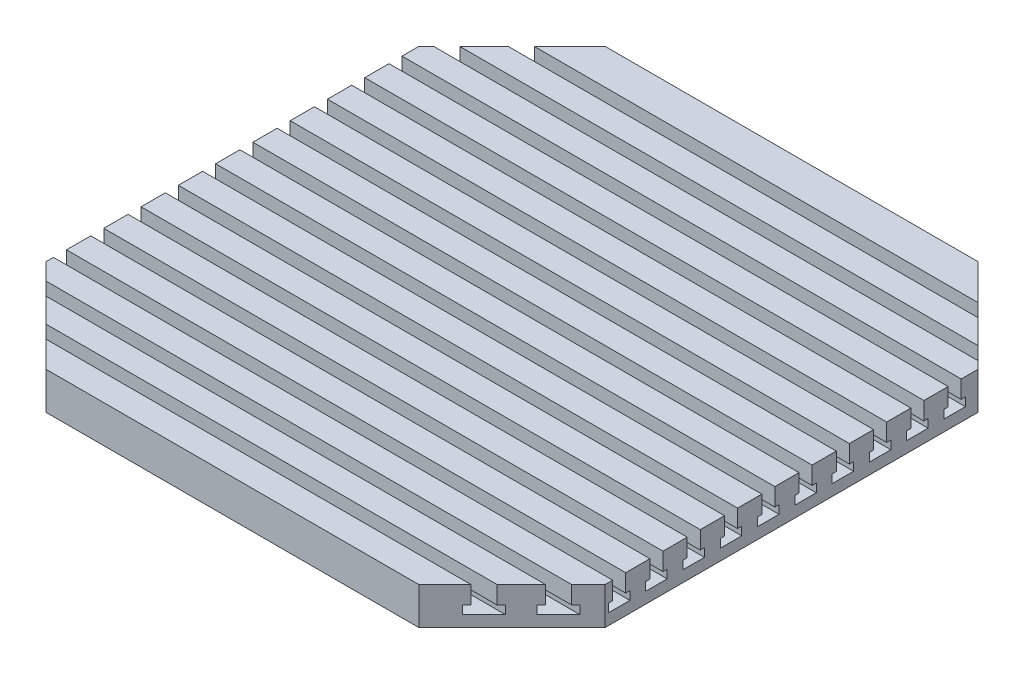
ISO-10303-21;
HEADER;
FILE_DESCRIPTION(('STEP AP214'),'2;1');
FILE_NAME('part.step','',(''),(''),'','','');
FILE_SCHEMA(('AUTOMOTIVE_DESIGN { 1 0 10303 214 1 1 1 1 }'));
ENDSEC;
DATA;
#1=APPLICATION_CONTEXT('core data for automotive mechanical design processes');
#2=APPLICATION_PROTOCOL_DEFINITION('international standard','automotive_design',2000,#1);
#3=PRODUCT_CONTEXT('',#1,'mechanical');
#4=PRODUCT('Part','Part','',(#3));
#5=PRODUCT_RELATED_PRODUCT_CATEGORY('part','',(#4));
#6=PRODUCT_DEFINITION_FORMATION('','',#4);
#7=PRODUCT_DEFINITION_CONTEXT('part definition',#1,'design');
#8=PRODUCT_DEFINITION('design','',#6,#7);
#9=PRODUCT_DEFINITION_SHAPE('','',#8);
#10=(LENGTH_UNIT() NAMED_UNIT(*) SI_UNIT(.MILLI.,.METRE.));
#11=(NAMED_UNIT(*) PLANE_ANGLE_UNIT() SI_UNIT($,.RADIAN.));
#12=(NAMED_UNIT(*) SI_UNIT($,.STERADIAN.) SOLID_ANGLE_UNIT());
#13=UNCERTAINTY_MEASURE_WITH_UNIT(LENGTH_MEASURE(1.E-05),#10,'distance_accuracy_value','');
#14=(GEOMETRIC_REPRESENTATION_CONTEXT(3) GLOBAL_UNCERTAINTY_ASSIGNED_CONTEXT((#13)) GLOBAL_UNIT_ASSIGNED_CONTEXT((#10,
#11,#12)) REPRESENTATION_CONTEXT('',''));
#15=CARTESIAN_POINT('',(0.,0.,0.));
#16=DIRECTION('',(0.,0.,1.));
#17=DIRECTION('',(1.,0.,0.));
#18=AXIS2_PLACEMENT_3D('',#15,#16,#17);
#19=CARTESIAN_POINT('',(-220.,40.,-300.));
#20=DIRECTION('',(0.,-1.,0.));
#21=DIRECTION('',(0.,0.,-1.));
#22=AXIS2_PLACEMENT_3D('',#19,#20,#21);
#23=PLANE('',#22);
#24=DIRECTION('',(1.,0.,0.));
#25=VECTOR('',#24,1.);
#26=CARTESIAN_POINT('',(-220.,40.,-262.));
#27=LINE('',#26,#25);
#28=CARTESIAN_POINT('',(-158.,40.,-262.));
#29=VERTEX_POINT('',#28);
#30=CARTESIAN_POINT('',(318.,40.,-262.));
#31=VERTEX_POINT('',#30);
#32=EDGE_CURVE('E1660',#29,#31,#27,.T.);
#33=ORIENTED_EDGE('',*,*,#32,.T.);
#34=DIRECTION('',(0.707106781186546,0.,0.707106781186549));
#35=VECTOR('',#34,1.);
#36=CARTESIAN_POINT('',(280.,40.,-300.));
#37=LINE('',#36,#35);
#38=CARTESIAN_POINT('',(280.,40.,-300.));
#39=VERTEX_POINT('',#38);
#40=EDGE_CURVE('E945',#31,#39,#37,.F.);
#41=ORIENTED_EDGE('',*,*,#40,.T.);
#42=DIRECTION('',(-1.,0.,0.));
#43=VECTOR('',#42,1.);
#44=CARTESIAN_POINT('',(-220.,40.,-300.));
#45=LINE('',#44,#43);
#46=CARTESIAN_POINT('',(-120.,40.,-300.));
#47=VERTEX_POINT('',#46);
#48=EDGE_CURVE('E844',#39,#47,#45,.T.);
#49=ORIENTED_EDGE('',*,*,#48,.T.);
#50=DIRECTION('',(0.707106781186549,0.,-0.707106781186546));
#51=VECTOR('',#50,1.);
#52=CARTESIAN_POINT('',(-220.,40.,-200.));
#53=LINE('',#52,#51);
#54=EDGE_CURVE('E943',#47,#29,#53,.F.);
#55=ORIENTED_EDGE('',*,*,#54,.T.);
#56=EDGE_LOOP('',(#33,#41,#49,#55));
#57=FACE_BOUND('',#56,.T.);
#58=ADVANCED_FACE('F63',(#57),#23,.F.);
#59=DIRECTION('',(1.,0.,0.));
#60=VECTOR('',#59,1.);
#61=CARTESIAN_POINT('',(-220.,40.,-222.));
#62=LINE('',#61,#60);
#63=CARTESIAN_POINT('',(-198.,40.,-222.));
#64=VERTEX_POINT('',#63);
#65=CARTESIAN_POINT('',(358.,40.,-222.));
#66=VERTEX_POINT('',#65);
#67=EDGE_CURVE('E1640',#64,#66,#62,.T.);
#68=ORIENTED_EDGE('',*,*,#67,.T.);
#69=DIRECTION('',(0.707106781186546,0.,0.707106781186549));
#70=VECTOR('',#69,1.);
#71=CARTESIAN_POINT('',(280.,40.,-300.));
#72=LINE('',#71,#70);
#73=CARTESIAN_POINT('',(332.,40.,-248.));
#74=VERTEX_POINT('',#73);
#75=EDGE_CURVE('E913',#66,#74,#72,.F.);
#76=ORIENTED_EDGE('',*,*,#75,.T.);
#77=DIRECTION('',(1.,0.,0.));
#78=VECTOR('',#77,1.);
#79=CARTESIAN_POINT('',(-220.,40.,-248.));
#80=LINE('',#79,#78);
#81=CARTESIAN_POINT('',(-172.,40.,-248.));
#82=VERTEX_POINT('',#81);
#83=EDGE_CURVE('E1680',#82,#74,#80,.T.);
#84=ORIENTED_EDGE('',*,*,#83,.F.);
#85=DIRECTION('',(0.707106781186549,0.,-0.707106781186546));
#86=VECTOR('',#85,1.);
#87=CARTESIAN_POINT('',(-220.,40.,-200.));
#88=LINE('',#87,#86);
#89=EDGE_CURVE('E911',#82,#64,#88,.F.);
#90=ORIENTED_EDGE('',*,*,#89,.T.);
#91=EDGE_LOOP('',(#68,#76,#84,#90));
#92=FACE_BOUND('',#91,.T.);
#93=ADVANCED_FACE('F1849',(#92),#23,.F.);
#94=DIRECTION('',(0.,0.,-1.));
#95=VECTOR('',#94,1.);
#96=CARTESIAN_POINT('',(380.,40.,300.));
#97=LINE('',#96,#95);
#98=CARTESIAN_POINT('',(380.,40.,-182.));
#99=VERTEX_POINT('',#98);
#100=CARTESIAN_POINT('',(380.,40.,-200.));
#101=VERTEX_POINT('',#100);
#102=EDGE_CURVE('E841',#99,#101,#97,.T.);
#103=ORIENTED_EDGE('',*,*,#102,.T.);
#104=DIRECTION('',(0.707106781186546,0.,0.707106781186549));
#105=VECTOR('',#104,1.);
#106=CARTESIAN_POINT('',(280.,40.,-300.));
#107=LINE('',#106,#105);
#108=CARTESIAN_POINT('',(372.,40.,-208.));
#109=VERTEX_POINT('',#108);
#110=EDGE_CURVE('E881',#101,#109,#107,.F.);
#111=ORIENTED_EDGE('',*,*,#110,.T.);
#112=DIRECTION('',(1.,0.,0.));
#113=VECTOR('',#112,1.);
#114=CARTESIAN_POINT('',(-220.,40.,-208.));
#115=LINE('',#114,#113);
#116=CARTESIAN_POINT('',(-212.,40.,-208.));
#117=VERTEX_POINT('',#116);
#118=EDGE_CURVE('E1656',#117,#109,#115,.T.);
#119=ORIENTED_EDGE('',*,*,#118,.F.);
#120=DIRECTION('',(0.707106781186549,0.,-0.707106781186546));
#121=VECTOR('',#120,1.);
#122=CARTESIAN_POINT('',(-220.,40.,-200.));
#123=LINE('',#122,#121);
#124=CARTESIAN_POINT('',(-220.,40.,-200.));
#125=VERTEX_POINT('',#124);
#126=EDGE_CURVE('E879',#117,#125,#123,.F.);
#127=ORIENTED_EDGE('',*,*,#126,.T.);
#128=DIRECTION('',(0.,0.,1.));
#129=VECTOR('',#128,1.);
#130=CARTESIAN_POINT('',(-220.,40.,300.));
#131=LINE('',#130,#129);
#132=CARTESIAN_POINT('',(-220.,40.,-182.));
#133=VERTEX_POINT('',#132);
#134=EDGE_CURVE('E829',#125,#133,#131,.T.);
#135=ORIENTED_EDGE('',*,*,#134,.T.);
#136=DIRECTION('',(1.,0.,0.));
#137=VECTOR('',#136,1.);
#138=CARTESIAN_POINT('',(-220.,40.,-182.));
#139=LINE('',#138,#137);
#140=EDGE_CURVE('E1591',#133,#99,#139,.T.);
#141=ORIENTED_EDGE('',*,*,#140,.T.);
#142=EDGE_LOOP('',(#103,#111,#119,#127,#135,#141));
#143=FACE_BOUND('',#142,.T.);
#144=ADVANCED_FACE('F1733',(#143),#23,.F.);
#145=CARTESIAN_POINT('',(380.,40.,-142.));
#146=VERTEX_POINT('',#145);
#147=CARTESIAN_POINT('',(380.,40.,-168.));
#148=VERTEX_POINT('',#147);
#149=EDGE_CURVE('E820',#146,#148,#97,.T.);
#150=ORIENTED_EDGE('',*,*,#149,.T.);
#151=DIRECTION('',(1.,0.,0.));
#152=VECTOR('',#151,1.);
#153=CARTESIAN_POINT('',(-220.,40.,-168.));
#154=LINE('',#153,#152);
#155=CARTESIAN_POINT('',(-220.,40.,-168.));
#156=VERTEX_POINT('',#155);
#157=EDGE_CURVE('E803',#156,#148,#154,.T.);
#158=ORIENTED_EDGE('',*,*,#157,.F.);
#159=CARTESIAN_POINT('',(-220.,40.,-142.));
#160=VERTEX_POINT('',#159);
#161=EDGE_CURVE('E817',#156,#160,#131,.T.);
#162=ORIENTED_EDGE('',*,*,#161,.T.);
#163=DIRECTION('',(1.,0.,0.));
#164=VECTOR('',#163,1.);
#165=CARTESIAN_POINT('',(-220.,40.,-142.));
#166=LINE('',#165,#164);
#167=EDGE_CURVE('E1535',#160,#146,#166,.T.);
#168=ORIENTED_EDGE('',*,*,#167,.T.);
#169=EDGE_LOOP('',(#150,#158,#162,#168));
#170=FACE_BOUND('',#169,.T.);
#171=ADVANCED_FACE('F815',(#170),#23,.F.);
#172=CARTESIAN_POINT('',(380.,40.,-102.));
#173=VERTEX_POINT('',#172);
#174=CARTESIAN_POINT('',(380.,40.,-128.));
#175=VERTEX_POINT('',#174);
#176=EDGE_CURVE('E1743',#173,#175,#97,.T.);
#177=ORIENTED_EDGE('',*,*,#176,.T.);
#178=DIRECTION('',(1.,0.,0.));
#179=VECTOR('',#178,1.);
#180=CARTESIAN_POINT('',(-220.,40.,-128.));
#181=LINE('',#180,#179);
#182=CARTESIAN_POINT('',(-220.,40.,-128.));
#183=VERTEX_POINT('',#182);
#184=EDGE_CURVE('E1555',#183,#175,#181,.T.);
#185=ORIENTED_EDGE('',*,*,#184,.F.);
#186=CARTESIAN_POINT('',(-220.,40.,-102.));
#187=VERTEX_POINT('',#186);
#188=EDGE_CURVE('E830',#183,#187,#131,.T.);
#189=ORIENTED_EDGE('',*,*,#188,.T.);
#190=DIRECTION('',(1.,0.,0.));
#191=VECTOR('',#190,1.);
#192=CARTESIAN_POINT('',(-220.,40.,-102.));
#193=LINE('',#192,#191);
#194=EDGE_CURVE('E1477',#187,#173,#193,.T.);
#195=ORIENTED_EDGE('',*,*,#194,.T.);
#196=EDGE_LOOP('',(#177,#185,#189,#195));
#197=FACE_BOUND('',#196,.T.);
#198=ADVANCED_FACE('F2843',(#197),#23,.F.);
#199=CARTESIAN_POINT('',(380.,40.,-62.0000000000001));
#200=VERTEX_POINT('',#199);
#201=CARTESIAN_POINT('',(380.,40.,-88.));
#202=VERTEX_POINT('',#201);
#203=EDGE_CURVE('E1745',#200,#202,#97,.T.);
#204=ORIENTED_EDGE('',*,*,#203,.T.);
#205=DIRECTION('',(1.,0.,0.));
#206=VECTOR('',#205,1.);
#207=CARTESIAN_POINT('',(-220.,40.,-88.));
#208=LINE('',#207,#206);
#209=CARTESIAN_POINT('',(-220.,40.,-88.));
#210=VERTEX_POINT('',#209);
#211=EDGE_CURVE('E1497',#210,#202,#208,.T.);
#212=ORIENTED_EDGE('',*,*,#211,.F.);
#213=CARTESIAN_POINT('',(-220.,40.,-62.0000000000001));
#214=VERTEX_POINT('',#213);
#215=EDGE_CURVE('E834',#210,#214,#131,.T.);
#216=ORIENTED_EDGE('',*,*,#215,.T.);
#217=DIRECTION('',(1.,0.,0.));
#218=VECTOR('',#217,1.);
#219=CARTESIAN_POINT('',(-220.,40.,-62.0000000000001));
#220=LINE('',#219,#218);
#221=EDGE_CURVE('E1419',#214,#200,#220,.T.);
#222=ORIENTED_EDGE('',*,*,#221,.T.);
#223=EDGE_LOOP('',(#204,#212,#216,#222));
#224=FACE_BOUND('',#223,.T.);
#225=ADVANCED_FACE('F2850',(#224),#23,.F.);
#226=CARTESIAN_POINT('',(380.,40.,-22.0000000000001));
#227=VERTEX_POINT('',#226);
#228=CARTESIAN_POINT('',(380.,40.,-48.));
#229=VERTEX_POINT('',#228);
#230=EDGE_CURVE('E1750',#227,#229,#97,.T.);
#231=ORIENTED_EDGE('',*,*,#230,.T.);
#232=DIRECTION('',(1.,0.,0.));
#233=VECTOR('',#232,1.);
#234=CARTESIAN_POINT('',(-220.,40.,-48.));
#235=LINE('',#234,#233);
#236=CARTESIAN_POINT('',(-220.,40.,-48.));
#237=VERTEX_POINT('',#236);
#238=EDGE_CURVE('E1439',#237,#229,#235,.T.);
#239=ORIENTED_EDGE('',*,*,#238,.F.);
#240=CARTESIAN_POINT('',(-220.,40.,-22.0000000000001));
#241=VERTEX_POINT('',#240);
#242=EDGE_CURVE('E3083',#237,#241,#131,.T.);
#243=ORIENTED_EDGE('',*,*,#242,.T.);
#244=DIRECTION('',(1.,0.,0.));
#245=VECTOR('',#244,1.);
#246=CARTESIAN_POINT('',(-220.,40.,-22.0000000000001));
#247=LINE('',#246,#245);
#248=EDGE_CURVE('E1361',#241,#227,#247,.T.);
#249=ORIENTED_EDGE('',*,*,#248,.T.);
#250=EDGE_LOOP('',(#231,#239,#243,#249));
#251=FACE_BOUND('',#250,.T.);
#252=ADVANCED_FACE('F2857',(#251),#23,.F.);
#253=CARTESIAN_POINT('',(380.,40.,18.));
#254=VERTEX_POINT('',#253);
#255=CARTESIAN_POINT('',(380.,40.,-8.00000000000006));
#256=VERTEX_POINT('',#255);
#257=EDGE_CURVE('E1755',#254,#256,#97,.T.);
#258=ORIENTED_EDGE('',*,*,#257,.T.);
#259=DIRECTION('',(1.,0.,0.));
#260=VECTOR('',#259,1.);
#261=CARTESIAN_POINT('',(-220.,40.,-8.00000000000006));
#262=LINE('',#261,#260);
#263=CARTESIAN_POINT('',(-220.,40.,-8.00000000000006));
#264=VERTEX_POINT('',#263);
#265=EDGE_CURVE('E1381',#264,#256,#262,.T.);
#266=ORIENTED_EDGE('',*,*,#265,.F.);
#267=CARTESIAN_POINT('',(-220.,40.,18.));
#268=VERTEX_POINT('',#267);
#269=EDGE_CURVE('E3084',#264,#268,#131,.T.);
#270=ORIENTED_EDGE('',*,*,#269,.T.);
#271=DIRECTION('',(1.,0.,0.));
#272=VECTOR('',#271,1.);
#273=CARTESIAN_POINT('',(-220.,40.,18.));
#274=LINE('',#273,#272);
#275=EDGE_CURVE('E1303',#268,#254,#274,.T.);
#276=ORIENTED_EDGE('',*,*,#275,.T.);
#277=EDGE_LOOP('',(#258,#266,#270,#276));
#278=FACE_BOUND('',#277,.T.);
#279=ADVANCED_FACE('F2864',(#278),#23,.F.);
#280=CARTESIAN_POINT('',(380.,40.,57.9999999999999));
#281=VERTEX_POINT('',#280);
#282=CARTESIAN_POINT('',(380.,40.,32.));
#283=VERTEX_POINT('',#282);
#284=EDGE_CURVE('E1760',#281,#283,#97,.T.);
#285=ORIENTED_EDGE('',*,*,#284,.T.);
#286=DIRECTION('',(1.,0.,0.));
#287=VECTOR('',#286,1.);
#288=CARTESIAN_POINT('',(-220.,40.,32.));
#289=LINE('',#288,#287);
#290=CARTESIAN_POINT('',(-220.,40.,32.));
#291=VERTEX_POINT('',#290);
#292=EDGE_CURVE('E1323',#291,#283,#289,.T.);
#293=ORIENTED_EDGE('',*,*,#292,.F.);
#294=CARTESIAN_POINT('',(-220.,40.,57.9999999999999));
#295=VERTEX_POINT('',#294);
#296=EDGE_CURVE('E3087',#291,#295,#131,.T.);
#297=ORIENTED_EDGE('',*,*,#296,.T.);
#298=DIRECTION('',(1.,0.,0.));
#299=VECTOR('',#298,1.);
#300=CARTESIAN_POINT('',(-220.,40.,57.9999999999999));
#301=LINE('',#300,#299);
#302=EDGE_CURVE('E1245',#295,#281,#301,.T.);
#303=ORIENTED_EDGE('',*,*,#302,.T.);
#304=EDGE_LOOP('',(#285,#293,#297,#303));
#305=FACE_BOUND('',#304,.T.);
#306=ADVANCED_FACE('F2871',(#305),#23,.F.);
#307=CARTESIAN_POINT('',(380.,40.,97.9999999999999));
#308=VERTEX_POINT('',#307);
#309=CARTESIAN_POINT('',(380.,40.,72.));
#310=VERTEX_POINT('',#309);
#311=EDGE_CURVE('E1765',#308,#310,#97,.T.);
#312=ORIENTED_EDGE('',*,*,#311,.T.);
#313=DIRECTION('',(1.,0.,0.));
#314=VECTOR('',#313,1.);
#315=CARTESIAN_POINT('',(-220.,40.,72.));
#316=LINE('',#315,#314);
#317=CARTESIAN_POINT('',(-220.,40.,72.));
#318=VERTEX_POINT('',#317);
#319=EDGE_CURVE('E1265',#318,#310,#316,.T.);
#320=ORIENTED_EDGE('',*,*,#319,.F.);
#321=CARTESIAN_POINT('',(-220.,40.,97.9999999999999));
#322=VERTEX_POINT('',#321);
#323=EDGE_CURVE('E1796',#318,#322,#131,.T.);
#324=ORIENTED_EDGE('',*,*,#323,.T.);
#325=DIRECTION('',(1.,0.,0.));
#326=VECTOR('',#325,1.);
#327=CARTESIAN_POINT('',(-220.,40.,97.9999999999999));
#328=LINE('',#327,#326);
#329=EDGE_CURVE('E1187',#322,#308,#328,.T.);
#330=ORIENTED_EDGE('',*,*,#329,.T.);
#331=EDGE_LOOP('',(#312,#320,#324,#330));
#332=FACE_BOUND('',#331,.T.);
#333=ADVANCED_FACE('F2878',(#332),#23,.F.);
#334=CARTESIAN_POINT('',(380.,40.,138.));
#335=VERTEX_POINT('',#334);
#336=CARTESIAN_POINT('',(380.,40.,112.));
#337=VERTEX_POINT('',#336);
#338=EDGE_CURVE('E1770',#335,#337,#97,.T.);
#339=ORIENTED_EDGE('',*,*,#338,.T.);
#340=DIRECTION('',(1.,0.,0.));
#341=VECTOR('',#340,1.);
#342=CARTESIAN_POINT('',(-220.,40.,112.));
#343=LINE('',#342,#341);
#344=CARTESIAN_POINT('',(-220.,40.,112.));
#345=VERTEX_POINT('',#344);
#346=EDGE_CURVE('E1207',#345,#337,#343,.T.);
#347=ORIENTED_EDGE('',*,*,#346,.F.);
#348=CARTESIAN_POINT('',(-220.,40.,138.));
#349=VERTEX_POINT('',#348);
#350=EDGE_CURVE('E1795',#345,#349,#131,.T.);
#351=ORIENTED_EDGE('',*,*,#350,.T.);
#352=DIRECTION('',(1.,0.,0.));
#353=VECTOR('',#352,1.);
#354=CARTESIAN_POINT('',(-220.,40.,138.));
#355=LINE('',#354,#353);
#356=EDGE_CURVE('E1129',#349,#335,#355,.T.);
#357=ORIENTED_EDGE('',*,*,#356,.T.);
#358=EDGE_LOOP('',(#339,#347,#351,#357));
#359=FACE_BOUND('',#358,.T.);
#360=ADVANCED_FACE('F2885',(#359),#23,.F.);
#361=CARTESIAN_POINT('',(380.,40.,178.));
#362=VERTEX_POINT('',#361);
#363=CARTESIAN_POINT('',(380.,40.,152.));
#364=VERTEX_POINT('',#363);
#365=EDGE_CURVE('E845',#362,#364,#97,.T.);
#366=ORIENTED_EDGE('',*,*,#365,.T.);
#367=DIRECTION('',(1.,0.,0.));
#368=VECTOR('',#367,1.);
#369=CARTESIAN_POINT('',(-220.,40.,152.));
#370=LINE('',#369,#368);
#371=CARTESIAN_POINT('',(-220.,40.,152.));
#372=VERTEX_POINT('',#371);
#373=EDGE_CURVE('E1149',#372,#364,#370,.T.);
#374=ORIENTED_EDGE('',*,*,#373,.F.);
#375=CARTESIAN_POINT('',(-220.,40.,178.));
#376=VERTEX_POINT('',#375);
#377=EDGE_CURVE('E1793',#372,#376,#131,.T.);
#378=ORIENTED_EDGE('',*,*,#377,.T.);
#379=DIRECTION('',(1.,0.,0.));
#380=VECTOR('',#379,1.);
#381=CARTESIAN_POINT('',(-220.,40.,178.));
#382=LINE('',#381,#380);
#383=EDGE_CURVE('E1061',#376,#362,#382,.T.);
#384=ORIENTED_EDGE('',*,*,#383,.T.);
#385=EDGE_LOOP('',(#366,#374,#378,#384));
#386=FACE_BOUND('',#385,.T.);
#387=ADVANCED_FACE('F1782',(#386),#23,.F.);
#388=DIRECTION('',(1.,0.,0.));
#389=VECTOR('',#388,1.);
#390=CARTESIAN_POINT('',(-220.,40.,218.));
#391=LINE('',#390,#389);
#392=CARTESIAN_POINT('',(-202.,40.,218.));
#393=VERTEX_POINT('',#392);
#394=CARTESIAN_POINT('',(362.,40.,218.));
#395=VERTEX_POINT('',#394);
#396=EDGE_CURVE('E1023',#393,#395,#391,.T.);
#397=ORIENTED_EDGE('',*,*,#396,.T.);
#398=DIRECTION('',(-0.707106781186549,0.,0.707106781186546));
#399=VECTOR('',#398,1.);
#400=CARTESIAN_POINT('',(380.,40.,200.));
#401=LINE('',#400,#399);
#402=CARTESIAN_POINT('',(380.,40.,200.));
#403=VERTEX_POINT('',#402);
#404=EDGE_CURVE('E12',#395,#403,#401,.F.);
#405=ORIENTED_EDGE('',*,*,#404,.T.);
#406=CARTESIAN_POINT('',(380.,40.,192.));
#407=VERTEX_POINT('',#406);
#408=EDGE_CURVE('E842',#403,#407,#97,.T.);
#409=ORIENTED_EDGE('',*,*,#408,.T.);
#410=DIRECTION('',(1.,0.,0.));
#411=VECTOR('',#410,1.);
#412=CARTESIAN_POINT('',(-220.,40.,192.));
#413=LINE('',#412,#411);
#414=CARTESIAN_POINT('',(-220.,40.,192.));
#415=VERTEX_POINT('',#414);
#416=EDGE_CURVE('E1090',#415,#407,#413,.T.);
#417=ORIENTED_EDGE('',*,*,#416,.F.);
#418=CARTESIAN_POINT('',(-220.,40.,199.999999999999));
#419=VERTEX_POINT('',#418);
#420=EDGE_CURVE('E833',#415,#419,#131,.T.);
#421=ORIENTED_EDGE('',*,*,#420,.T.);
#422=DIRECTION('',(-0.707106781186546,0.,-0.707106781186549));
#423=VECTOR('',#422,1.);
#424=CARTESIAN_POINT('',(-120.,40.,300.));
#425=LINE('',#424,#423);
#426=EDGE_CURVE('E71',#419,#393,#425,.F.);
#427=ORIENTED_EDGE('',*,*,#426,.T.);
#428=EDGE_LOOP('',(#397,#405,#409,#417,#421,#427));
#429=FACE_BOUND('',#428,.T.);
#430=ADVANCED_FACE('F1799',(#429),#23,.F.);
#431=DIRECTION('',(1.,0.,0.));
#432=VECTOR('',#431,1.);
#433=CARTESIAN_POINT('',(-220.,40.,258.));
#434=LINE('',#433,#432);
#435=CARTESIAN_POINT('',(-162.,40.,258.));
#436=VERTEX_POINT('',#435);
#437=CARTESIAN_POINT('',(322.,40.,258.));
#438=VERTEX_POINT('',#437);
#439=EDGE_CURVE('E853',#436,#438,#434,.T.);
#440=ORIENTED_EDGE('',*,*,#439,.T.);
#441=DIRECTION('',(-0.707106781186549,0.,0.707106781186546));
#442=VECTOR('',#441,1.);
#443=CARTESIAN_POINT('',(380.,40.,200.));
#444=LINE('',#443,#442);
#445=CARTESIAN_POINT('',(348.,40.,232.));
#446=VERTEX_POINT('',#445);
#447=EDGE_CURVE('E991',#438,#446,#444,.F.);
#448=ORIENTED_EDGE('',*,*,#447,.T.);
#449=DIRECTION('',(1.,0.,0.));
#450=VECTOR('',#449,1.);
#451=CARTESIAN_POINT('',(-220.,40.,232.));
#452=LINE('',#451,#450);
#453=CARTESIAN_POINT('',(-188.,40.,232.));
#454=VERTEX_POINT('',#453);
#455=EDGE_CURVE('E1058',#454,#446,#452,.T.);
#456=ORIENTED_EDGE('',*,*,#455,.F.);
#457=DIRECTION('',(-0.707106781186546,0.,-0.707106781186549));
#458=VECTOR('',#457,1.);
#459=CARTESIAN_POINT('',(-120.,40.,300.));
#460=LINE('',#459,#458);
#461=EDGE_CURVE('E989',#454,#436,#460,.F.);
#462=ORIENTED_EDGE('',*,*,#461,.T.);
#463=EDGE_LOOP('',(#440,#448,#456,#462));
#464=FACE_BOUND('',#463,.T.);
#465=ADVANCED_FACE('F1860',(#464),#23,.F.);
#466=CARTESIAN_POINT('',(-220.,40.,300.));
#467=DIRECTION('',(1.,0.,0.));
#468=DIRECTION('',(0.,0.,-1.));
#469=AXIS2_PLACEMENT_3D('',#466,#467,#468);
#470=PLANE('',#469);
#471=ORIENTED_EDGE('',*,*,#134,.F.);
#472=DIRECTION('',(0.,-1.,0.));
#473=VECTOR('',#472,1.);
#474=CARTESIAN_POINT('',(-220.,40.,-200.));
#475=LINE('',#474,#473);
#476=CARTESIAN_POINT('',(-220.,0.,-200.));
#477=VERTEX_POINT('',#476);
#478=EDGE_CURVE('E949',#125,#477,#475,.T.);
#479=ORIENTED_EDGE('',*,*,#478,.T.);
#480=DIRECTION('',(0.,0.,1.));
#481=VECTOR('',#480,1.);
#482=CARTESIAN_POINT('',(-220.,0.,300.));
#483=LINE('',#482,#481);
#484=CARTESIAN_POINT('',(-220.,0.,199.999999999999));
#485=VERTEX_POINT('',#484);
#486=EDGE_CURVE('E849',#477,#485,#483,.T.);
#487=ORIENTED_EDGE('',*,*,#486,.T.);
#488=DIRECTION('',(0.,1.,0.));
#489=VECTOR('',#488,1.);
#490=CARTESIAN_POINT('',(-220.,40.,199.999999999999));
#491=LINE('',#490,#489);
#492=EDGE_CURVE('E947',#485,#419,#491,.T.);
#493=ORIENTED_EDGE('',*,*,#492,.T.);
#494=ORIENTED_EDGE('',*,*,#420,.F.);
#495=DIRECTION('',(0.,-1.,0.));
#496=VECTOR('',#495,1.);
#497=CARTESIAN_POINT('',(-220.,40.,192.));
#498=LINE('',#497,#496);
#499=CARTESIAN_POINT('',(-220.,21.,192.));
#500=VERTEX_POINT('',#499);
#501=EDGE_CURVE('E1110',#415,#500,#498,.T.);
#502=ORIENTED_EDGE('',*,*,#501,.T.);
#503=DIRECTION('',(0.,0.,1.));
#504=VECTOR('',#503,1.);
#505=CARTESIAN_POINT('',(-220.,21.,192.));
#506=LINE('',#505,#504);
#507=CARTESIAN_POINT('',(-220.,21.,196.5));
#508=VERTEX_POINT('',#507);
#509=EDGE_CURVE('E1144',#500,#508,#506,.T.);
#510=ORIENTED_EDGE('',*,*,#509,.T.);
#511=DIRECTION('',(0.,-1.,0.));
#512=VECTOR('',#511,1.);
#513=CARTESIAN_POINT('',(-220.,21.,196.5));
#514=LINE('',#513,#512);
#515=CARTESIAN_POINT('',(-220.,12.,196.5));
#516=VERTEX_POINT('',#515);
#517=EDGE_CURVE('E1141',#508,#516,#514,.T.);
#518=ORIENTED_EDGE('',*,*,#517,.T.);
#519=DIRECTION('',(0.,0.,-1.));
#520=VECTOR('',#519,1.);
#521=CARTESIAN_POINT('',(-220.,12.,196.5));
#522=LINE('',#521,#520);
#523=CARTESIAN_POINT('',(-220.,12.,173.5));
#524=VERTEX_POINT('',#523);
#525=EDGE_CURVE('E1138',#516,#524,#522,.T.);
#526=ORIENTED_EDGE('',*,*,#525,.T.);
#527=DIRECTION('',(0.,1.,0.));
#528=VECTOR('',#527,1.);
#529=CARTESIAN_POINT('',(-220.,12.,173.5));
#530=LINE('',#529,#528);
#531=CARTESIAN_POINT('',(-220.,21.,173.5));
#532=VERTEX_POINT('',#531);
#533=EDGE_CURVE('E1135',#524,#532,#530,.T.);
#534=ORIENTED_EDGE('',*,*,#533,.T.);
#535=DIRECTION('',(0.,0.,1.));
#536=VECTOR('',#535,1.);
#537=CARTESIAN_POINT('',(-220.,21.,173.5));
#538=LINE('',#537,#536);
#539=CARTESIAN_POINT('',(-220.,21.,178.));
#540=VERTEX_POINT('',#539);
#541=EDGE_CURVE('E1132',#532,#540,#538,.T.);
#542=ORIENTED_EDGE('',*,*,#541,.T.);
#543=DIRECTION('',(0.,1.,0.));
#544=VECTOR('',#543,1.);
#545=CARTESIAN_POINT('',(-220.,21.,178.));
#546=LINE('',#545,#544);
#547=EDGE_CURVE('E1094',#540,#376,#546,.T.);
#548=ORIENTED_EDGE('',*,*,#547,.T.);
#549=ORIENTED_EDGE('',*,*,#377,.F.);
#550=DIRECTION('',(0.,-1.,0.));
#551=VECTOR('',#550,1.);
#552=CARTESIAN_POINT('',(-220.,40.,152.));
#553=LINE('',#552,#551);
#554=CARTESIAN_POINT('',(-220.,21.,152.));
#555=VERTEX_POINT('',#554);
#556=EDGE_CURVE('E1168',#372,#555,#553,.T.);
#557=ORIENTED_EDGE('',*,*,#556,.T.);
#558=DIRECTION('',(0.,0.,1.));
#559=VECTOR('',#558,1.);
#560=CARTESIAN_POINT('',(-220.,21.,152.));
#561=LINE('',#560,#559);
#562=CARTESIAN_POINT('',(-220.,21.,156.5));
#563=VERTEX_POINT('',#562);
#564=EDGE_CURVE('E1202',#555,#563,#561,.T.);
#565=ORIENTED_EDGE('',*,*,#564,.T.);
#566=DIRECTION('',(0.,-1.,0.));
#567=VECTOR('',#566,1.);
#568=CARTESIAN_POINT('',(-220.,21.,156.5));
#569=LINE('',#568,#567);
#570=CARTESIAN_POINT('',(-220.,12.,156.5));
#571=VERTEX_POINT('',#570);
#572=EDGE_CURVE('E1199',#563,#571,#569,.T.);
#573=ORIENTED_EDGE('',*,*,#572,.T.);
#574=DIRECTION('',(0.,0.,-1.));
#575=VECTOR('',#574,1.);
#576=CARTESIAN_POINT('',(-220.,12.,156.5));
#577=LINE('',#576,#575);
#578=CARTESIAN_POINT('',(-220.,12.,133.5));
#579=VERTEX_POINT('',#578);
#580=EDGE_CURVE('E1196',#571,#579,#577,.T.);
#581=ORIENTED_EDGE('',*,*,#580,.T.);
#582=DIRECTION('',(0.,1.,0.));
#583=VECTOR('',#582,1.);
#584=CARTESIAN_POINT('',(-220.,12.,133.5));
#585=LINE('',#584,#583);
#586=CARTESIAN_POINT('',(-220.,21.,133.5));
#587=VERTEX_POINT('',#586);
#588=EDGE_CURVE('E1193',#579,#587,#585,.T.);
#589=ORIENTED_EDGE('',*,*,#588,.T.);
#590=DIRECTION('',(0.,0.,1.));
#591=VECTOR('',#590,1.);
#592=CARTESIAN_POINT('',(-220.,21.,133.5));
#593=LINE('',#592,#591);
#594=CARTESIAN_POINT('',(-220.,21.,138.));
#595=VERTEX_POINT('',#594);
#596=EDGE_CURVE('E1190',#587,#595,#593,.T.);
#597=ORIENTED_EDGE('',*,*,#596,.T.);
#598=DIRECTION('',(0.,1.,0.));
#599=VECTOR('',#598,1.);
#600=CARTESIAN_POINT('',(-220.,21.,138.));
#601=LINE('',#600,#599);
#602=EDGE_CURVE('E1152',#595,#349,#601,.T.);
#603=ORIENTED_EDGE('',*,*,#602,.T.);
#604=ORIENTED_EDGE('',*,*,#350,.F.);
#605=DIRECTION('',(0.,-1.,0.));
#606=VECTOR('',#605,1.);
#607=CARTESIAN_POINT('',(-220.,40.,112.));
#608=LINE('',#607,#606);
#609=CARTESIAN_POINT('',(-220.,21.,112.));
#610=VERTEX_POINT('',#609);
#611=EDGE_CURVE('E1226',#345,#610,#608,.T.);
#612=ORIENTED_EDGE('',*,*,#611,.T.);
#613=DIRECTION('',(0.,0.,1.));
#614=VECTOR('',#613,1.);
#615=CARTESIAN_POINT('',(-220.,21.,112.));
#616=LINE('',#615,#614);
#617=CARTESIAN_POINT('',(-220.,21.,116.5));
#618=VERTEX_POINT('',#617);
#619=EDGE_CURVE('E1260',#610,#618,#616,.T.);
#620=ORIENTED_EDGE('',*,*,#619,.T.);
#621=DIRECTION('',(0.,-1.,0.));
#622=VECTOR('',#621,1.);
#623=CARTESIAN_POINT('',(-220.,21.,116.5));
#624=LINE('',#623,#622);
#625=CARTESIAN_POINT('',(-220.,12.,116.5));
#626=VERTEX_POINT('',#625);
#627=EDGE_CURVE('E1257',#618,#626,#624,.T.);
#628=ORIENTED_EDGE('',*,*,#627,.T.);
#629=DIRECTION('',(0.,0.,-1.));
#630=VECTOR('',#629,1.);
#631=CARTESIAN_POINT('',(-220.,12.,116.5));
#632=LINE('',#631,#630);
#633=CARTESIAN_POINT('',(-220.,12.,93.4999999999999));
#634=VERTEX_POINT('',#633);
#635=EDGE_CURVE('E1254',#626,#634,#632,.T.);
#636=ORIENTED_EDGE('',*,*,#635,.T.);
#637=DIRECTION('',(0.,1.,0.));
#638=VECTOR('',#637,1.);
#639=CARTESIAN_POINT('',(-220.,12.,93.4999999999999));
#640=LINE('',#639,#638);
#641=CARTESIAN_POINT('',(-220.,21.,93.4999999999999));
#642=VERTEX_POINT('',#641);
#643=EDGE_CURVE('E1251',#634,#642,#640,.T.);
#644=ORIENTED_EDGE('',*,*,#643,.T.);
#645=DIRECTION('',(0.,0.,1.));
#646=VECTOR('',#645,1.);
#647=CARTESIAN_POINT('',(-220.,21.,93.4999999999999));
#648=LINE('',#647,#646);
#649=CARTESIAN_POINT('',(-220.,21.,97.9999999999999));
#650=VERTEX_POINT('',#649);
#651=EDGE_CURVE('E1248',#642,#650,#648,.T.);
#652=ORIENTED_EDGE('',*,*,#651,.T.);
#653=DIRECTION('',(0.,1.,0.));
#654=VECTOR('',#653,1.);
#655=CARTESIAN_POINT('',(-220.,21.,97.9999999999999));
#656=LINE('',#655,#654);
#657=EDGE_CURVE('E1210',#650,#322,#656,.T.);
#658=ORIENTED_EDGE('',*,*,#657,.T.);
#659=ORIENTED_EDGE('',*,*,#323,.F.);
#660=DIRECTION('',(0.,-1.,0.));
#661=VECTOR('',#660,1.);
#662=CARTESIAN_POINT('',(-220.,40.,72.));
#663=LINE('',#662,#661);
#664=CARTESIAN_POINT('',(-220.,21.,72.));
#665=VERTEX_POINT('',#664);
#666=EDGE_CURVE('E1284',#318,#665,#663,.T.);
#667=ORIENTED_EDGE('',*,*,#666,.T.);
#668=DIRECTION('',(0.,0.,1.));
#669=VECTOR('',#668,1.);
#670=CARTESIAN_POINT('',(-220.,21.,72.));
#671=LINE('',#670,#669);
#672=CARTESIAN_POINT('',(-220.,21.,76.5));
#673=VERTEX_POINT('',#672);
#674=EDGE_CURVE('E1318',#665,#673,#671,.T.);
#675=ORIENTED_EDGE('',*,*,#674,.T.);
#676=DIRECTION('',(0.,-1.,0.));
#677=VECTOR('',#676,1.);
#678=CARTESIAN_POINT('',(-220.,21.,76.5));
#679=LINE('',#678,#677);
#680=CARTESIAN_POINT('',(-220.,12.,76.5));
#681=VERTEX_POINT('',#680);
#682=EDGE_CURVE('E1315',#673,#681,#679,.T.);
#683=ORIENTED_EDGE('',*,*,#682,.T.);
#684=DIRECTION('',(0.,0.,-1.));
#685=VECTOR('',#684,1.);
#686=CARTESIAN_POINT('',(-220.,12.,76.5));
#687=LINE('',#686,#685);
#688=CARTESIAN_POINT('',(-220.,12.,53.4999999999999));
#689=VERTEX_POINT('',#688);
#690=EDGE_CURVE('E1312',#681,#689,#687,.T.);
#691=ORIENTED_EDGE('',*,*,#690,.T.);
#692=DIRECTION('',(0.,1.,0.));
#693=VECTOR('',#692,1.);
#694=CARTESIAN_POINT('',(-220.,12.,53.4999999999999));
#695=LINE('',#694,#693);
#696=CARTESIAN_POINT('',(-220.,21.,53.4999999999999));
#697=VERTEX_POINT('',#696);
#698=EDGE_CURVE('E1309',#689,#697,#695,.T.);
#699=ORIENTED_EDGE('',*,*,#698,.T.);
#700=DIRECTION('',(0.,0.,1.));
#701=VECTOR('',#700,1.);
#702=CARTESIAN_POINT('',(-220.,21.,53.4999999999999));
#703=LINE('',#702,#701);
#704=CARTESIAN_POINT('',(-220.,21.,57.9999999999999));
#705=VERTEX_POINT('',#704);
#706=EDGE_CURVE('E1306',#697,#705,#703,.T.);
#707=ORIENTED_EDGE('',*,*,#706,.T.);
#708=DIRECTION('',(0.,1.,0.));
#709=VECTOR('',#708,1.);
#710=CARTESIAN_POINT('',(-220.,21.,57.9999999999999));
#711=LINE('',#710,#709);
#712=EDGE_CURVE('E1268',#705,#295,#711,.T.);
#713=ORIENTED_EDGE('',*,*,#712,.T.);
#714=ORIENTED_EDGE('',*,*,#296,.F.);
#715=DIRECTION('',(0.,-1.,0.));
#716=VECTOR('',#715,1.);
#717=CARTESIAN_POINT('',(-220.,40.,32.));
#718=LINE('',#717,#716);
#719=CARTESIAN_POINT('',(-220.,21.,32.));
#720=VERTEX_POINT('',#719);
#721=EDGE_CURVE('E1342',#291,#720,#718,.T.);
#722=ORIENTED_EDGE('',*,*,#721,.T.);
#723=DIRECTION('',(0.,0.,1.));
#724=VECTOR('',#723,1.);
#725=CARTESIAN_POINT('',(-220.,21.,32.));
#726=LINE('',#725,#724);
#727=CARTESIAN_POINT('',(-220.,21.,36.5));
#728=VERTEX_POINT('',#727);
#729=EDGE_CURVE('E1376',#720,#728,#726,.T.);
#730=ORIENTED_EDGE('',*,*,#729,.T.);
#731=DIRECTION('',(0.,-1.,0.));
#732=VECTOR('',#731,1.);
#733=CARTESIAN_POINT('',(-220.,21.,36.5));
#734=LINE('',#733,#732);
#735=CARTESIAN_POINT('',(-220.,12.,36.5));
#736=VERTEX_POINT('',#735);
#737=EDGE_CURVE('E1373',#728,#736,#734,.T.);
#738=ORIENTED_EDGE('',*,*,#737,.T.);
#739=DIRECTION('',(0.,0.,-1.));
#740=VECTOR('',#739,1.);
#741=CARTESIAN_POINT('',(-220.,12.,36.5));
#742=LINE('',#741,#740);
#743=CARTESIAN_POINT('',(-220.,12.,13.4999999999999));
#744=VERTEX_POINT('',#743);
#745=EDGE_CURVE('E1370',#736,#744,#742,.T.);
#746=ORIENTED_EDGE('',*,*,#745,.T.);
#747=DIRECTION('',(0.,1.,0.));
#748=VECTOR('',#747,1.);
#749=CARTESIAN_POINT('',(-220.,12.,13.4999999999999));
#750=LINE('',#749,#748);
#751=CARTESIAN_POINT('',(-220.,21.,13.5));
#752=VERTEX_POINT('',#751);
#753=EDGE_CURVE('E1367',#744,#752,#750,.T.);
#754=ORIENTED_EDGE('',*,*,#753,.T.);
#755=DIRECTION('',(0.,0.,1.));
#756=VECTOR('',#755,1.);
#757=CARTESIAN_POINT('',(-220.,21.,13.5));
#758=LINE('',#757,#756);
#759=CARTESIAN_POINT('',(-220.,21.,18.));
#760=VERTEX_POINT('',#759);
#761=EDGE_CURVE('E1364',#752,#760,#758,.T.);
#762=ORIENTED_EDGE('',*,*,#761,.T.);
#763=DIRECTION('',(0.,1.,0.));
#764=VECTOR('',#763,1.);
#765=CARTESIAN_POINT('',(-220.,21.,18.));
#766=LINE('',#765,#764);
#767=EDGE_CURVE('E1326',#760,#268,#766,.T.);
#768=ORIENTED_EDGE('',*,*,#767,.T.);
#769=ORIENTED_EDGE('',*,*,#269,.F.);
#770=DIRECTION('',(0.,-1.,0.));
#771=VECTOR('',#770,1.);
#772=CARTESIAN_POINT('',(-220.,40.,-8.00000000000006));
#773=LINE('',#772,#771);
#774=CARTESIAN_POINT('',(-220.,21.,-8.00000000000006));
#775=VERTEX_POINT('',#774);
#776=EDGE_CURVE('E1400',#264,#775,#773,.T.);
#777=ORIENTED_EDGE('',*,*,#776,.T.);
#778=DIRECTION('',(0.,0.,1.));
#779=VECTOR('',#778,1.);
#780=CARTESIAN_POINT('',(-220.,21.,-8.00000000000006));
#781=LINE('',#780,#779);
#782=CARTESIAN_POINT('',(-220.,21.,-3.50000000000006));
#783=VERTEX_POINT('',#782);
#784=EDGE_CURVE('E1434',#775,#783,#781,.T.);
#785=ORIENTED_EDGE('',*,*,#784,.T.);
#786=DIRECTION('',(0.,-1.,0.));
#787=VECTOR('',#786,1.);
#788=CARTESIAN_POINT('',(-220.,21.,-3.50000000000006));
#789=LINE('',#788,#787);
#790=CARTESIAN_POINT('',(-220.,12.,-3.5));
#791=VERTEX_POINT('',#790);
#792=EDGE_CURVE('E1431',#783,#791,#789,.T.);
#793=ORIENTED_EDGE('',*,*,#792,.T.);
#794=DIRECTION('',(0.,0.,-1.));
#795=VECTOR('',#794,1.);
#796=CARTESIAN_POINT('',(-220.,12.,-3.5));
#797=LINE('',#796,#795);
#798=CARTESIAN_POINT('',(-220.,12.,-26.5000000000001));
#799=VERTEX_POINT('',#798);
#800=EDGE_CURVE('E1428',#791,#799,#797,.T.);
#801=ORIENTED_EDGE('',*,*,#800,.T.);
#802=DIRECTION('',(0.,1.,0.));
#803=VECTOR('',#802,1.);
#804=CARTESIAN_POINT('',(-220.,12.,-26.5000000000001));
#805=LINE('',#804,#803);
#806=CARTESIAN_POINT('',(-220.,21.,-26.5000000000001));
#807=VERTEX_POINT('',#806);
#808=EDGE_CURVE('E1425',#799,#807,#805,.T.);
#809=ORIENTED_EDGE('',*,*,#808,.T.);
#810=DIRECTION('',(0.,0.,1.));
#811=VECTOR('',#810,1.);
#812=CARTESIAN_POINT('',(-220.,21.,-26.5000000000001));
#813=LINE('',#812,#811);
#814=CARTESIAN_POINT('',(-220.,21.,-22.0000000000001));
#815=VERTEX_POINT('',#814);
#816=EDGE_CURVE('E1422',#807,#815,#813,.T.);
#817=ORIENTED_EDGE('',*,*,#816,.T.);
#818=DIRECTION('',(0.,1.,0.));
#819=VECTOR('',#818,1.);
#820=CARTESIAN_POINT('',(-220.,21.,-22.0000000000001));
#821=LINE('',#820,#819);
#822=EDGE_CURVE('E1384',#815,#241,#821,.T.);
#823=ORIENTED_EDGE('',*,*,#822,.T.);
#824=ORIENTED_EDGE('',*,*,#242,.F.);
#825=DIRECTION('',(0.,-1.,0.));
#826=VECTOR('',#825,1.);
#827=CARTESIAN_POINT('',(-220.,40.,-48.));
#828=LINE('',#827,#826);
#829=CARTESIAN_POINT('',(-220.,21.,-48.));
#830=VERTEX_POINT('',#829);
#831=EDGE_CURVE('E1458',#237,#830,#828,.T.);
#832=ORIENTED_EDGE('',*,*,#831,.T.);
#833=DIRECTION('',(0.,0.,1.));
#834=VECTOR('',#833,1.);
#835=CARTESIAN_POINT('',(-220.,21.,-48.));
#836=LINE('',#835,#834);
#837=CARTESIAN_POINT('',(-220.,21.,-43.5));
#838=VERTEX_POINT('',#837);
#839=EDGE_CURVE('E1492',#830,#838,#836,.T.);
#840=ORIENTED_EDGE('',*,*,#839,.T.);
#841=DIRECTION('',(0.,-1.,0.));
#842=VECTOR('',#841,1.);
#843=CARTESIAN_POINT('',(-220.,21.,-43.5));
#844=LINE('',#843,#842);
#845=CARTESIAN_POINT('',(-220.,12.,-43.5));
#846=VERTEX_POINT('',#845);
#847=EDGE_CURVE('E1489',#838,#846,#844,.T.);
#848=ORIENTED_EDGE('',*,*,#847,.T.);
#849=DIRECTION('',(0.,0.,-1.));
#850=VECTOR('',#849,1.);
#851=CARTESIAN_POINT('',(-220.,12.,-43.5));
#852=LINE('',#851,#850);
#853=CARTESIAN_POINT('',(-220.,12.,-66.5000000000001));
#854=VERTEX_POINT('',#853);
#855=EDGE_CURVE('E1486',#846,#854,#852,.T.);
#856=ORIENTED_EDGE('',*,*,#855,.T.);
#857=DIRECTION('',(0.,1.,0.));
#858=VECTOR('',#857,1.);
#859=CARTESIAN_POINT('',(-220.,12.,-66.5000000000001));
#860=LINE('',#859,#858);
#861=CARTESIAN_POINT('',(-220.,21.,-66.5000000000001));
#862=VERTEX_POINT('',#861);
#863=EDGE_CURVE('E1483',#854,#862,#860,.T.);
#864=ORIENTED_EDGE('',*,*,#863,.T.);
#865=DIRECTION('',(0.,0.,1.));
#866=VECTOR('',#865,1.);
#867=CARTESIAN_POINT('',(-220.,21.,-66.5000000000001));
#868=LINE('',#867,#866);
#869=CARTESIAN_POINT('',(-220.,21.,-62.0000000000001));
#870=VERTEX_POINT('',#869);
#871=EDGE_CURVE('E1480',#862,#870,#868,.T.);
#872=ORIENTED_EDGE('',*,*,#871,.T.);
#873=DIRECTION('',(0.,1.,0.));
#874=VECTOR('',#873,1.);
#875=CARTESIAN_POINT('',(-220.,21.,-62.0000000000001));
#876=LINE('',#875,#874);
#877=EDGE_CURVE('E1442',#870,#214,#876,.T.);
#878=ORIENTED_EDGE('',*,*,#877,.T.);
#879=ORIENTED_EDGE('',*,*,#215,.F.);
#880=DIRECTION('',(0.,-1.,0.));
#881=VECTOR('',#880,1.);
#882=CARTESIAN_POINT('',(-220.,40.,-88.));
#883=LINE('',#882,#881);
#884=CARTESIAN_POINT('',(-220.,21.,-88.));
#885=VERTEX_POINT('',#884);
#886=EDGE_CURVE('E1516',#210,#885,#883,.T.);
#887=ORIENTED_EDGE('',*,*,#886,.T.);
#888=DIRECTION('',(0.,0.,1.));
#889=VECTOR('',#888,1.);
#890=CARTESIAN_POINT('',(-220.,21.,-88.));
#891=LINE('',#890,#889);
#892=CARTESIAN_POINT('',(-220.,21.,-83.5));
#893=VERTEX_POINT('',#892);
#894=EDGE_CURVE('E1550',#885,#893,#891,.T.);
#895=ORIENTED_EDGE('',*,*,#894,.T.);
#896=DIRECTION('',(0.,-1.,0.));
#897=VECTOR('',#896,1.);
#898=CARTESIAN_POINT('',(-220.,21.,-83.5));
#899=LINE('',#898,#897);
#900=CARTESIAN_POINT('',(-220.,12.,-83.5));
#901=VERTEX_POINT('',#900);
#902=EDGE_CURVE('E1547',#893,#901,#899,.T.);
#903=ORIENTED_EDGE('',*,*,#902,.T.);
#904=DIRECTION('',(0.,0.,-1.));
#905=VECTOR('',#904,1.);
#906=CARTESIAN_POINT('',(-220.,12.,-83.5));
#907=LINE('',#906,#905);
#908=CARTESIAN_POINT('',(-220.,12.,-106.5));
#909=VERTEX_POINT('',#908);
#910=EDGE_CURVE('E1544',#901,#909,#907,.T.);
#911=ORIENTED_EDGE('',*,*,#910,.T.);
#912=DIRECTION('',(0.,1.,0.));
#913=VECTOR('',#912,1.);
#914=CARTESIAN_POINT('',(-220.,12.,-106.5));
#915=LINE('',#914,#913);
#916=CARTESIAN_POINT('',(-220.,21.,-106.5));
#917=VERTEX_POINT('',#916);
#918=EDGE_CURVE('E1541',#909,#917,#915,.T.);
#919=ORIENTED_EDGE('',*,*,#918,.T.);
#920=DIRECTION('',(0.,0.,1.));
#921=VECTOR('',#920,1.);
#922=CARTESIAN_POINT('',(-220.,21.,-106.5));
#923=LINE('',#922,#921);
#924=CARTESIAN_POINT('',(-220.,21.,-102.));
#925=VERTEX_POINT('',#924);
#926=EDGE_CURVE('E1538',#917,#925,#923,.T.);
#927=ORIENTED_EDGE('',*,*,#926,.T.);
#928=DIRECTION('',(0.,1.,0.));
#929=VECTOR('',#928,1.);
#930=CARTESIAN_POINT('',(-220.,21.,-102.));
#931=LINE('',#930,#929);
#932=EDGE_CURVE('E1500',#925,#187,#931,.T.);
#933=ORIENTED_EDGE('',*,*,#932,.T.);
#934=ORIENTED_EDGE('',*,*,#188,.F.);
#935=DIRECTION('',(0.,-1.,0.));
#936=VECTOR('',#935,1.);
#937=CARTESIAN_POINT('',(-220.,40.,-128.));
#938=LINE('',#937,#936);
#939=CARTESIAN_POINT('',(-220.,21.,-128.));
#940=VERTEX_POINT('',#939);
#941=EDGE_CURVE('E1572',#183,#940,#938,.T.);
#942=ORIENTED_EDGE('',*,*,#941,.T.);
#943=DIRECTION('',(0.,0.,1.));
#944=VECTOR('',#943,1.);
#945=CARTESIAN_POINT('',(-220.,21.,-128.));
#946=LINE('',#945,#944);
#947=CARTESIAN_POINT('',(-220.,21.,-123.5));
#948=VERTEX_POINT('',#947);
#949=EDGE_CURVE('E1604',#940,#948,#946,.T.);
#950=ORIENTED_EDGE('',*,*,#949,.T.);
#951=DIRECTION('',(0.,-1.,0.));
#952=VECTOR('',#951,1.);
#953=CARTESIAN_POINT('',(-220.,21.,-123.5));
#954=LINE('',#953,#952);
#955=CARTESIAN_POINT('',(-220.,12.,-123.5));
#956=VERTEX_POINT('',#955);
#957=EDGE_CURVE('E1601',#948,#956,#954,.T.);
#958=ORIENTED_EDGE('',*,*,#957,.T.);
#959=DIRECTION('',(0.,0.,-1.));
#960=VECTOR('',#959,1.);
#961=CARTESIAN_POINT('',(-220.,12.,-123.5));
#962=LINE('',#961,#960);
#963=CARTESIAN_POINT('',(-220.,12.,-146.5));
#964=VERTEX_POINT('',#963);
#965=EDGE_CURVE('E1598',#956,#964,#962,.T.);
#966=ORIENTED_EDGE('',*,*,#965,.T.);
#967=DIRECTION('',(0.,1.,0.));
#968=VECTOR('',#967,1.);
#969=CARTESIAN_POINT('',(-220.,12.,-146.5));
#970=LINE('',#969,#968);
#971=CARTESIAN_POINT('',(-220.,21.,-146.5));
#972=VERTEX_POINT('',#971);
#973=EDGE_CURVE('E1595',#964,#972,#970,.T.);
#974=ORIENTED_EDGE('',*,*,#973,.T.);
#975=DIRECTION('',(0.,0.,1.));
#976=VECTOR('',#975,1.);
#977=CARTESIAN_POINT('',(-220.,21.,-146.5));
#978=LINE('',#977,#976);
#979=CARTESIAN_POINT('',(-220.,21.,-142.));
#980=VERTEX_POINT('',#979);
#981=EDGE_CURVE('E1593',#972,#980,#978,.T.);
#982=ORIENTED_EDGE('',*,*,#981,.T.);
#983=DIRECTION('',(0.,1.,0.));
#984=VECTOR('',#983,1.);
#985=CARTESIAN_POINT('',(-220.,21.,-142.));
#986=LINE('',#985,#984);
#987=EDGE_CURVE('E828',#980,#160,#986,.T.);
#988=ORIENTED_EDGE('',*,*,#987,.T.);
#989=ORIENTED_EDGE('',*,*,#161,.F.);
#990=DIRECTION('',(0.,-1.,0.));
#991=VECTOR('',#990,1.);
#992=CARTESIAN_POINT('',(-220.,40.,-168.));
#993=LINE('',#992,#991);
#994=CARTESIAN_POINT('',(-220.,21.,-168.));
#995=VERTEX_POINT('',#994);
#996=EDGE_CURVE('E799',#156,#995,#993,.T.);
#997=ORIENTED_EDGE('',*,*,#996,.T.);
#998=DIRECTION('',(0.,0.,1.));
#999=VECTOR('',#998,1.);
#1000=CARTESIAN_POINT('',(-220.,21.,-168.));
#1001=LINE('',#1000,#999);
#1002=CARTESIAN_POINT('',(-220.,21.,-163.5));
#1003=VERTEX_POINT('',#1002);
#1004=EDGE_CURVE('E810',#995,#1003,#1001,.T.);
#1005=ORIENTED_EDGE('',*,*,#1004,.T.);
#1006=DIRECTION('',(0.,-1.,0.));
#1007=VECTOR('',#1006,1.);
#1008=CARTESIAN_POINT('',(-220.,21.,-163.5));
#1009=LINE('',#1008,#1007);
#1010=CARTESIAN_POINT('',(-220.,12.,-163.5));
#1011=VERTEX_POINT('',#1010);
#1012=EDGE_CURVE('E1652',#1003,#1011,#1009,.T.);
#1013=ORIENTED_EDGE('',*,*,#1012,.T.);
#1014=DIRECTION('',(0.,0.,-1.));
#1015=VECTOR('',#1014,1.);
#1016=CARTESIAN_POINT('',(-220.,12.,-163.5));
#1017=LINE('',#1016,#1015);
#1018=CARTESIAN_POINT('',(-220.,12.,-186.5));
#1019=VERTEX_POINT('',#1018);
#1020=EDGE_CURVE('E1649',#1011,#1019,#1017,.T.);
#1021=ORIENTED_EDGE('',*,*,#1020,.T.);
#1022=DIRECTION('',(0.,1.,0.));
#1023=VECTOR('',#1022,1.);
#1024=CARTESIAN_POINT('',(-220.,12.,-186.5));
#1025=LINE('',#1024,#1023);
#1026=CARTESIAN_POINT('',(-220.,21.,-186.5));
#1027=VERTEX_POINT('',#1026);
#1028=EDGE_CURVE('E1646',#1019,#1027,#1025,.T.);
#1029=ORIENTED_EDGE('',*,*,#1028,.T.);
#1030=DIRECTION('',(0.,0.,1.));
#1031=VECTOR('',#1030,1.);
#1032=CARTESIAN_POINT('',(-220.,21.,-186.5));
#1033=LINE('',#1032,#1031);
#1034=CARTESIAN_POINT('',(-220.,21.,-182.));
#1035=VERTEX_POINT('',#1034);
#1036=EDGE_CURVE('E1643',#1027,#1035,#1033,.T.);
#1037=ORIENTED_EDGE('',*,*,#1036,.T.);
#1038=DIRECTION('',(0.,1.,0.));
#1039=VECTOR('',#1038,1.);
#1040=CARTESIAN_POINT('',(-220.,21.,-182.));
#1041=LINE('',#1040,#1039);
#1042=EDGE_CURVE('E821',#1035,#133,#1041,.T.);
#1043=ORIENTED_EDGE('',*,*,#1042,.T.);
#1044=EDGE_LOOP('',(#471,#479,#487,#493,#494,#502,#510,#518,#526,#534,#542,#548,#549,#557,#565,
#573,#581,#589,#597,#603,#604,#612,#620,#628,#636,#644,#652,#658,#659,#667,#675,#683,#691,#699,
#707,#713,#714,#722,#730,#738,#746,#754,#762,#768,#769,#777,#785,#793,#801,#809,#817,#823,#824,
#832,#840,#848,#856,#864,#872,#878,#879,#887,#895,#903,#911,#919,#927,#933,#934,#942,#950,#958,
#966,#974,#982,#988,#989,#997,#1005,#1013,#1021,#1029,#1037,#1043));
#1045=FACE_BOUND('',#1044,.T.);
#1046=ADVANCED_FACE('F825',(#1045),#470,.F.);
#1047=CARTESIAN_POINT('',(-220.,40.,300.));
#1048=DIRECTION('',(0.,0.,-1.));
#1049=DIRECTION('',(-1.,0.,0.));
#1050=AXIS2_PLACEMENT_3D('',#1047,#1048,#1049);
#1051=PLANE('',#1050);
#1052=DIRECTION('',(1.,0.,0.));
#1053=VECTOR('',#1052,1.);
#1054=CARTESIAN_POINT('',(-220.,0.,300.));
#1055=LINE('',#1054,#1053);
#1056=CARTESIAN_POINT('',(-120.,0.,300.));
#1057=VERTEX_POINT('',#1056);
#1058=CARTESIAN_POINT('',(280.,0.,300.));
#1059=VERTEX_POINT('',#1058);
#1060=EDGE_CURVE('E852',#1057,#1059,#1055,.T.);
#1061=ORIENTED_EDGE('',*,*,#1060,.T.);
#1062=DIRECTION('',(0.,1.,0.));
#1063=VECTOR('',#1062,1.);
#1064=CARTESIAN_POINT('',(280.,40.,300.));
#1065=LINE('',#1064,#1063);
#1066=CARTESIAN_POINT('',(280.,40.,300.));
#1067=VERTEX_POINT('',#1066);
#1068=EDGE_CURVE('E955',#1059,#1067,#1065,.T.);
#1069=ORIENTED_EDGE('',*,*,#1068,.T.);
#1070=DIRECTION('',(1.,0.,0.));
#1071=VECTOR('',#1070,1.);
#1072=CARTESIAN_POINT('',(-220.,40.,300.));
#1073=LINE('',#1072,#1071);
#1074=CARTESIAN_POINT('',(-120.,40.,300.));
#1075=VERTEX_POINT('',#1074);
#1076=EDGE_CURVE('E832',#1075,#1067,#1073,.T.);
#1077=ORIENTED_EDGE('',*,*,#1076,.F.);
#1078=DIRECTION('',(0.,-1.,0.));
#1079=VECTOR('',#1078,1.);
#1080=CARTESIAN_POINT('',(-120.,40.,300.));
#1081=LINE('',#1080,#1079);
#1082=EDGE_CURVE('E952',#1075,#1057,#1081,.T.);
#1083=ORIENTED_EDGE('',*,*,#1082,.T.);
#1084=EDGE_LOOP('',(#1061,#1069,#1077,#1083));
#1085=FACE_BOUND('',#1084,.T.);
#1086=ADVANCED_FACE('F1805',(#1085),#1051,.F.);
#1087=CARTESIAN_POINT('',(380.,40.,300.));
#1088=DIRECTION('',(-1.,0.,0.));
#1089=DIRECTION('',(0.,0.,1.));
#1090=AXIS2_PLACEMENT_3D('',#1087,#1088,#1089);
#1091=PLANE('',#1090);
#1092=DIRECTION('',(0.,0.,-1.));
#1093=VECTOR('',#1092,1.);
#1094=CARTESIAN_POINT('',(380.,0.,300.));
#1095=LINE('',#1094,#1093);
#1096=CARTESIAN_POINT('',(380.,0.,200.));
#1097=VERTEX_POINT('',#1096);
#1098=CARTESIAN_POINT('',(380.,0.,-200.));
#1099=VERTEX_POINT('',#1098);
#1100=EDGE_CURVE('E856',#1097,#1099,#1095,.T.);
#1101=ORIENTED_EDGE('',*,*,#1100,.T.);
#1102=DIRECTION('',(0.,1.,0.));
#1103=VECTOR('',#1102,1.);
#1104=CARTESIAN_POINT('',(380.,40.,-200.));
#1105=LINE('',#1104,#1103);
#1106=EDGE_CURVE('E877',#1099,#101,#1105,.T.);
#1107=ORIENTED_EDGE('',*,*,#1106,.T.);
#1108=ORIENTED_EDGE('',*,*,#102,.F.);
#1109=DIRECTION('',(0.,1.,0.));
#1110=VECTOR('',#1109,1.);
#1111=CARTESIAN_POINT('',(380.,21.,-182.));
#1112=LINE('',#1111,#1110);
#1113=CARTESIAN_POINT('',(380.,21.,-182.));
#1114=VERTEX_POINT('',#1113);
#1115=EDGE_CURVE('E811',#1114,#99,#1112,.T.);
#1116=ORIENTED_EDGE('',*,*,#1115,.F.);
#1117=DIRECTION('',(0.,0.,1.));
#1118=VECTOR('',#1117,1.);
#1119=CARTESIAN_POINT('',(380.,21.,-186.5));
#1120=LINE('',#1119,#1118);
#1121=CARTESIAN_POINT('',(380.,21.,-186.5));
#1122=VERTEX_POINT('',#1121);
#1123=EDGE_CURVE('E1623',#1122,#1114,#1120,.T.);
#1124=ORIENTED_EDGE('',*,*,#1123,.F.);
#1125=DIRECTION('',(0.,1.,0.));
#1126=VECTOR('',#1125,1.);
#1127=CARTESIAN_POINT('',(380.,12.,-186.5));
#1128=LINE('',#1127,#1126);
#1129=CARTESIAN_POINT('',(380.,12.,-186.5));
#1130=VERTEX_POINT('',#1129);
#1131=EDGE_CURVE('E1626',#1130,#1122,#1128,.T.);
#1132=ORIENTED_EDGE('',*,*,#1131,.F.);
#1133=DIRECTION('',(0.,0.,-1.));
#1134=VECTOR('',#1133,1.);
#1135=CARTESIAN_POINT('',(380.,12.,-163.5));
#1136=LINE('',#1135,#1134);
#1137=CARTESIAN_POINT('',(380.,12.,-163.5));
#1138=VERTEX_POINT('',#1137);
#1139=EDGE_CURVE('E1629',#1138,#1130,#1136,.T.);
#1140=ORIENTED_EDGE('',*,*,#1139,.F.);
#1141=DIRECTION('',(0.,-1.,0.));
#1142=VECTOR('',#1141,1.);
#1143=CARTESIAN_POINT('',(380.,21.,-163.5));
#1144=LINE('',#1143,#1142);
#1145=CARTESIAN_POINT('',(380.,21.,-163.5));
#1146=VERTEX_POINT('',#1145);
#1147=EDGE_CURVE('E1632',#1146,#1138,#1144,.T.);
#1148=ORIENTED_EDGE('',*,*,#1147,.F.);
#1149=DIRECTION('',(0.,0.,1.));
#1150=VECTOR('',#1149,1.);
#1151=CARTESIAN_POINT('',(380.,21.,-168.));
#1152=LINE('',#1151,#1150);
#1153=CARTESIAN_POINT('',(380.,21.,-168.));
#1154=VERTEX_POINT('',#1153);
#1155=EDGE_CURVE('E1635',#1154,#1146,#1152,.T.);
#1156=ORIENTED_EDGE('',*,*,#1155,.F.);
#1157=DIRECTION('',(0.,-1.,0.));
#1158=VECTOR('',#1157,1.);
#1159=CARTESIAN_POINT('',(380.,40.,-168.));
#1160=LINE('',#1159,#1158);
#1161=EDGE_CURVE('E1638',#148,#1154,#1160,.T.);
#1162=ORIENTED_EDGE('',*,*,#1161,.F.);
#1163=ORIENTED_EDGE('',*,*,#149,.F.);
#1164=DIRECTION('',(0.,1.,0.));
#1165=VECTOR('',#1164,1.);
#1166=CARTESIAN_POINT('',(380.,21.,-142.));
#1167=LINE('',#1166,#1165);
#1168=CARTESIAN_POINT('',(380.,21.,-142.));
#1169=VERTEX_POINT('',#1168);
#1170=EDGE_CURVE('E1570',#1169,#146,#1167,.T.);
#1171=ORIENTED_EDGE('',*,*,#1170,.F.);
#1172=DIRECTION('',(0.,0.,1.));
#1173=VECTOR('',#1172,1.);
#1174=CARTESIAN_POINT('',(380.,21.,-146.5));
#1175=LINE('',#1174,#1173);
#1176=CARTESIAN_POINT('',(380.,21.,-146.5));
#1177=VERTEX_POINT('',#1176);
#1178=EDGE_CURVE('E1573',#1177,#1169,#1175,.T.);
#1179=ORIENTED_EDGE('',*,*,#1178,.F.);
#1180=DIRECTION('',(0.,1.,0.));
#1181=VECTOR('',#1180,1.);
#1182=CARTESIAN_POINT('',(380.,12.,-146.5));
#1183=LINE('',#1182,#1181);
#1184=CARTESIAN_POINT('',(380.,12.,-146.5));
#1185=VERTEX_POINT('',#1184);
#1186=EDGE_CURVE('E1576',#1185,#1177,#1183,.T.);
#1187=ORIENTED_EDGE('',*,*,#1186,.F.);
#1188=DIRECTION('',(0.,0.,-1.));
#1189=VECTOR('',#1188,1.);
#1190=CARTESIAN_POINT('',(380.,12.,-123.5));
#1191=LINE('',#1190,#1189);
#1192=CARTESIAN_POINT('',(380.,12.,-123.5));
#1193=VERTEX_POINT('',#1192);
#1194=EDGE_CURVE('E1579',#1193,#1185,#1191,.T.);
#1195=ORIENTED_EDGE('',*,*,#1194,.F.);
#1196=DIRECTION('',(0.,-1.,0.));
#1197=VECTOR('',#1196,1.);
#1198=CARTESIAN_POINT('',(380.,21.,-123.5));
#1199=LINE('',#1198,#1197);
#1200=CARTESIAN_POINT('',(380.,21.,-123.5));
#1201=VERTEX_POINT('',#1200);
#1202=EDGE_CURVE('E1582',#1201,#1193,#1199,.T.);
#1203=ORIENTED_EDGE('',*,*,#1202,.F.);
#1204=DIRECTION('',(0.,0.,1.));
#1205=VECTOR('',#1204,1.);
#1206=CARTESIAN_POINT('',(380.,21.,-128.));
#1207=LINE('',#1206,#1205);
#1208=CARTESIAN_POINT('',(380.,21.,-128.));
#1209=VERTEX_POINT('',#1208);
#1210=EDGE_CURVE('E1585',#1209,#1201,#1207,.T.);
#1211=ORIENTED_EDGE('',*,*,#1210,.F.);
#1212=DIRECTION('',(0.,-1.,0.));
#1213=VECTOR('',#1212,1.);
#1214=CARTESIAN_POINT('',(380.,40.,-128.));
#1215=LINE('',#1214,#1213);
#1216=EDGE_CURVE('E1588',#175,#1209,#1215,.T.);
#1217=ORIENTED_EDGE('',*,*,#1216,.F.);
#1218=ORIENTED_EDGE('',*,*,#176,.F.);
#1219=DIRECTION('',(0.,1.,0.));
#1220=VECTOR('',#1219,1.);
#1221=CARTESIAN_POINT('',(380.,21.,-102.));
#1222=LINE('',#1221,#1220);
#1223=CARTESIAN_POINT('',(380.,21.,-102.));
#1224=VERTEX_POINT('',#1223);
#1225=EDGE_CURVE('E1514',#1224,#173,#1222,.T.);
#1226=ORIENTED_EDGE('',*,*,#1225,.F.);
#1227=DIRECTION('',(0.,0.,1.));
#1228=VECTOR('',#1227,1.);
#1229=CARTESIAN_POINT('',(380.,21.,-106.5));
#1230=LINE('',#1229,#1228);
#1231=CARTESIAN_POINT('',(380.,21.,-106.5));
#1232=VERTEX_POINT('',#1231);
#1233=EDGE_CURVE('E1517',#1232,#1224,#1230,.T.);
#1234=ORIENTED_EDGE('',*,*,#1233,.F.);
#1235=DIRECTION('',(0.,1.,0.));
#1236=VECTOR('',#1235,1.);
#1237=CARTESIAN_POINT('',(380.,12.,-106.5));
#1238=LINE('',#1237,#1236);
#1239=CARTESIAN_POINT('',(380.,12.,-106.5));
#1240=VERTEX_POINT('',#1239);
#1241=EDGE_CURVE('E1520',#1240,#1232,#1238,.T.);
#1242=ORIENTED_EDGE('',*,*,#1241,.F.);
#1243=DIRECTION('',(0.,0.,-1.));
#1244=VECTOR('',#1243,1.);
#1245=CARTESIAN_POINT('',(380.,12.,-83.5));
#1246=LINE('',#1245,#1244);
#1247=CARTESIAN_POINT('',(380.,12.,-83.5));
#1248=VERTEX_POINT('',#1247);
#1249=EDGE_CURVE('E1523',#1248,#1240,#1246,.T.);
#1250=ORIENTED_EDGE('',*,*,#1249,.F.);
#1251=DIRECTION('',(0.,-1.,0.));
#1252=VECTOR('',#1251,1.);
#1253=CARTESIAN_POINT('',(380.,21.,-83.5));
#1254=LINE('',#1253,#1252);
#1255=CARTESIAN_POINT('',(380.,21.,-83.5));
#1256=VERTEX_POINT('',#1255);
#1257=EDGE_CURVE('E1526',#1256,#1248,#1254,.T.);
#1258=ORIENTED_EDGE('',*,*,#1257,.F.);
#1259=DIRECTION('',(0.,0.,1.));
#1260=VECTOR('',#1259,1.);
#1261=CARTESIAN_POINT('',(380.,21.,-88.));
#1262=LINE('',#1261,#1260);
#1263=CARTESIAN_POINT('',(380.,21.,-88.));
#1264=VERTEX_POINT('',#1263);
#1265=EDGE_CURVE('E1529',#1264,#1256,#1262,.T.);
#1266=ORIENTED_EDGE('',*,*,#1265,.F.);
#1267=DIRECTION('',(0.,-1.,0.));
#1268=VECTOR('',#1267,1.);
#1269=CARTESIAN_POINT('',(380.,40.,-88.));
#1270=LINE('',#1269,#1268);
#1271=EDGE_CURVE('E1532',#202,#1264,#1270,.T.);
#1272=ORIENTED_EDGE('',*,*,#1271,.F.);
#1273=ORIENTED_EDGE('',*,*,#203,.F.);
#1274=DIRECTION('',(0.,1.,0.));
#1275=VECTOR('',#1274,1.);
#1276=CARTESIAN_POINT('',(380.,21.,-62.0000000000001));
#1277=LINE('',#1276,#1275);
#1278=CARTESIAN_POINT('',(380.,21.,-62.0000000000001));
#1279=VERTEX_POINT('',#1278);
#1280=EDGE_CURVE('E1456',#1279,#200,#1277,.T.);
#1281=ORIENTED_EDGE('',*,*,#1280,.F.);
#1282=DIRECTION('',(0.,0.,1.));
#1283=VECTOR('',#1282,1.);
#1284=CARTESIAN_POINT('',(380.,21.,-66.5000000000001));
#1285=LINE('',#1284,#1283);
#1286=CARTESIAN_POINT('',(380.,21.,-66.5000000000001));
#1287=VERTEX_POINT('',#1286);
#1288=EDGE_CURVE('E1459',#1287,#1279,#1285,.T.);
#1289=ORIENTED_EDGE('',*,*,#1288,.F.);
#1290=DIRECTION('',(0.,1.,0.));
#1291=VECTOR('',#1290,1.);
#1292=CARTESIAN_POINT('',(380.,12.,-66.5000000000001));
#1293=LINE('',#1292,#1291);
#1294=CARTESIAN_POINT('',(380.,12.,-66.5000000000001));
#1295=VERTEX_POINT('',#1294);
#1296=EDGE_CURVE('E1462',#1295,#1287,#1293,.T.);
#1297=ORIENTED_EDGE('',*,*,#1296,.F.);
#1298=DIRECTION('',(0.,0.,-1.));
#1299=VECTOR('',#1298,1.);
#1300=CARTESIAN_POINT('',(380.,12.,-43.5));
#1301=LINE('',#1300,#1299);
#1302=CARTESIAN_POINT('',(380.,12.,-43.5));
#1303=VERTEX_POINT('',#1302);
#1304=EDGE_CURVE('E1465',#1303,#1295,#1301,.T.);
#1305=ORIENTED_EDGE('',*,*,#1304,.F.);
#1306=DIRECTION('',(0.,-1.,0.));
#1307=VECTOR('',#1306,1.);
#1308=CARTESIAN_POINT('',(380.,21.,-43.5));
#1309=LINE('',#1308,#1307);
#1310=CARTESIAN_POINT('',(380.,21.,-43.5));
#1311=VERTEX_POINT('',#1310);
#1312=EDGE_CURVE('E1468',#1311,#1303,#1309,.T.);
#1313=ORIENTED_EDGE('',*,*,#1312,.F.);
#1314=DIRECTION('',(0.,0.,1.));
#1315=VECTOR('',#1314,1.);
#1316=CARTESIAN_POINT('',(380.,21.,-48.));
#1317=LINE('',#1316,#1315);
#1318=CARTESIAN_POINT('',(380.,21.,-48.));
#1319=VERTEX_POINT('',#1318);
#1320=EDGE_CURVE('E1471',#1319,#1311,#1317,.T.);
#1321=ORIENTED_EDGE('',*,*,#1320,.F.);
#1322=DIRECTION('',(0.,-1.,0.));
#1323=VECTOR('',#1322,1.);
#1324=CARTESIAN_POINT('',(380.,40.,-48.));
#1325=LINE('',#1324,#1323);
#1326=EDGE_CURVE('E1474',#229,#1319,#1325,.T.);
#1327=ORIENTED_EDGE('',*,*,#1326,.F.);
#1328=ORIENTED_EDGE('',*,*,#230,.F.);
#1329=DIRECTION('',(0.,1.,0.));
#1330=VECTOR('',#1329,1.);
#1331=CARTESIAN_POINT('',(380.,21.,-22.0000000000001));
#1332=LINE('',#1331,#1330);
#1333=CARTESIAN_POINT('',(380.,21.,-22.0000000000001));
#1334=VERTEX_POINT('',#1333);
#1335=EDGE_CURVE('E1398',#1334,#227,#1332,.T.);
#1336=ORIENTED_EDGE('',*,*,#1335,.F.);
#1337=DIRECTION('',(0.,0.,1.));
#1338=VECTOR('',#1337,1.);
#1339=CARTESIAN_POINT('',(380.,21.,-26.5000000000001));
#1340=LINE('',#1339,#1338);
#1341=CARTESIAN_POINT('',(380.,21.,-26.5000000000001));
#1342=VERTEX_POINT('',#1341);
#1343=EDGE_CURVE('E1401',#1342,#1334,#1340,.T.);
#1344=ORIENTED_EDGE('',*,*,#1343,.F.);
#1345=DIRECTION('',(0.,1.,0.));
#1346=VECTOR('',#1345,1.);
#1347=CARTESIAN_POINT('',(380.,12.,-26.5000000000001));
#1348=LINE('',#1347,#1346);
#1349=CARTESIAN_POINT('',(380.,12.,-26.5000000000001));
#1350=VERTEX_POINT('',#1349);
#1351=EDGE_CURVE('E1404',#1350,#1342,#1348,.T.);
#1352=ORIENTED_EDGE('',*,*,#1351,.F.);
#1353=DIRECTION('',(0.,0.,-1.));
#1354=VECTOR('',#1353,1.);
#1355=CARTESIAN_POINT('',(380.,12.,-3.5));
#1356=LINE('',#1355,#1354);
#1357=CARTESIAN_POINT('',(380.,12.,-3.5));
#1358=VERTEX_POINT('',#1357);
#1359=EDGE_CURVE('E1407',#1358,#1350,#1356,.T.);
#1360=ORIENTED_EDGE('',*,*,#1359,.F.);
#1361=DIRECTION('',(0.,-1.,0.));
#1362=VECTOR('',#1361,1.);
#1363=CARTESIAN_POINT('',(380.,21.,-3.50000000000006));
#1364=LINE('',#1363,#1362);
#1365=CARTESIAN_POINT('',(380.,21.,-3.50000000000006));
#1366=VERTEX_POINT('',#1365);
#1367=EDGE_CURVE('E1410',#1366,#1358,#1364,.T.);
#1368=ORIENTED_EDGE('',*,*,#1367,.F.);
#1369=DIRECTION('',(0.,0.,1.));
#1370=VECTOR('',#1369,1.);
#1371=CARTESIAN_POINT('',(380.,21.,-8.00000000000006));
#1372=LINE('',#1371,#1370);
#1373=CARTESIAN_POINT('',(380.,21.,-8.00000000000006));
#1374=VERTEX_POINT('',#1373);
#1375=EDGE_CURVE('E1413',#1374,#1366,#1372,.T.);
#1376=ORIENTED_EDGE('',*,*,#1375,.F.);
#1377=DIRECTION('',(0.,-1.,0.));
#1378=VECTOR('',#1377,1.);
#1379=CARTESIAN_POINT('',(380.,40.,-8.00000000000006));
#1380=LINE('',#1379,#1378);
#1381=EDGE_CURVE('E1416',#256,#1374,#1380,.T.);
#1382=ORIENTED_EDGE('',*,*,#1381,.F.);
#1383=ORIENTED_EDGE('',*,*,#257,.F.);
#1384=DIRECTION('',(0.,1.,0.));
#1385=VECTOR('',#1384,1.);
#1386=CARTESIAN_POINT('',(380.,21.,18.));
#1387=LINE('',#1386,#1385);
#1388=CARTESIAN_POINT('',(380.,21.,18.));
#1389=VERTEX_POINT('',#1388);
#1390=EDGE_CURVE('E1340',#1389,#254,#1387,.T.);
#1391=ORIENTED_EDGE('',*,*,#1390,.F.);
#1392=DIRECTION('',(0.,0.,1.));
#1393=VECTOR('',#1392,1.);
#1394=CARTESIAN_POINT('',(380.,21.,13.5));
#1395=LINE('',#1394,#1393);
#1396=CARTESIAN_POINT('',(380.,21.,13.5));
#1397=VERTEX_POINT('',#1396);
#1398=EDGE_CURVE('E1343',#1397,#1389,#1395,.T.);
#1399=ORIENTED_EDGE('',*,*,#1398,.F.);
#1400=DIRECTION('',(0.,1.,0.));
#1401=VECTOR('',#1400,1.);
#1402=CARTESIAN_POINT('',(380.,12.,13.4999999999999));
#1403=LINE('',#1402,#1401);
#1404=CARTESIAN_POINT('',(380.,12.,13.4999999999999));
#1405=VERTEX_POINT('',#1404);
#1406=EDGE_CURVE('E1346',#1405,#1397,#1403,.T.);
#1407=ORIENTED_EDGE('',*,*,#1406,.F.);
#1408=DIRECTION('',(0.,0.,-1.));
#1409=VECTOR('',#1408,1.);
#1410=CARTESIAN_POINT('',(380.,12.,36.5));
#1411=LINE('',#1410,#1409);
#1412=CARTESIAN_POINT('',(380.,12.,36.5));
#1413=VERTEX_POINT('',#1412);
#1414=EDGE_CURVE('E1349',#1413,#1405,#1411,.T.);
#1415=ORIENTED_EDGE('',*,*,#1414,.F.);
#1416=DIRECTION('',(0.,-1.,0.));
#1417=VECTOR('',#1416,1.);
#1418=CARTESIAN_POINT('',(380.,21.,36.5));
#1419=LINE('',#1418,#1417);
#1420=CARTESIAN_POINT('',(380.,21.,36.5));
#1421=VERTEX_POINT('',#1420);
#1422=EDGE_CURVE('E1352',#1421,#1413,#1419,.T.);
#1423=ORIENTED_EDGE('',*,*,#1422,.F.);
#1424=DIRECTION('',(0.,0.,1.));
#1425=VECTOR('',#1424,1.);
#1426=CARTESIAN_POINT('',(380.,21.,32.));
#1427=LINE('',#1426,#1425);
#1428=CARTESIAN_POINT('',(380.,21.,32.));
#1429=VERTEX_POINT('',#1428);
#1430=EDGE_CURVE('E1355',#1429,#1421,#1427,.T.);
#1431=ORIENTED_EDGE('',*,*,#1430,.F.);
#1432=DIRECTION('',(0.,-1.,0.));
#1433=VECTOR('',#1432,1.);
#1434=CARTESIAN_POINT('',(380.,40.,32.));
#1435=LINE('',#1434,#1433);
#1436=EDGE_CURVE('E1358',#283,#1429,#1435,.T.);
#1437=ORIENTED_EDGE('',*,*,#1436,.F.);
#1438=ORIENTED_EDGE('',*,*,#284,.F.);
#1439=DIRECTION('',(0.,1.,0.));
#1440=VECTOR('',#1439,1.);
#1441=CARTESIAN_POINT('',(380.,21.,57.9999999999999));
#1442=LINE('',#1441,#1440);
#1443=CARTESIAN_POINT('',(380.,21.,57.9999999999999));
#1444=VERTEX_POINT('',#1443);
#1445=EDGE_CURVE('E1282',#1444,#281,#1442,.T.);
#1446=ORIENTED_EDGE('',*,*,#1445,.F.);
#1447=DIRECTION('',(0.,0.,1.));
#1448=VECTOR('',#1447,1.);
#1449=CARTESIAN_POINT('',(380.,21.,53.4999999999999));
#1450=LINE('',#1449,#1448);
#1451=CARTESIAN_POINT('',(380.,21.,53.4999999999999));
#1452=VERTEX_POINT('',#1451);
#1453=EDGE_CURVE('E1285',#1452,#1444,#1450,.T.);
#1454=ORIENTED_EDGE('',*,*,#1453,.F.);
#1455=DIRECTION('',(0.,1.,0.));
#1456=VECTOR('',#1455,1.);
#1457=CARTESIAN_POINT('',(380.,12.,53.4999999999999));
#1458=LINE('',#1457,#1456);
#1459=CARTESIAN_POINT('',(380.,12.,53.4999999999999));
#1460=VERTEX_POINT('',#1459);
#1461=EDGE_CURVE('E1288',#1460,#1452,#1458,.T.);
#1462=ORIENTED_EDGE('',*,*,#1461,.F.);
#1463=DIRECTION('',(0.,0.,-1.));
#1464=VECTOR('',#1463,1.);
#1465=CARTESIAN_POINT('',(380.,12.,76.5));
#1466=LINE('',#1465,#1464);
#1467=CARTESIAN_POINT('',(380.,12.,76.5));
#1468=VERTEX_POINT('',#1467);
#1469=EDGE_CURVE('E1291',#1468,#1460,#1466,.T.);
#1470=ORIENTED_EDGE('',*,*,#1469,.F.);
#1471=DIRECTION('',(0.,-1.,0.));
#1472=VECTOR('',#1471,1.);
#1473=CARTESIAN_POINT('',(380.,21.,76.5));
#1474=LINE('',#1473,#1472);
#1475=CARTESIAN_POINT('',(380.,21.,76.5));
#1476=VERTEX_POINT('',#1475);
#1477=EDGE_CURVE('E1294',#1476,#1468,#1474,.T.);
#1478=ORIENTED_EDGE('',*,*,#1477,.F.);
#1479=DIRECTION('',(0.,0.,1.));
#1480=VECTOR('',#1479,1.);
#1481=CARTESIAN_POINT('',(380.,21.,72.));
#1482=LINE('',#1481,#1480);
#1483=CARTESIAN_POINT('',(380.,21.,72.));
#1484=VERTEX_POINT('',#1483);
#1485=EDGE_CURVE('E1297',#1484,#1476,#1482,.T.);
#1486=ORIENTED_EDGE('',*,*,#1485,.F.);
#1487=DIRECTION('',(0.,-1.,0.));
#1488=VECTOR('',#1487,1.);
#1489=CARTESIAN_POINT('',(380.,40.,72.));
#1490=LINE('',#1489,#1488);
#1491=EDGE_CURVE('E1300',#310,#1484,#1490,.T.);
#1492=ORIENTED_EDGE('',*,*,#1491,.F.);
#1493=ORIENTED_EDGE('',*,*,#311,.F.);
#1494=DIRECTION('',(0.,1.,0.));
#1495=VECTOR('',#1494,1.);
#1496=CARTESIAN_POINT('',(380.,21.,97.9999999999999));
#1497=LINE('',#1496,#1495);
#1498=CARTESIAN_POINT('',(380.,21.,97.9999999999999));
#1499=VERTEX_POINT('',#1498);
#1500=EDGE_CURVE('E1224',#1499,#308,#1497,.T.);
#1501=ORIENTED_EDGE('',*,*,#1500,.F.);
#1502=DIRECTION('',(0.,0.,1.));
#1503=VECTOR('',#1502,1.);
#1504=CARTESIAN_POINT('',(380.,21.,93.4999999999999));
#1505=LINE('',#1504,#1503);
#1506=CARTESIAN_POINT('',(380.,21.,93.4999999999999));
#1507=VERTEX_POINT('',#1506);
#1508=EDGE_CURVE('E1227',#1507,#1499,#1505,.T.);
#1509=ORIENTED_EDGE('',*,*,#1508,.F.);
#1510=DIRECTION('',(0.,1.,0.));
#1511=VECTOR('',#1510,1.);
#1512=CARTESIAN_POINT('',(380.,12.,93.4999999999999));
#1513=LINE('',#1512,#1511);
#1514=CARTESIAN_POINT('',(380.,12.,93.4999999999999));
#1515=VERTEX_POINT('',#1514);
#1516=EDGE_CURVE('E1230',#1515,#1507,#1513,.T.);
#1517=ORIENTED_EDGE('',*,*,#1516,.F.);
#1518=DIRECTION('',(0.,0.,-1.));
#1519=VECTOR('',#1518,1.);
#1520=CARTESIAN_POINT('',(380.,12.,116.5));
#1521=LINE('',#1520,#1519);
#1522=CARTESIAN_POINT('',(380.,12.,116.5));
#1523=VERTEX_POINT('',#1522);
#1524=EDGE_CURVE('E1233',#1523,#1515,#1521,.T.);
#1525=ORIENTED_EDGE('',*,*,#1524,.F.);
#1526=DIRECTION('',(0.,-1.,0.));
#1527=VECTOR('',#1526,1.);
#1528=CARTESIAN_POINT('',(380.,21.,116.5));
#1529=LINE('',#1528,#1527);
#1530=CARTESIAN_POINT('',(380.,21.,116.5));
#1531=VERTEX_POINT('',#1530);
#1532=EDGE_CURVE('E1236',#1531,#1523,#1529,.T.);
#1533=ORIENTED_EDGE('',*,*,#1532,.F.);
#1534=DIRECTION('',(0.,0.,1.));
#1535=VECTOR('',#1534,1.);
#1536=CARTESIAN_POINT('',(380.,21.,112.));
#1537=LINE('',#1536,#1535);
#1538=CARTESIAN_POINT('',(380.,21.,112.));
#1539=VERTEX_POINT('',#1538);
#1540=EDGE_CURVE('E1239',#1539,#1531,#1537,.T.);
#1541=ORIENTED_EDGE('',*,*,#1540,.F.);
#1542=DIRECTION('',(0.,-1.,0.));
#1543=VECTOR('',#1542,1.);
#1544=CARTESIAN_POINT('',(380.,40.,112.));
#1545=LINE('',#1544,#1543);
#1546=EDGE_CURVE('E1242',#337,#1539,#1545,.T.);
#1547=ORIENTED_EDGE('',*,*,#1546,.F.);
#1548=ORIENTED_EDGE('',*,*,#338,.F.);
#1549=DIRECTION('',(0.,1.,0.));
#1550=VECTOR('',#1549,1.);
#1551=CARTESIAN_POINT('',(380.,21.,138.));
#1552=LINE('',#1551,#1550);
#1553=CARTESIAN_POINT('',(380.,21.,138.));
#1554=VERTEX_POINT('',#1553);
#1555=EDGE_CURVE('E1166',#1554,#335,#1552,.T.);
#1556=ORIENTED_EDGE('',*,*,#1555,.F.);
#1557=DIRECTION('',(0.,0.,1.));
#1558=VECTOR('',#1557,1.);
#1559=CARTESIAN_POINT('',(380.,21.,133.5));
#1560=LINE('',#1559,#1558);
#1561=CARTESIAN_POINT('',(380.,21.,133.5));
#1562=VERTEX_POINT('',#1561);
#1563=EDGE_CURVE('E1169',#1562,#1554,#1560,.T.);
#1564=ORIENTED_EDGE('',*,*,#1563,.F.);
#1565=DIRECTION('',(0.,1.,0.));
#1566=VECTOR('',#1565,1.);
#1567=CARTESIAN_POINT('',(380.,12.,133.5));
#1568=LINE('',#1567,#1566);
#1569=CARTESIAN_POINT('',(380.,12.,133.5));
#1570=VERTEX_POINT('',#1569);
#1571=EDGE_CURVE('E1172',#1570,#1562,#1568,.T.);
#1572=ORIENTED_EDGE('',*,*,#1571,.F.);
#1573=DIRECTION('',(0.,0.,-1.));
#1574=VECTOR('',#1573,1.);
#1575=CARTESIAN_POINT('',(380.,12.,156.5));
#1576=LINE('',#1575,#1574);
#1577=CARTESIAN_POINT('',(380.,12.,156.5));
#1578=VERTEX_POINT('',#1577);
#1579=EDGE_CURVE('E1175',#1578,#1570,#1576,.T.);
#1580=ORIENTED_EDGE('',*,*,#1579,.F.);
#1581=DIRECTION('',(0.,-1.,0.));
#1582=VECTOR('',#1581,1.);
#1583=CARTESIAN_POINT('',(380.,21.,156.5));
#1584=LINE('',#1583,#1582);
#1585=CARTESIAN_POINT('',(380.,21.,156.5));
#1586=VERTEX_POINT('',#1585);
#1587=EDGE_CURVE('E1178',#1586,#1578,#1584,.T.);
#1588=ORIENTED_EDGE('',*,*,#1587,.F.);
#1589=DIRECTION('',(0.,0.,1.));
#1590=VECTOR('',#1589,1.);
#1591=CARTESIAN_POINT('',(380.,21.,152.));
#1592=LINE('',#1591,#1590);
#1593=CARTESIAN_POINT('',(380.,21.,152.));
#1594=VERTEX_POINT('',#1593);
#1595=EDGE_CURVE('E1181',#1594,#1586,#1592,.T.);
#1596=ORIENTED_EDGE('',*,*,#1595,.F.);
#1597=DIRECTION('',(0.,-1.,0.));
#1598=VECTOR('',#1597,1.);
#1599=CARTESIAN_POINT('',(380.,40.,152.));
#1600=LINE('',#1599,#1598);
#1601=EDGE_CURVE('E1184',#364,#1594,#1600,.T.);
#1602=ORIENTED_EDGE('',*,*,#1601,.F.);
#1603=ORIENTED_EDGE('',*,*,#365,.F.);
#1604=DIRECTION('',(0.,1.,0.));
#1605=VECTOR('',#1604,1.);
#1606=CARTESIAN_POINT('',(380.,21.,178.));
#1607=LINE('',#1606,#1605);
#1608=CARTESIAN_POINT('',(380.,21.,178.));
#1609=VERTEX_POINT('',#1608);
#1610=EDGE_CURVE('E1108',#1609,#362,#1607,.T.);
#1611=ORIENTED_EDGE('',*,*,#1610,.F.);
#1612=DIRECTION('',(0.,0.,1.));
#1613=VECTOR('',#1612,1.);
#1614=CARTESIAN_POINT('',(380.,21.,173.5));
#1615=LINE('',#1614,#1613);
#1616=CARTESIAN_POINT('',(380.,21.,173.5));
#1617=VERTEX_POINT('',#1616);
#1618=EDGE_CURVE('E1111',#1617,#1609,#1615,.T.);
#1619=ORIENTED_EDGE('',*,*,#1618,.F.);
#1620=DIRECTION('',(0.,1.,0.));
#1621=VECTOR('',#1620,1.);
#1622=CARTESIAN_POINT('',(380.,12.,173.5));
#1623=LINE('',#1622,#1621);
#1624=CARTESIAN_POINT('',(380.,12.,173.5));
#1625=VERTEX_POINT('',#1624);
#1626=EDGE_CURVE('E1114',#1625,#1617,#1623,.T.);
#1627=ORIENTED_EDGE('',*,*,#1626,.F.);
#1628=DIRECTION('',(0.,0.,-1.));
#1629=VECTOR('',#1628,1.);
#1630=CARTESIAN_POINT('',(380.,12.,196.5));
#1631=LINE('',#1630,#1629);
#1632=CARTESIAN_POINT('',(380.,12.,196.5));
#1633=VERTEX_POINT('',#1632);
#1634=EDGE_CURVE('E1117',#1633,#1625,#1631,.T.);
#1635=ORIENTED_EDGE('',*,*,#1634,.F.);
#1636=DIRECTION('',(0.,-1.,0.));
#1637=VECTOR('',#1636,1.);
#1638=CARTESIAN_POINT('',(380.,21.,196.5));
#1639=LINE('',#1638,#1637);
#1640=CARTESIAN_POINT('',(380.,21.,196.5));
#1641=VERTEX_POINT('',#1640);
#1642=EDGE_CURVE('E1120',#1641,#1633,#1639,.T.);
#1643=ORIENTED_EDGE('',*,*,#1642,.F.);
#1644=DIRECTION('',(0.,0.,1.));
#1645=VECTOR('',#1644,1.);
#1646=CARTESIAN_POINT('',(380.,21.,192.));
#1647=LINE('',#1646,#1645);
#1648=CARTESIAN_POINT('',(380.,21.,192.));
#1649=VERTEX_POINT('',#1648);
#1650=EDGE_CURVE('E1123',#1649,#1641,#1647,.T.);
#1651=ORIENTED_EDGE('',*,*,#1650,.F.);
#1652=DIRECTION('',(0.,-1.,0.));
#1653=VECTOR('',#1652,1.);
#1654=CARTESIAN_POINT('',(380.,40.,192.));
#1655=LINE('',#1654,#1653);
#1656=EDGE_CURVE('E1126',#407,#1649,#1655,.T.);
#1657=ORIENTED_EDGE('',*,*,#1656,.F.);
#1658=ORIENTED_EDGE('',*,*,#408,.F.);
#1659=DIRECTION('',(0.,-1.,0.));
#1660=VECTOR('',#1659,1.);
#1661=CARTESIAN_POINT('',(380.,40.,200.));
#1662=LINE('',#1661,#1660);
#1663=EDGE_CURVE('E874',#403,#1097,#1662,.T.);
#1664=ORIENTED_EDGE('',*,*,#1663,.T.);
#1665=EDGE_LOOP('',(#1101,#1107,#1108,#1116,#1124,#1132,#1140,#1148,#1156,#1162,#1163,#1171,
#1179,#1187,#1195,#1203,#1211,#1217,#1218,#1226,#1234,#1242,#1250,#1258,#1266,#1272,#1273,#1281,
#1289,#1297,#1305,#1313,#1321,#1327,#1328,#1336,#1344,#1352,#1360,#1368,#1376,#1382,#1383,#1391,
#1399,#1407,#1415,#1423,#1431,#1437,#1438,#1446,#1454,#1462,#1470,#1478,#1486,#1492,#1493,#1501,
#1509,#1517,#1525,#1533,#1541,#1547,#1548,#1556,#1564,#1572,#1580,#1588,#1596,#1602,#1603,#1611,
#1619,#1627,#1635,#1643,#1651,#1657,#1658,#1664));
#1666=FACE_BOUND('',#1665,.T.);
#1667=ADVANCED_FACE('F1741',(#1666),#1091,.F.);
#1668=CARTESIAN_POINT('',(-220.,40.,-300.));
#1669=DIRECTION('',(0.,0.,1.));
#1670=DIRECTION('',(1.,0.,0.));
#1671=AXIS2_PLACEMENT_3D('',#1668,#1669,#1670);
#1672=PLANE('',#1671);
#1673=ORIENTED_EDGE('',*,*,#48,.F.);
#1674=DIRECTION('',(0.,-1.,0.));
#1675=VECTOR('',#1674,1.);
#1676=CARTESIAN_POINT('',(280.,40.,-300.));
#1677=LINE('',#1676,#1675);
#1678=CARTESIAN_POINT('',(280.,0.,-300.));
#1679=VERTEX_POINT('',#1678);
#1680=EDGE_CURVE('E863',#39,#1679,#1677,.T.);
#1681=ORIENTED_EDGE('',*,*,#1680,.T.);
#1682=DIRECTION('',(-1.,0.,0.));
#1683=VECTOR('',#1682,1.);
#1684=CARTESIAN_POINT('',(-220.,0.,-300.));
#1685=LINE('',#1684,#1683);
#1686=CARTESIAN_POINT('',(-120.,0.,-300.));
#1687=VERTEX_POINT('',#1686);
#1688=EDGE_CURVE('E859',#1679,#1687,#1685,.T.);
#1689=ORIENTED_EDGE('',*,*,#1688,.T.);
#1690=DIRECTION('',(0.,1.,0.));
#1691=VECTOR('',#1690,1.);
#1692=CARTESIAN_POINT('',(-120.,40.,-300.));
#1693=LINE('',#1692,#1691);
#1694=EDGE_CURVE('E848',#1687,#47,#1693,.T.);
#1695=ORIENTED_EDGE('',*,*,#1694,.T.);
#1696=EDGE_LOOP('',(#1673,#1681,#1689,#1695));
#1697=FACE_BOUND('',#1696,.T.);
#1698=ADVANCED_FACE('F1718',(#1697),#1672,.F.);
#1699=ORIENTED_EDGE('',*,*,#1076,.T.);
#1700=DIRECTION('',(-0.707106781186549,0.,0.707106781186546));
#1701=VECTOR('',#1700,1.);
#1702=CARTESIAN_POINT('',(380.,40.,200.));
#1703=LINE('',#1702,#1701);
#1704=CARTESIAN_POINT('',(308.,40.,272.));
#1705=VERTEX_POINT('',#1704);
#1706=EDGE_CURVE('E959',#1067,#1705,#1703,.F.);
#1707=ORIENTED_EDGE('',*,*,#1706,.T.);
#1708=DIRECTION('',(1.,0.,0.));
#1709=VECTOR('',#1708,1.);
#1710=CARTESIAN_POINT('',(-220.,40.,272.));
#1711=LINE('',#1710,#1709);
#1712=CARTESIAN_POINT('',(-148.,40.,272.));
#1713=VERTEX_POINT('',#1712);
#1714=EDGE_CURVE('E837',#1713,#1705,#1711,.T.);
#1715=ORIENTED_EDGE('',*,*,#1714,.F.);
#1716=DIRECTION('',(-0.707106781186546,0.,-0.707106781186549));
#1717=VECTOR('',#1716,1.);
#1718=CARTESIAN_POINT('',(-120.,40.,300.));
#1719=LINE('',#1718,#1717);
#1720=EDGE_CURVE('E957',#1713,#1075,#1719,.F.);
#1721=ORIENTED_EDGE('',*,*,#1720,.T.);
#1722=EDGE_LOOP('',(#1699,#1707,#1715,#1721));
#1723=FACE_BOUND('',#1722,.T.);
#1724=ADVANCED_FACE('F1851',(#1723),#23,.F.);
#1725=CARTESIAN_POINT('',(-220.,0.,-300.));
#1726=DIRECTION('',(0.,-1.,0.));
#1727=DIRECTION('',(0.,0.,-1.));
#1728=AXIS2_PLACEMENT_3D('',#1725,#1726,#1727);
#1729=PLANE('',#1728);
#1730=ORIENTED_EDGE('',*,*,#1688,.F.);
#1731=DIRECTION('',(-0.707106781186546,0.,-0.707106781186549));
#1732=VECTOR('',#1731,1.);
#1733=CARTESIAN_POINT('',(30.0000000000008,0.,-550.));
#1734=LINE('',#1733,#1732);
#1735=EDGE_CURVE('E872',#1679,#1099,#1734,.F.);
#1736=ORIENTED_EDGE('',*,*,#1735,.T.);
#1737=ORIENTED_EDGE('',*,*,#1100,.F.);
#1738=DIRECTION('',(0.707106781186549,0.,-0.707106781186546));
#1739=VECTOR('',#1738,1.);
#1740=CARTESIAN_POINT('',(329.999999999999,0.,250.000000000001));
#1741=LINE('',#1740,#1739);
#1742=EDGE_CURVE('E868',#1097,#1059,#1741,.F.);
#1743=ORIENTED_EDGE('',*,*,#1742,.T.);
#1744=ORIENTED_EDGE('',*,*,#1060,.F.);
#1745=DIRECTION('',(0.707106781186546,0.,0.707106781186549));
#1746=VECTOR('',#1745,1.);
#1747=CARTESIAN_POINT('',(-470.,0.,-50.0000000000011));
#1748=LINE('',#1747,#1746);
#1749=EDGE_CURVE('E866',#1057,#485,#1748,.F.);
#1750=ORIENTED_EDGE('',*,*,#1749,.T.);
#1751=ORIENTED_EDGE('',*,*,#486,.F.);
#1752=DIRECTION('',(-0.707106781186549,0.,0.707106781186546));
#1753=VECTOR('',#1752,1.);
#1754=CARTESIAN_POINT('',(-170.,0.,-250.));
#1755=LINE('',#1754,#1753);
#1756=EDGE_CURVE('E870',#477,#1687,#1755,.F.);
#1757=ORIENTED_EDGE('',*,*,#1756,.T.);
#1758=EDGE_LOOP('',(#1730,#1736,#1737,#1743,#1744,#1750,#1751,#1757));
#1759=FACE_BOUND('',#1758,.T.);
#1760=ADVANCED_FACE('F1721',(#1759),#1729,.T.);
#1761=CARTESIAN_POINT('',(-220.,21.,258.));
#1762=DIRECTION('',(0.,0.,-1.));
#1763=DIRECTION('',(-1.,0.,0.));
#1764=AXIS2_PLACEMENT_3D('',#1761,#1762,#1763);
#1765=PLANE('',#1764);
#1766=DIRECTION('',(1.,0.,0.));
#1767=VECTOR('',#1766,1.);
#1768=CARTESIAN_POINT('',(-220.,21.,258.));
#1769=LINE('',#1768,#1767);
#1770=CARTESIAN_POINT('',(-162.,21.,258.));
#1771=VERTEX_POINT('',#1770);
#1772=CARTESIAN_POINT('',(322.,21.,258.));
#1773=VERTEX_POINT('',#1772);
#1774=EDGE_CURVE('E1064',#1771,#1773,#1769,.T.);
#1775=ORIENTED_EDGE('',*,*,#1774,.T.);
#1776=DIRECTION('',(0.,-1.,0.));
#1777=VECTOR('',#1776,1.);
#1778=CARTESIAN_POINT('',(322.,40.,258.));
#1779=LINE('',#1778,#1777);
#1780=EDGE_CURVE('E987',#1773,#438,#1779,.F.);
#1781=ORIENTED_EDGE('',*,*,#1780,.T.);
#1782=ORIENTED_EDGE('',*,*,#439,.F.);
#1783=DIRECTION('',(0.,1.,0.));
#1784=VECTOR('',#1783,1.);
#1785=CARTESIAN_POINT('',(-162.,40.,258.));
#1786=LINE('',#1785,#1784);
#1787=EDGE_CURVE('E985',#436,#1771,#1786,.F.);
#1788=ORIENTED_EDGE('',*,*,#1787,.T.);
#1789=EDGE_LOOP('',(#1775,#1781,#1782,#1788));
#1790=FACE_BOUND('',#1789,.T.);
#1791=ADVANCED_FACE('F1865',(#1790),#1765,.F.);
#1792=CARTESIAN_POINT('',(-220.,21.,253.5));
#1793=DIRECTION('',(0.,1.,0.));
#1794=DIRECTION('',(0.,0.,1.));
#1795=AXIS2_PLACEMENT_3D('',#1792,#1793,#1794);
#1796=PLANE('',#1795);
#1797=DIRECTION('',(1.,0.,0.));
#1798=VECTOR('',#1797,1.);
#1799=CARTESIAN_POINT('',(-220.,21.,253.5));
#1800=LINE('',#1799,#1798);
#1801=CARTESIAN_POINT('',(-166.5,21.,253.5));
#1802=VERTEX_POINT('',#1801);
#1803=CARTESIAN_POINT('',(326.5,21.,253.5));
#1804=VERTEX_POINT('',#1803);
#1805=EDGE_CURVE('E1067',#1802,#1804,#1800,.T.);
#1806=ORIENTED_EDGE('',*,*,#1805,.T.);
#1807=DIRECTION('',(0.707106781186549,0.,-0.707106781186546));
#1808=VECTOR('',#1807,1.);
#1809=CARTESIAN_POINT('',(380.,21.,200.));
#1810=LINE('',#1809,#1808);
#1811=EDGE_CURVE('E983',#1804,#1773,#1810,.F.);
#1812=ORIENTED_EDGE('',*,*,#1811,.T.);
#1813=ORIENTED_EDGE('',*,*,#1774,.F.);
#1814=DIRECTION('',(0.707106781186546,0.,0.707106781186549));
#1815=VECTOR('',#1814,1.);
#1816=CARTESIAN_POINT('',(-120.,21.,300.));
#1817=LINE('',#1816,#1815);
#1818=EDGE_CURVE('E981',#1771,#1802,#1817,.F.);
#1819=ORIENTED_EDGE('',*,*,#1818,.T.);
#1820=EDGE_LOOP('',(#1806,#1812,#1813,#1819));
#1821=FACE_BOUND('',#1820,.T.);
#1822=ADVANCED_FACE('F1894',(#1821),#1796,.F.);
#1823=CARTESIAN_POINT('',(-220.,12.,253.5));
#1824=DIRECTION('',(0.,0.,-1.));
#1825=DIRECTION('',(0.,1.,0.));
#1826=AXIS2_PLACEMENT_3D('',#1823,#1824,#1825);
#1827=PLANE('',#1826);
#1828=DIRECTION('',(1.,0.,0.));
#1829=VECTOR('',#1828,1.);
#1830=CARTESIAN_POINT('',(-220.,12.,253.5));
#1831=LINE('',#1830,#1829);
#1832=CARTESIAN_POINT('',(-166.5,12.,253.5));
#1833=VERTEX_POINT('',#1832);
#1834=CARTESIAN_POINT('',(326.5,12.,253.5));
#1835=VERTEX_POINT('',#1834);
#1836=EDGE_CURVE('E1070',#1833,#1835,#1831,.T.);
#1837=ORIENTED_EDGE('',*,*,#1836,.T.);
#1838=DIRECTION('',(0.,-1.,0.));
#1839=VECTOR('',#1838,1.);
#1840=CARTESIAN_POINT('',(326.5,39.9999999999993,253.5));
#1841=LINE('',#1840,#1839);
#1842=EDGE_CURVE('E979',#1835,#1804,#1841,.F.);
#1843=ORIENTED_EDGE('',*,*,#1842,.T.);
#1844=ORIENTED_EDGE('',*,*,#1805,.F.);
#1845=DIRECTION('',(0.,1.,0.));
#1846=VECTOR('',#1845,1.);
#1847=CARTESIAN_POINT('',(-166.5,40.0000000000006,253.5));
#1848=LINE('',#1847,#1846);
#1849=EDGE_CURVE('E977',#1802,#1833,#1848,.F.);
#1850=ORIENTED_EDGE('',*,*,#1849,.T.);
#1851=EDGE_LOOP('',(#1837,#1843,#1844,#1850));
#1852=FACE_BOUND('',#1851,.T.);
#1853=ADVANCED_FACE('F1900',(#1852),#1827,.F.);
#1854=CARTESIAN_POINT('',(-220.,12.,276.5));
#1855=DIRECTION('',(0.,-1.,0.));
#1856=DIRECTION('',(0.,0.,-1.));
#1857=AXIS2_PLACEMENT_3D('',#1854,#1855,#1856);
#1858=PLANE('',#1857);
#1859=DIRECTION('',(1.,0.,0.));
#1860=VECTOR('',#1859,1.);
#1861=CARTESIAN_POINT('',(-220.,12.,276.5));
#1862=LINE('',#1861,#1860);
#1863=CARTESIAN_POINT('',(-143.5,12.,276.5));
#1864=VERTEX_POINT('',#1863);
#1865=CARTESIAN_POINT('',(303.5,12.,276.5));
#1866=VERTEX_POINT('',#1865);
#1867=EDGE_CURVE('E1073',#1864,#1866,#1862,.T.);
#1868=ORIENTED_EDGE('',*,*,#1867,.T.);
#1869=DIRECTION('',(-0.707106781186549,0.,0.707106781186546));
#1870=VECTOR('',#1869,1.);
#1871=CARTESIAN_POINT('',(380.,12.,200.));
#1872=LINE('',#1871,#1870);
#1873=EDGE_CURVE('E975',#1866,#1835,#1872,.F.);
#1874=ORIENTED_EDGE('',*,*,#1873,.T.);
#1875=ORIENTED_EDGE('',*,*,#1836,.F.);
#1876=DIRECTION('',(-0.707106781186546,0.,-0.707106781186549));
#1877=VECTOR('',#1876,1.);
#1878=CARTESIAN_POINT('',(-120.,12.,300.));
#1879=LINE('',#1878,#1877);
#1880=EDGE_CURVE('E973',#1833,#1864,#1879,.F.);
#1881=ORIENTED_EDGE('',*,*,#1880,.T.);
#1882=EDGE_LOOP('',(#1868,#1874,#1875,#1881));
#1883=FACE_BOUND('',#1882,.T.);
#1884=ADVANCED_FACE('F1904',(#1883),#1858,.F.);
#1885=CARTESIAN_POINT('',(-220.,21.,276.5));
#1886=DIRECTION('',(0.,0.,1.));
#1887=DIRECTION('',(0.,-1.,0.));
#1888=AXIS2_PLACEMENT_3D('',#1885,#1886,#1887);
#1889=PLANE('',#1888);
#1890=DIRECTION('',(1.,0.,0.));
#1891=VECTOR('',#1890,1.);
#1892=CARTESIAN_POINT('',(-220.,21.,276.5));
#1893=LINE('',#1892,#1891);
#1894=CARTESIAN_POINT('',(-143.5,21.,276.5));
#1895=VERTEX_POINT('',#1894);
#1896=CARTESIAN_POINT('',(303.5,21.,276.5));
#1897=VERTEX_POINT('',#1896);
#1898=EDGE_CURVE('E1076',#1895,#1897,#1893,.T.);
#1899=ORIENTED_EDGE('',*,*,#1898,.T.);
#1900=DIRECTION('',(0.,1.,0.));
#1901=VECTOR('',#1900,1.);
#1902=CARTESIAN_POINT('',(303.5,40.0000000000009,276.5));
#1903=LINE('',#1902,#1901);
#1904=EDGE_CURVE('E971',#1897,#1866,#1903,.F.);
#1905=ORIENTED_EDGE('',*,*,#1904,.T.);
#1906=ORIENTED_EDGE('',*,*,#1867,.F.);
#1907=DIRECTION('',(0.,-1.,0.));
#1908=VECTOR('',#1907,1.);
#1909=CARTESIAN_POINT('',(-143.5,39.9999999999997,276.5));
#1910=LINE('',#1909,#1908);
#1911=EDGE_CURVE('E969',#1864,#1895,#1910,.F.);
#1912=ORIENTED_EDGE('',*,*,#1911,.T.);
#1913=EDGE_LOOP('',(#1899,#1905,#1906,#1912));
#1914=FACE_BOUND('',#1913,.T.);
#1915=ADVANCED_FACE('F1911',(#1914),#1889,.F.);
#1916=CARTESIAN_POINT('',(-220.,21.,272.));
#1917=DIRECTION('',(0.,1.,0.));
#1918=DIRECTION('',(0.,0.,1.));
#1919=AXIS2_PLACEMENT_3D('',#1916,#1917,#1918);
#1920=PLANE('',#1919);
#1921=DIRECTION('',(1.,0.,0.));
#1922=VECTOR('',#1921,1.);
#1923=CARTESIAN_POINT('',(-220.,21.,272.));
#1924=LINE('',#1923,#1922);
#1925=CARTESIAN_POINT('',(-148.,21.,272.));
#1926=VERTEX_POINT('',#1925);
#1927=CARTESIAN_POINT('',(308.,21.,272.));
#1928=VERTEX_POINT('',#1927);
#1929=EDGE_CURVE('E1078',#1926,#1928,#1924,.T.);
#1930=ORIENTED_EDGE('',*,*,#1929,.T.);
#1931=DIRECTION('',(0.707106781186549,0.,-0.707106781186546));
#1932=VECTOR('',#1931,1.);
#1933=CARTESIAN_POINT('',(380.,21.0000000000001,200.));
#1934=LINE('',#1933,#1932);
#1935=EDGE_CURVE('E967',#1928,#1897,#1934,.F.);
#1936=ORIENTED_EDGE('',*,*,#1935,.T.);
#1937=ORIENTED_EDGE('',*,*,#1898,.F.);
#1938=DIRECTION('',(0.707106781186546,0.,0.707106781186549));
#1939=VECTOR('',#1938,1.);
#1940=CARTESIAN_POINT('',(-120.,21.,300.));
#1941=LINE('',#1940,#1939);
#1942=EDGE_CURVE('E965',#1895,#1926,#1941,.F.);
#1943=ORIENTED_EDGE('',*,*,#1942,.T.);
#1944=EDGE_LOOP('',(#1930,#1936,#1937,#1943));
#1945=FACE_BOUND('',#1944,.T.);
#1946=ADVANCED_FACE('F1912',(#1945),#1920,.F.);
#1947=CARTESIAN_POINT('',(-220.,40.,272.));
#1948=DIRECTION('',(0.,0.,1.));
#1949=DIRECTION('',(1.,0.,0.));
#1950=AXIS2_PLACEMENT_3D('',#1947,#1948,#1949);
#1951=PLANE('',#1950);
#1952=ORIENTED_EDGE('',*,*,#1714,.T.);
#1953=DIRECTION('',(0.,1.,0.));
#1954=VECTOR('',#1953,1.);
#1955=CARTESIAN_POINT('',(308.,40.,272.));
#1956=LINE('',#1955,#1954);
#1957=EDGE_CURVE('E963',#1705,#1928,#1956,.F.);
#1958=ORIENTED_EDGE('',*,*,#1957,.T.);
#1959=ORIENTED_EDGE('',*,*,#1929,.F.);
#1960=DIRECTION('',(0.,-1.,0.));
#1961=VECTOR('',#1960,1.);
#1962=CARTESIAN_POINT('',(-148.,40.,272.));
#1963=LINE('',#1962,#1961);
#1964=EDGE_CURVE('E961',#1926,#1713,#1963,.F.);
#1965=ORIENTED_EDGE('',*,*,#1964,.T.);
#1966=EDGE_LOOP('',(#1952,#1958,#1959,#1965));
#1967=FACE_BOUND('',#1966,.T.);
#1968=ADVANCED_FACE('F1913',(#1967),#1951,.F.);
#1969=CARTESIAN_POINT('',(-220.,21.,218.));
#1970=DIRECTION('',(0.,0.,-1.));
#1971=DIRECTION('',(-1.,0.,0.));
#1972=AXIS2_PLACEMENT_3D('',#1969,#1970,#1971);
#1973=PLANE('',#1972);
#1974=DIRECTION('',(1.,0.,0.));
#1975=VECTOR('',#1974,1.);
#1976=CARTESIAN_POINT('',(-220.,21.,218.));
#1977=LINE('',#1976,#1975);
#1978=CARTESIAN_POINT('',(-202.,21.,218.));
#1979=VERTEX_POINT('',#1978);
#1980=CARTESIAN_POINT('',(362.,21.,218.));
#1981=VERTEX_POINT('',#1980);
#1982=EDGE_CURVE('E1022',#1979,#1981,#1977,.T.);
#1983=ORIENTED_EDGE('',*,*,#1982,.T.);
#1984=DIRECTION('',(0.,-1.,0.));
#1985=VECTOR('',#1984,1.);
#1986=CARTESIAN_POINT('',(362.,40.,218.));
#1987=LINE('',#1986,#1985);
#1988=EDGE_CURVE('E78',#1981,#395,#1987,.F.);
#1989=ORIENTED_EDGE('',*,*,#1988,.T.);
#1990=ORIENTED_EDGE('',*,*,#396,.F.);
#1991=DIRECTION('',(0.,1.,0.));
#1992=VECTOR('',#1991,1.);
#1993=CARTESIAN_POINT('',(-202.,40.,218.));
#1994=LINE('',#1993,#1992);
#1995=EDGE_CURVE('E1017',#393,#1979,#1994,.F.);
#1996=ORIENTED_EDGE('',*,*,#1995,.T.);
#1997=EDGE_LOOP('',(#1983,#1989,#1990,#1996));
#1998=FACE_BOUND('',#1997,.T.);
#1999=ADVANCED_FACE('F1021',(#1998),#1973,.F.);
#2000=CARTESIAN_POINT('',(-220.,21.,213.5));
#2001=DIRECTION('',(0.,1.,0.));
#2002=DIRECTION('',(0.,0.,1.));
#2003=AXIS2_PLACEMENT_3D('',#2000,#2001,#2002);
#2004=PLANE('',#2003);
#2005=DIRECTION('',(1.,0.,0.));
#2006=VECTOR('',#2005,1.);
#2007=CARTESIAN_POINT('',(-220.,21.,213.5));
#2008=LINE('',#2007,#2006);
#2009=CARTESIAN_POINT('',(-206.5,21.,213.5));
#2010=VERTEX_POINT('',#2009);
#2011=CARTESIAN_POINT('',(366.5,21.,213.5));
#2012=VERTEX_POINT('',#2011);
#2013=EDGE_CURVE('E1031',#2010,#2012,#2008,.T.);
#2014=ORIENTED_EDGE('',*,*,#2013,.T.);
#2015=DIRECTION('',(0.707106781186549,0.,-0.707106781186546));
#2016=VECTOR('',#2015,1.);
#2017=CARTESIAN_POINT('',(380.,21.,200.));
#2018=LINE('',#2017,#2016);
#2019=EDGE_CURVE('E1015',#2012,#1981,#2018,.F.);
#2020=ORIENTED_EDGE('',*,*,#2019,.T.);
#2021=ORIENTED_EDGE('',*,*,#1982,.F.);
#2022=DIRECTION('',(0.707106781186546,0.,0.707106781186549));
#2023=VECTOR('',#2022,1.);
#2024=CARTESIAN_POINT('',(-120.,21.,300.));
#2025=LINE('',#2024,#2023);
#2026=EDGE_CURVE('E1013',#1979,#2010,#2025,.F.);
#2027=ORIENTED_EDGE('',*,*,#2026,.T.);
#2028=EDGE_LOOP('',(#2014,#2020,#2021,#2027));
#2029=FACE_BOUND('',#2028,.T.);
#2030=ADVANCED_FACE('F1028',(#2029),#2004,.F.);
#2031=CARTESIAN_POINT('',(-220.,12.,213.5));
#2032=DIRECTION('',(0.,0.,-1.));
#2033=DIRECTION('',(0.,1.,0.));
#2034=AXIS2_PLACEMENT_3D('',#2031,#2032,#2033);
#2035=PLANE('',#2034);
#2036=DIRECTION('',(1.,0.,0.));
#2037=VECTOR('',#2036,1.);
#2038=CARTESIAN_POINT('',(-220.,12.,213.5));
#2039=LINE('',#2038,#2037);
#2040=CARTESIAN_POINT('',(-206.5,12.,213.5));
#2041=VERTEX_POINT('',#2040);
#2042=CARTESIAN_POINT('',(366.5,12.,213.5));
#2043=VERTEX_POINT('',#2042);
#2044=EDGE_CURVE('E1040',#2041,#2043,#2039,.T.);
#2045=ORIENTED_EDGE('',*,*,#2044,.T.);
#2046=DIRECTION('',(0.,-1.,0.));
#2047=VECTOR('',#2046,1.);
#2048=CARTESIAN_POINT('',(366.5,39.9999999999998,213.5));
#2049=LINE('',#2048,#2047);
#2050=EDGE_CURVE('E1011',#2043,#2012,#2049,.F.);
#2051=ORIENTED_EDGE('',*,*,#2050,.T.);
#2052=ORIENTED_EDGE('',*,*,#2013,.F.);
#2053=DIRECTION('',(0.,1.,0.));
#2054=VECTOR('',#2053,1.);
#2055=CARTESIAN_POINT('',(-206.499999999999,40.0000000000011,213.5));
#2056=LINE('',#2055,#2054);
#2057=EDGE_CURVE('E1009',#2010,#2041,#2056,.F.);
#2058=ORIENTED_EDGE('',*,*,#2057,.T.);
#2059=EDGE_LOOP('',(#2045,#2051,#2052,#2058));
#2060=FACE_BOUND('',#2059,.T.);
#2061=ADVANCED_FACE('F1039',(#2060),#2035,.F.);
#2062=CARTESIAN_POINT('',(-220.,12.,236.5));
#2063=DIRECTION('',(0.,-1.,0.));
#2064=DIRECTION('',(0.,0.,-1.));
#2065=AXIS2_PLACEMENT_3D('',#2062,#2063,#2064);
#2066=PLANE('',#2065);
#2067=DIRECTION('',(1.,0.,0.));
#2068=VECTOR('',#2067,1.);
#2069=CARTESIAN_POINT('',(-220.,12.,236.5));
#2070=LINE('',#2069,#2068);
#2071=CARTESIAN_POINT('',(-183.5,12.,236.5));
#2072=VERTEX_POINT('',#2071);
#2073=CARTESIAN_POINT('',(343.5,12.,236.5));
#2074=VERTEX_POINT('',#2073);
#2075=EDGE_CURVE('E1047',#2072,#2074,#2070,.T.);
#2076=ORIENTED_EDGE('',*,*,#2075,.T.);
#2077=DIRECTION('',(-0.707106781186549,0.,0.707106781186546));
#2078=VECTOR('',#2077,1.);
#2079=CARTESIAN_POINT('',(380.,12.,200.));
#2080=LINE('',#2079,#2078);
#2081=EDGE_CURVE('E1007',#2074,#2043,#2080,.F.);
#2082=ORIENTED_EDGE('',*,*,#2081,.T.);
#2083=ORIENTED_EDGE('',*,*,#2044,.F.);
#2084=DIRECTION('',(-0.707106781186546,0.,-0.707106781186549));
#2085=VECTOR('',#2084,1.);
#2086=CARTESIAN_POINT('',(-120.,12.,300.));
#2087=LINE('',#2086,#2085);
#2088=EDGE_CURVE('E1005',#2041,#2072,#2087,.F.);
#2089=ORIENTED_EDGE('',*,*,#2088,.T.);
#2090=EDGE_LOOP('',(#2076,#2082,#2083,#2089));
#2091=FACE_BOUND('',#2090,.T.);
#2092=ADVANCED_FACE('F1044',(#2091),#2066,.F.);
#2093=CARTESIAN_POINT('',(-220.,21.,236.5));
#2094=DIRECTION('',(0.,0.,1.));
#2095=DIRECTION('',(0.,-1.,0.));
#2096=AXIS2_PLACEMENT_3D('',#2093,#2094,#2095);
#2097=PLANE('',#2096);
#2098=DIRECTION('',(1.,0.,0.));
#2099=VECTOR('',#2098,1.);
#2100=CARTESIAN_POINT('',(-220.,21.,236.5));
#2101=LINE('',#2100,#2099);
#2102=CARTESIAN_POINT('',(-183.5,21.,236.5));
#2103=VERTEX_POINT('',#2102);
#2104=CARTESIAN_POINT('',(343.5,21.,236.5));
#2105=VERTEX_POINT('',#2104);
#2106=EDGE_CURVE('E1050',#2103,#2105,#2101,.T.);
#2107=ORIENTED_EDGE('',*,*,#2106,.T.);
#2108=DIRECTION('',(0.,1.,0.));
#2109=VECTOR('',#2108,1.);
#2110=CARTESIAN_POINT('',(343.5,40.0000000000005,236.5));
#2111=LINE('',#2110,#2109);
#2112=EDGE_CURVE('E1003',#2105,#2074,#2111,.F.);
#2113=ORIENTED_EDGE('',*,*,#2112,.T.);
#2114=ORIENTED_EDGE('',*,*,#2075,.F.);
#2115=DIRECTION('',(0.,-1.,0.));
#2116=VECTOR('',#2115,1.);
#2117=CARTESIAN_POINT('',(-183.5,39.9999999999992,236.5));
#2118=LINE('',#2117,#2116);
#2119=EDGE_CURVE('E1001',#2072,#2103,#2118,.F.);
#2120=ORIENTED_EDGE('',*,*,#2119,.T.);
#2121=EDGE_LOOP('',(#2107,#2113,#2114,#2120));
#2122=FACE_BOUND('',#2121,.T.);
#2123=ADVANCED_FACE('F1934',(#2122),#2097,.F.);
#2124=CARTESIAN_POINT('',(-220.,21.,232.));
#2125=DIRECTION('',(0.,1.,0.));
#2126=DIRECTION('',(0.,0.,1.));
#2127=AXIS2_PLACEMENT_3D('',#2124,#2125,#2126);
#2128=PLANE('',#2127);
#2129=DIRECTION('',(1.,0.,0.));
#2130=VECTOR('',#2129,1.);
#2131=CARTESIAN_POINT('',(-220.,21.,232.));
#2132=LINE('',#2131,#2130);
#2133=CARTESIAN_POINT('',(-188.,21.,232.));
#2134=VERTEX_POINT('',#2133);
#2135=CARTESIAN_POINT('',(348.,21.,232.));
#2136=VERTEX_POINT('',#2135);
#2137=EDGE_CURVE('E1055',#2134,#2136,#2132,.T.);
#2138=ORIENTED_EDGE('',*,*,#2137,.T.);
#2139=DIRECTION('',(0.707106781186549,0.,-0.707106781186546));
#2140=VECTOR('',#2139,1.);
#2141=CARTESIAN_POINT('',(380.,21.,200.));
#2142=LINE('',#2141,#2140);
#2143=EDGE_CURVE('E999',#2136,#2105,#2142,.F.);
#2144=ORIENTED_EDGE('',*,*,#2143,.T.);
#2145=ORIENTED_EDGE('',*,*,#2106,.F.);
#2146=DIRECTION('',(0.707106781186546,0.,0.707106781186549));
#2147=VECTOR('',#2146,1.);
#2148=CARTESIAN_POINT('',(-120.,21.,300.));
#2149=LINE('',#2148,#2147);
#2150=EDGE_CURVE('E997',#2103,#2134,#2149,.F.);
#2151=ORIENTED_EDGE('',*,*,#2150,.T.);
#2152=EDGE_LOOP('',(#2138,#2144,#2145,#2151));
#2153=FACE_BOUND('',#2152,.T.);
#2154=ADVANCED_FACE('F1844',(#2153),#2128,.F.);
#2155=CARTESIAN_POINT('',(-220.,40.,232.));
#2156=DIRECTION('',(0.,0.,1.));
#2157=DIRECTION('',(1.,0.,0.));
#2158=AXIS2_PLACEMENT_3D('',#2155,#2156,#2157);
#2159=PLANE('',#2158);
#2160=ORIENTED_EDGE('',*,*,#455,.T.);
#2161=DIRECTION('',(0.,1.,0.));
#2162=VECTOR('',#2161,1.);
#2163=CARTESIAN_POINT('',(348.,40.,232.));
#2164=LINE('',#2163,#2162);
#2165=EDGE_CURVE('E995',#446,#2136,#2164,.F.);
#2166=ORIENTED_EDGE('',*,*,#2165,.T.);
#2167=ORIENTED_EDGE('',*,*,#2137,.F.);
#2168=DIRECTION('',(0.,-1.,0.));
#2169=VECTOR('',#2168,1.);
#2170=CARTESIAN_POINT('',(-188.,40.,232.));
#2171=LINE('',#2170,#2169);
#2172=EDGE_CURVE('E993',#2134,#454,#2171,.F.);
#2173=ORIENTED_EDGE('',*,*,#2172,.T.);
#2174=EDGE_LOOP('',(#2160,#2166,#2167,#2173));
#2175=FACE_BOUND('',#2174,.T.);
#2176=ADVANCED_FACE('F1837',(#2175),#2159,.F.);
#2177=CARTESIAN_POINT('',(-220.,21.,178.));
#2178=DIRECTION('',(0.,0.,-1.));
#2179=DIRECTION('',(-1.,0.,0.));
#2180=AXIS2_PLACEMENT_3D('',#2177,#2178,#2179);
#2181=PLANE('',#2180);
#2182=ORIENTED_EDGE('',*,*,#1610,.T.);
#2183=ORIENTED_EDGE('',*,*,#383,.F.);
#2184=ORIENTED_EDGE('',*,*,#547,.F.);
#2185=DIRECTION('',(1.,0.,0.));
#2186=VECTOR('',#2185,1.);
#2187=CARTESIAN_POINT('',(-220.,21.,178.));
#2188=LINE('',#2187,#2186);
#2189=EDGE_CURVE('E1104',#540,#1609,#2188,.T.);
#2190=ORIENTED_EDGE('',*,*,#2189,.T.);
#2191=EDGE_LOOP('',(#2182,#2183,#2184,#2190));
#2192=FACE_BOUND('',#2191,.T.);
#2193=ADVANCED_FACE('F1835',(#2192),#2181,.F.);
#2194=CARTESIAN_POINT('',(-220.,21.,173.5));
#2195=DIRECTION('',(0.,1.,0.));
#2196=DIRECTION('',(0.,0.,1.));
#2197=AXIS2_PLACEMENT_3D('',#2194,#2195,#2196);
#2198=PLANE('',#2197);
#2199=ORIENTED_EDGE('',*,*,#1618,.T.);
#2200=ORIENTED_EDGE('',*,*,#2189,.F.);
#2201=ORIENTED_EDGE('',*,*,#541,.F.);
#2202=DIRECTION('',(1.,0.,0.));
#2203=VECTOR('',#2202,1.);
#2204=CARTESIAN_POINT('',(-220.,21.,173.5));
#2205=LINE('',#2204,#2203);
#2206=EDGE_CURVE('E1102',#532,#1617,#2205,.T.);
#2207=ORIENTED_EDGE('',*,*,#2206,.T.);
#2208=EDGE_LOOP('',(#2199,#2200,#2201,#2207));
#2209=FACE_BOUND('',#2208,.T.);
#2210=ADVANCED_FACE('F1833',(#2209),#2198,.F.);
#2211=CARTESIAN_POINT('',(-220.,12.,173.5));
#2212=DIRECTION('',(0.,0.,-1.));
#2213=DIRECTION('',(0.,1.,0.));
#2214=AXIS2_PLACEMENT_3D('',#2211,#2212,#2213);
#2215=PLANE('',#2214);
#2216=ORIENTED_EDGE('',*,*,#1626,.T.);
#2217=ORIENTED_EDGE('',*,*,#2206,.F.);
#2218=ORIENTED_EDGE('',*,*,#533,.F.);
#2219=DIRECTION('',(1.,0.,0.));
#2220=VECTOR('',#2219,1.);
#2221=CARTESIAN_POINT('',(-220.,12.,173.5));
#2222=LINE('',#2221,#2220);
#2223=EDGE_CURVE('E1100',#524,#1625,#2222,.T.);
#2224=ORIENTED_EDGE('',*,*,#2223,.T.);
#2225=EDGE_LOOP('',(#2216,#2217,#2218,#2224));
#2226=FACE_BOUND('',#2225,.T.);
#2227=ADVANCED_FACE('F1830',(#2226),#2215,.F.);
#2228=CARTESIAN_POINT('',(-220.,12.,196.5));
#2229=DIRECTION('',(0.,-1.,0.));
#2230=DIRECTION('',(0.,0.,-1.));
#2231=AXIS2_PLACEMENT_3D('',#2228,#2229,#2230);
#2232=PLANE('',#2231);
#2233=ORIENTED_EDGE('',*,*,#1634,.T.);
#2234=ORIENTED_EDGE('',*,*,#2223,.F.);
#2235=ORIENTED_EDGE('',*,*,#525,.F.);
#2236=DIRECTION('',(1.,0.,0.));
#2237=VECTOR('',#2236,1.);
#2238=CARTESIAN_POINT('',(-220.,12.,196.5));
#2239=LINE('',#2238,#2237);
#2240=EDGE_CURVE('E1098',#516,#1633,#2239,.T.);
#2241=ORIENTED_EDGE('',*,*,#2240,.T.);
#2242=EDGE_LOOP('',(#2233,#2234,#2235,#2241));
#2243=FACE_BOUND('',#2242,.T.);
#2244=ADVANCED_FACE('F1826',(#2243),#2232,.F.);
#2245=CARTESIAN_POINT('',(-220.,21.,196.5));
#2246=DIRECTION('',(0.,0.,1.));
#2247=DIRECTION('',(0.,-1.,0.));
#2248=AXIS2_PLACEMENT_3D('',#2245,#2246,#2247);
#2249=PLANE('',#2248);
#2250=ORIENTED_EDGE('',*,*,#1642,.T.);
#2251=ORIENTED_EDGE('',*,*,#2240,.F.);
#2252=ORIENTED_EDGE('',*,*,#517,.F.);
#2253=DIRECTION('',(1.,0.,0.));
#2254=VECTOR('',#2253,1.);
#2255=CARTESIAN_POINT('',(-220.,21.,196.5));
#2256=LINE('',#2255,#2254);
#2257=EDGE_CURVE('E1096',#508,#1641,#2256,.T.);
#2258=ORIENTED_EDGE('',*,*,#2257,.T.);
#2259=EDGE_LOOP('',(#2250,#2251,#2252,#2258));
#2260=FACE_BOUND('',#2259,.T.);
#2261=ADVANCED_FACE('F1822',(#2260),#2249,.F.);
#2262=CARTESIAN_POINT('',(-220.,21.,192.));
#2263=DIRECTION('',(0.,1.,0.));
#2264=DIRECTION('',(0.,0.,1.));
#2265=AXIS2_PLACEMENT_3D('',#2262,#2263,#2264);
#2266=PLANE('',#2265);
#2267=ORIENTED_EDGE('',*,*,#1650,.T.);
#2268=ORIENTED_EDGE('',*,*,#2257,.F.);
#2269=ORIENTED_EDGE('',*,*,#509,.F.);
#2270=DIRECTION('',(1.,0.,0.));
#2271=VECTOR('',#2270,1.);
#2272=CARTESIAN_POINT('',(-220.,21.,192.));
#2273=LINE('',#2272,#2271);
#2274=EDGE_CURVE('E1093',#500,#1649,#2273,.T.);
#2275=ORIENTED_EDGE('',*,*,#2274,.T.);
#2276=EDGE_LOOP('',(#2267,#2268,#2269,#2275));
#2277=FACE_BOUND('',#2276,.T.);
#2278=ADVANCED_FACE('F1819',(#2277),#2266,.F.);
#2279=CARTESIAN_POINT('',(-220.,40.,192.));
#2280=DIRECTION('',(0.,0.,1.));
#2281=DIRECTION('',(1.,0.,0.));
#2282=AXIS2_PLACEMENT_3D('',#2279,#2280,#2281);
#2283=PLANE('',#2282);
#2284=ORIENTED_EDGE('',*,*,#1656,.T.);
#2285=ORIENTED_EDGE('',*,*,#2274,.F.);
#2286=ORIENTED_EDGE('',*,*,#501,.F.);
#2287=ORIENTED_EDGE('',*,*,#416,.T.);
#2288=EDGE_LOOP('',(#2284,#2285,#2286,#2287));
#2289=FACE_BOUND('',#2288,.T.);
#2290=ADVANCED_FACE('F1815',(#2289),#2283,.F.);
#2291=CARTESIAN_POINT('',(-220.,21.,138.));
#2292=DIRECTION('',(0.,0.,-1.));
#2293=DIRECTION('',(-1.,0.,0.));
#2294=AXIS2_PLACEMENT_3D('',#2291,#2292,#2293);
#2295=PLANE('',#2294);
#2296=ORIENTED_EDGE('',*,*,#1555,.T.);
#2297=ORIENTED_EDGE('',*,*,#356,.F.);
#2298=ORIENTED_EDGE('',*,*,#602,.F.);
#2299=DIRECTION('',(1.,0.,0.));
#2300=VECTOR('',#2299,1.);
#2301=CARTESIAN_POINT('',(-220.,21.,138.));
#2302=LINE('',#2301,#2300);
#2303=EDGE_CURVE('E1162',#595,#1554,#2302,.T.);
#2304=ORIENTED_EDGE('',*,*,#2303,.T.);
#2305=EDGE_LOOP('',(#2296,#2297,#2298,#2304));
#2306=FACE_BOUND('',#2305,.T.);
#2307=ADVANCED_FACE('F1946',(#2306),#2295,.F.);
#2308=CARTESIAN_POINT('',(-220.,21.,133.5));
#2309=DIRECTION('',(0.,1.,0.));
#2310=DIRECTION('',(0.,0.,1.));
#2311=AXIS2_PLACEMENT_3D('',#2308,#2309,#2310);
#2312=PLANE('',#2311);
#2313=ORIENTED_EDGE('',*,*,#1563,.T.);
#2314=ORIENTED_EDGE('',*,*,#2303,.F.);
#2315=ORIENTED_EDGE('',*,*,#596,.F.);
#2316=DIRECTION('',(1.,0.,0.));
#2317=VECTOR('',#2316,1.);
#2318=CARTESIAN_POINT('',(-220.,21.,133.5));
#2319=LINE('',#2318,#2317);
#2320=EDGE_CURVE('E1160',#587,#1562,#2319,.T.);
#2321=ORIENTED_EDGE('',*,*,#2320,.T.);
#2322=EDGE_LOOP('',(#2313,#2314,#2315,#2321));
#2323=FACE_BOUND('',#2322,.T.);
#2324=ADVANCED_FACE('F1980',(#2323),#2312,.F.);
#2325=CARTESIAN_POINT('',(-220.,12.,133.5));
#2326=DIRECTION('',(0.,0.,-1.));
#2327=DIRECTION('',(0.,1.,0.));
#2328=AXIS2_PLACEMENT_3D('',#2325,#2326,#2327);
#2329=PLANE('',#2328);
#2330=ORIENTED_EDGE('',*,*,#1571,.T.);
#2331=ORIENTED_EDGE('',*,*,#2320,.F.);
#2332=ORIENTED_EDGE('',*,*,#588,.F.);
#2333=DIRECTION('',(1.,0.,0.));
#2334=VECTOR('',#2333,1.);
#2335=CARTESIAN_POINT('',(-220.,12.,133.5));
#2336=LINE('',#2335,#2334);
#2337=EDGE_CURVE('E1158',#579,#1570,#2336,.T.);
#2338=ORIENTED_EDGE('',*,*,#2337,.T.);
#2339=EDGE_LOOP('',(#2330,#2331,#2332,#2338));
#2340=FACE_BOUND('',#2339,.T.);
#2341=ADVANCED_FACE('F1988',(#2340),#2329,.F.);
#2342=CARTESIAN_POINT('',(-220.,12.,156.5));
#2343=DIRECTION('',(0.,-1.,0.));
#2344=DIRECTION('',(0.,0.,-1.));
#2345=AXIS2_PLACEMENT_3D('',#2342,#2343,#2344);
#2346=PLANE('',#2345);
#2347=ORIENTED_EDGE('',*,*,#1579,.T.);
#2348=ORIENTED_EDGE('',*,*,#2337,.F.);
#2349=ORIENTED_EDGE('',*,*,#580,.F.);
#2350=DIRECTION('',(1.,0.,0.));
#2351=VECTOR('',#2350,1.);
#2352=CARTESIAN_POINT('',(-220.,12.,156.5));
#2353=LINE('',#2352,#2351);
#2354=EDGE_CURVE('E1156',#571,#1578,#2353,.T.);
#2355=ORIENTED_EDGE('',*,*,#2354,.T.);
#2356=EDGE_LOOP('',(#2347,#2348,#2349,#2355));
#2357=FACE_BOUND('',#2356,.T.);
#2358=ADVANCED_FACE('F1996',(#2357),#2346,.F.);
#2359=CARTESIAN_POINT('',(-220.,21.,156.5));
#2360=DIRECTION('',(0.,0.,1.));
#2361=DIRECTION('',(0.,-1.,0.));
#2362=AXIS2_PLACEMENT_3D('',#2359,#2360,#2361);
#2363=PLANE('',#2362);
#2364=ORIENTED_EDGE('',*,*,#1587,.T.);
#2365=ORIENTED_EDGE('',*,*,#2354,.F.);
#2366=ORIENTED_EDGE('',*,*,#572,.F.);
#2367=DIRECTION('',(1.,0.,0.));
#2368=VECTOR('',#2367,1.);
#2369=CARTESIAN_POINT('',(-220.,21.,156.5));
#2370=LINE('',#2369,#2368);
#2371=EDGE_CURVE('E1154',#563,#1586,#2370,.T.);
#2372=ORIENTED_EDGE('',*,*,#2371,.T.);
#2373=EDGE_LOOP('',(#2364,#2365,#2366,#2372));
#2374=FACE_BOUND('',#2373,.T.);
#2375=ADVANCED_FACE('F2004',(#2374),#2363,.F.);
#2376=CARTESIAN_POINT('',(-220.,21.,152.));
#2377=DIRECTION('',(0.,1.,0.));
#2378=DIRECTION('',(0.,0.,1.));
#2379=AXIS2_PLACEMENT_3D('',#2376,#2377,#2378);
#2380=PLANE('',#2379);
#2381=ORIENTED_EDGE('',*,*,#1595,.T.);
#2382=ORIENTED_EDGE('',*,*,#2371,.F.);
#2383=ORIENTED_EDGE('',*,*,#564,.F.);
#2384=DIRECTION('',(1.,0.,0.));
#2385=VECTOR('',#2384,1.);
#2386=CARTESIAN_POINT('',(-220.,21.,152.));
#2387=LINE('',#2386,#2385);
#2388=EDGE_CURVE('E1151',#555,#1594,#2387,.T.);
#2389=ORIENTED_EDGE('',*,*,#2388,.T.);
#2390=EDGE_LOOP('',(#2381,#2382,#2383,#2389));
#2391=FACE_BOUND('',#2390,.T.);
#2392=ADVANCED_FACE('F2012',(#2391),#2380,.F.);
#2393=CARTESIAN_POINT('',(-220.,40.,152.));
#2394=DIRECTION('',(0.,0.,1.));
#2395=DIRECTION('',(1.,0.,0.));
#2396=AXIS2_PLACEMENT_3D('',#2393,#2394,#2395);
#2397=PLANE('',#2396);
#2398=ORIENTED_EDGE('',*,*,#1601,.T.);
#2399=ORIENTED_EDGE('',*,*,#2388,.F.);
#2400=ORIENTED_EDGE('',*,*,#556,.F.);
#2401=ORIENTED_EDGE('',*,*,#373,.T.);
#2402=EDGE_LOOP('',(#2398,#2399,#2400,#2401));
#2403=FACE_BOUND('',#2402,.T.);
#2404=ADVANCED_FACE('F1791',(#2403),#2397,.F.);
#2405=CARTESIAN_POINT('',(-220.,21.,97.9999999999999));
#2406=DIRECTION('',(0.,0.,-1.));
#2407=DIRECTION('',(-1.,0.,0.));
#2408=AXIS2_PLACEMENT_3D('',#2405,#2406,#2407);
#2409=PLANE('',#2408);
#2410=ORIENTED_EDGE('',*,*,#1500,.T.);
#2411=ORIENTED_EDGE('',*,*,#329,.F.);
#2412=ORIENTED_EDGE('',*,*,#657,.F.);
#2413=DIRECTION('',(1.,0.,0.));
#2414=VECTOR('',#2413,1.);
#2415=CARTESIAN_POINT('',(-220.,21.,97.9999999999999));
#2416=LINE('',#2415,#2414);
#2417=EDGE_CURVE('E1220',#650,#1499,#2416,.T.);
#2418=ORIENTED_EDGE('',*,*,#2417,.T.);
#2419=EDGE_LOOP('',(#2410,#2411,#2412,#2418));
#2420=FACE_BOUND('',#2419,.T.);
#2421=ADVANCED_FACE('F2027',(#2420),#2409,.F.);
#2422=CARTESIAN_POINT('',(-220.,21.,93.4999999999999));
#2423=DIRECTION('',(0.,1.,0.));
#2424=DIRECTION('',(0.,0.,1.));
#2425=AXIS2_PLACEMENT_3D('',#2422,#2423,#2424);
#2426=PLANE('',#2425);
#2427=ORIENTED_EDGE('',*,*,#1508,.T.);
#2428=ORIENTED_EDGE('',*,*,#2417,.F.);
#2429=ORIENTED_EDGE('',*,*,#651,.F.);
#2430=DIRECTION('',(1.,0.,0.));
#2431=VECTOR('',#2430,1.);
#2432=CARTESIAN_POINT('',(-220.,21.,93.4999999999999));
#2433=LINE('',#2432,#2431);
#2434=EDGE_CURVE('E1218',#642,#1507,#2433,.T.);
#2435=ORIENTED_EDGE('',*,*,#2434,.T.);
#2436=EDGE_LOOP('',(#2427,#2428,#2429,#2435));
#2437=FACE_BOUND('',#2436,.T.);
#2438=ADVANCED_FACE('F2033',(#2437),#2426,.F.);
#2439=CARTESIAN_POINT('',(-220.,12.,93.4999999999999));
#2440=DIRECTION('',(0.,0.,-1.));
#2441=DIRECTION('',(0.,1.,0.));
#2442=AXIS2_PLACEMENT_3D('',#2439,#2440,#2441);
#2443=PLANE('',#2442);
#2444=ORIENTED_EDGE('',*,*,#1516,.T.);
#2445=ORIENTED_EDGE('',*,*,#2434,.F.);
#2446=ORIENTED_EDGE('',*,*,#643,.F.);
#2447=DIRECTION('',(1.,0.,0.));
#2448=VECTOR('',#2447,1.);
#2449=CARTESIAN_POINT('',(-220.,12.,93.4999999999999));
#2450=LINE('',#2449,#2448);
#2451=EDGE_CURVE('E1216',#634,#1515,#2450,.T.);
#2452=ORIENTED_EDGE('',*,*,#2451,.T.);
#2453=EDGE_LOOP('',(#2444,#2445,#2446,#2452));
#2454=FACE_BOUND('',#2453,.T.);
#2455=ADVANCED_FACE('F2041',(#2454),#2443,.F.);
#2456=CARTESIAN_POINT('',(-220.,12.,116.5));
#2457=DIRECTION('',(0.,-1.,0.));
#2458=DIRECTION('',(0.,0.,-1.));
#2459=AXIS2_PLACEMENT_3D('',#2456,#2457,#2458);
#2460=PLANE('',#2459);
#2461=ORIENTED_EDGE('',*,*,#1524,.T.);
#2462=ORIENTED_EDGE('',*,*,#2451,.F.);
#2463=ORIENTED_EDGE('',*,*,#635,.F.);
#2464=DIRECTION('',(1.,0.,0.));
#2465=VECTOR('',#2464,1.);
#2466=CARTESIAN_POINT('',(-220.,12.,116.5));
#2467=LINE('',#2466,#2465);
#2468=EDGE_CURVE('E1214',#626,#1523,#2467,.T.);
#2469=ORIENTED_EDGE('',*,*,#2468,.T.);
#2470=EDGE_LOOP('',(#2461,#2462,#2463,#2469));
#2471=FACE_BOUND('',#2470,.T.);
#2472=ADVANCED_FACE('F2049',(#2471),#2460,.F.);
#2473=CARTESIAN_POINT('',(-220.,21.,116.5));
#2474=DIRECTION('',(0.,0.,1.));
#2475=DIRECTION('',(0.,-1.,0.));
#2476=AXIS2_PLACEMENT_3D('',#2473,#2474,#2475);
#2477=PLANE('',#2476);
#2478=ORIENTED_EDGE('',*,*,#1532,.T.);
#2479=ORIENTED_EDGE('',*,*,#2468,.F.);
#2480=ORIENTED_EDGE('',*,*,#627,.F.);
#2481=DIRECTION('',(1.,0.,0.));
#2482=VECTOR('',#2481,1.);
#2483=CARTESIAN_POINT('',(-220.,21.,116.5));
#2484=LINE('',#2483,#2482);
#2485=EDGE_CURVE('E1212',#618,#1531,#2484,.T.);
#2486=ORIENTED_EDGE('',*,*,#2485,.T.);
#2487=EDGE_LOOP('',(#2478,#2479,#2480,#2486));
#2488=FACE_BOUND('',#2487,.T.);
#2489=ADVANCED_FACE('F2057',(#2488),#2477,.F.);
#2490=CARTESIAN_POINT('',(-220.,21.,112.));
#2491=DIRECTION('',(0.,1.,0.));
#2492=DIRECTION('',(0.,0.,1.));
#2493=AXIS2_PLACEMENT_3D('',#2490,#2491,#2492);
#2494=PLANE('',#2493);
#2495=ORIENTED_EDGE('',*,*,#1540,.T.);
#2496=ORIENTED_EDGE('',*,*,#2485,.F.);
#2497=ORIENTED_EDGE('',*,*,#619,.F.);
#2498=DIRECTION('',(1.,0.,0.));
#2499=VECTOR('',#2498,1.);
#2500=CARTESIAN_POINT('',(-220.,21.,112.));
#2501=LINE('',#2500,#2499);
#2502=EDGE_CURVE('E1209',#610,#1539,#2501,.T.);
#2503=ORIENTED_EDGE('',*,*,#2502,.T.);
#2504=EDGE_LOOP('',(#2495,#2496,#2497,#2503));
#2505=FACE_BOUND('',#2504,.T.);
#2506=ADVANCED_FACE('F2065',(#2505),#2494,.F.);
#2507=CARTESIAN_POINT('',(-220.,40.,112.));
#2508=DIRECTION('',(0.,0.,1.));
#2509=DIRECTION('',(1.,0.,0.));
#2510=AXIS2_PLACEMENT_3D('',#2507,#2508,#2509);
#2511=PLANE('',#2510);
#2512=ORIENTED_EDGE('',*,*,#1546,.T.);
#2513=ORIENTED_EDGE('',*,*,#2502,.F.);
#2514=ORIENTED_EDGE('',*,*,#611,.F.);
#2515=ORIENTED_EDGE('',*,*,#346,.T.);
#2516=EDGE_LOOP('',(#2512,#2513,#2514,#2515));
#2517=FACE_BOUND('',#2516,.T.);
#2518=ADVANCED_FACE('F2073',(#2517),#2511,.F.);
#2519=CARTESIAN_POINT('',(-220.,21.,57.9999999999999));
#2520=DIRECTION('',(0.,0.,-1.));
#2521=DIRECTION('',(-1.,0.,0.));
#2522=AXIS2_PLACEMENT_3D('',#2519,#2520,#2521);
#2523=PLANE('',#2522);
#2524=ORIENTED_EDGE('',*,*,#1445,.T.);
#2525=ORIENTED_EDGE('',*,*,#302,.F.);
#2526=ORIENTED_EDGE('',*,*,#712,.F.);
#2527=DIRECTION('',(1.,0.,0.));
#2528=VECTOR('',#2527,1.);
#2529=CARTESIAN_POINT('',(-220.,21.,57.9999999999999));
#2530=LINE('',#2529,#2528);
#2531=EDGE_CURVE('E1278',#705,#1444,#2530,.T.);
#2532=ORIENTED_EDGE('',*,*,#2531,.T.);
#2533=EDGE_LOOP('',(#2524,#2525,#2526,#2532));
#2534=FACE_BOUND('',#2533,.T.);
#2535=ADVANCED_FACE('F2081',(#2534),#2523,.F.);
#2536=CARTESIAN_POINT('',(-220.,21.,53.4999999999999));
#2537=DIRECTION('',(0.,1.,0.));
#2538=DIRECTION('',(0.,0.,1.));
#2539=AXIS2_PLACEMENT_3D('',#2536,#2537,#2538);
#2540=PLANE('',#2539);
#2541=ORIENTED_EDGE('',*,*,#1453,.T.);
#2542=ORIENTED_EDGE('',*,*,#2531,.F.);
#2543=ORIENTED_EDGE('',*,*,#706,.F.);
#2544=DIRECTION('',(1.,0.,0.));
#2545=VECTOR('',#2544,1.);
#2546=CARTESIAN_POINT('',(-220.,21.,53.4999999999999));
#2547=LINE('',#2546,#2545);
#2548=EDGE_CURVE('E1276',#697,#1452,#2547,.T.);
#2549=ORIENTED_EDGE('',*,*,#2548,.T.);
#2550=EDGE_LOOP('',(#2541,#2542,#2543,#2549));
#2551=FACE_BOUND('',#2550,.T.);
#2552=ADVANCED_FACE('F2089',(#2551),#2540,.F.);
#2553=CARTESIAN_POINT('',(-220.,12.,53.4999999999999));
#2554=DIRECTION('',(0.,0.,-1.));
#2555=DIRECTION('',(0.,1.,0.));
#2556=AXIS2_PLACEMENT_3D('',#2553,#2554,#2555);
#2557=PLANE('',#2556);
#2558=ORIENTED_EDGE('',*,*,#1461,.T.);
#2559=ORIENTED_EDGE('',*,*,#2548,.F.);
#2560=ORIENTED_EDGE('',*,*,#698,.F.);
#2561=DIRECTION('',(1.,0.,0.));
#2562=VECTOR('',#2561,1.);
#2563=CARTESIAN_POINT('',(-220.,12.,53.4999999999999));
#2564=LINE('',#2563,#2562);
#2565=EDGE_CURVE('E1274',#689,#1460,#2564,.T.);
#2566=ORIENTED_EDGE('',*,*,#2565,.T.);
#2567=EDGE_LOOP('',(#2558,#2559,#2560,#2566));
#2568=FACE_BOUND('',#2567,.T.);
#2569=ADVANCED_FACE('F2097',(#2568),#2557,.F.);
#2570=CARTESIAN_POINT('',(-220.,12.,76.5));
#2571=DIRECTION('',(0.,-1.,0.));
#2572=DIRECTION('',(0.,0.,-1.));
#2573=AXIS2_PLACEMENT_3D('',#2570,#2571,#2572);
#2574=PLANE('',#2573);
#2575=ORIENTED_EDGE('',*,*,#1469,.T.);
#2576=ORIENTED_EDGE('',*,*,#2565,.F.);
#2577=ORIENTED_EDGE('',*,*,#690,.F.);
#2578=DIRECTION('',(1.,0.,0.));
#2579=VECTOR('',#2578,1.);
#2580=CARTESIAN_POINT('',(-220.,12.,76.5));
#2581=LINE('',#2580,#2579);
#2582=EDGE_CURVE('E1272',#681,#1468,#2581,.T.);
#2583=ORIENTED_EDGE('',*,*,#2582,.T.);
#2584=EDGE_LOOP('',(#2575,#2576,#2577,#2583));
#2585=FACE_BOUND('',#2584,.T.);
#2586=ADVANCED_FACE('F2105',(#2585),#2574,.F.);
#2587=CARTESIAN_POINT('',(-220.,21.,76.5));
#2588=DIRECTION('',(0.,0.,1.));
#2589=DIRECTION('',(0.,-1.,0.));
#2590=AXIS2_PLACEMENT_3D('',#2587,#2588,#2589);
#2591=PLANE('',#2590);
#2592=ORIENTED_EDGE('',*,*,#1477,.T.);
#2593=ORIENTED_EDGE('',*,*,#2582,.F.);
#2594=ORIENTED_EDGE('',*,*,#682,.F.);
#2595=DIRECTION('',(1.,0.,0.));
#2596=VECTOR('',#2595,1.);
#2597=CARTESIAN_POINT('',(-220.,21.,76.5));
#2598=LINE('',#2597,#2596);
#2599=EDGE_CURVE('E1270',#673,#1476,#2598,.T.);
#2600=ORIENTED_EDGE('',*,*,#2599,.T.);
#2601=EDGE_LOOP('',(#2592,#2593,#2594,#2600));
#2602=FACE_BOUND('',#2601,.T.);
#2603=ADVANCED_FACE('F2113',(#2602),#2591,.F.);
#2604=CARTESIAN_POINT('',(-220.,21.,72.));
#2605=DIRECTION('',(0.,1.,0.));
#2606=DIRECTION('',(0.,0.,1.));
#2607=AXIS2_PLACEMENT_3D('',#2604,#2605,#2606);
#2608=PLANE('',#2607);
#2609=ORIENTED_EDGE('',*,*,#1485,.T.);
#2610=ORIENTED_EDGE('',*,*,#2599,.F.);
#2611=ORIENTED_EDGE('',*,*,#674,.F.);
#2612=DIRECTION('',(1.,0.,0.));
#2613=VECTOR('',#2612,1.);
#2614=CARTESIAN_POINT('',(-220.,21.,72.));
#2615=LINE('',#2614,#2613);
#2616=EDGE_CURVE('E1267',#665,#1484,#2615,.T.);
#2617=ORIENTED_EDGE('',*,*,#2616,.T.);
#2618=EDGE_LOOP('',(#2609,#2610,#2611,#2617));
#2619=FACE_BOUND('',#2618,.T.);
#2620=ADVANCED_FACE('F2121',(#2619),#2608,.F.);
#2621=CARTESIAN_POINT('',(-220.,40.,72.));
#2622=DIRECTION('',(0.,0.,1.));
#2623=DIRECTION('',(1.,0.,0.));
#2624=AXIS2_PLACEMENT_3D('',#2621,#2622,#2623);
#2625=PLANE('',#2624);
#2626=ORIENTED_EDGE('',*,*,#1491,.T.);
#2627=ORIENTED_EDGE('',*,*,#2616,.F.);
#2628=ORIENTED_EDGE('',*,*,#666,.F.);
#2629=ORIENTED_EDGE('',*,*,#319,.T.);
#2630=EDGE_LOOP('',(#2626,#2627,#2628,#2629));
#2631=FACE_BOUND('',#2630,.T.);
#2632=ADVANCED_FACE('F2129',(#2631),#2625,.F.);
#2633=CARTESIAN_POINT('',(-220.,21.,18.));
#2634=DIRECTION('',(0.,0.,-1.));
#2635=DIRECTION('',(-1.,0.,0.));
#2636=AXIS2_PLACEMENT_3D('',#2633,#2634,#2635);
#2637=PLANE('',#2636);
#2638=ORIENTED_EDGE('',*,*,#1390,.T.);
#2639=ORIENTED_EDGE('',*,*,#275,.F.);
#2640=ORIENTED_EDGE('',*,*,#767,.F.);
#2641=DIRECTION('',(1.,0.,0.));
#2642=VECTOR('',#2641,1.);
#2643=CARTESIAN_POINT('',(-220.,21.,18.));
#2644=LINE('',#2643,#2642);
#2645=EDGE_CURVE('E1336',#760,#1389,#2644,.T.);
#2646=ORIENTED_EDGE('',*,*,#2645,.T.);
#2647=EDGE_LOOP('',(#2638,#2639,#2640,#2646));
#2648=FACE_BOUND('',#2647,.T.);
#2649=ADVANCED_FACE('F2137',(#2648),#2637,.F.);
#2650=CARTESIAN_POINT('',(-220.,21.,13.5));
#2651=DIRECTION('',(0.,1.,0.));
#2652=DIRECTION('',(0.,0.,1.));
#2653=AXIS2_PLACEMENT_3D('',#2650,#2651,#2652);
#2654=PLANE('',#2653);
#2655=ORIENTED_EDGE('',*,*,#1398,.T.);
#2656=ORIENTED_EDGE('',*,*,#2645,.F.);
#2657=ORIENTED_EDGE('',*,*,#761,.F.);
#2658=DIRECTION('',(1.,0.,0.));
#2659=VECTOR('',#2658,1.);
#2660=CARTESIAN_POINT('',(-220.,21.,13.5));
#2661=LINE('',#2660,#2659);
#2662=EDGE_CURVE('E1334',#752,#1397,#2661,.T.);
#2663=ORIENTED_EDGE('',*,*,#2662,.T.);
#2664=EDGE_LOOP('',(#2655,#2656,#2657,#2663));
#2665=FACE_BOUND('',#2664,.T.);
#2666=ADVANCED_FACE('F2145',(#2665),#2654,.F.);
#2667=CARTESIAN_POINT('',(-220.,12.,13.4999999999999));
#2668=DIRECTION('',(0.,0.,-1.));
#2669=DIRECTION('',(0.,1.,0.));
#2670=AXIS2_PLACEMENT_3D('',#2667,#2668,#2669);
#2671=PLANE('',#2670);
#2672=ORIENTED_EDGE('',*,*,#1406,.T.);
#2673=ORIENTED_EDGE('',*,*,#2662,.F.);
#2674=ORIENTED_EDGE('',*,*,#753,.F.);
#2675=DIRECTION('',(1.,0.,0.));
#2676=VECTOR('',#2675,1.);
#2677=CARTESIAN_POINT('',(-220.,12.,13.4999999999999));
#2678=LINE('',#2677,#2676);
#2679=EDGE_CURVE('E1332',#744,#1405,#2678,.T.);
#2680=ORIENTED_EDGE('',*,*,#2679,.T.);
#2681=EDGE_LOOP('',(#2672,#2673,#2674,#2680));
#2682=FACE_BOUND('',#2681,.T.);
#2683=ADVANCED_FACE('F2153',(#2682),#2671,.F.);
#2684=CARTESIAN_POINT('',(-220.,12.,36.5));
#2685=DIRECTION('',(0.,-1.,0.));
#2686=DIRECTION('',(0.,0.,-1.));
#2687=AXIS2_PLACEMENT_3D('',#2684,#2685,#2686);
#2688=PLANE('',#2687);
#2689=ORIENTED_EDGE('',*,*,#1414,.T.);
#2690=ORIENTED_EDGE('',*,*,#2679,.F.);
#2691=ORIENTED_EDGE('',*,*,#745,.F.);
#2692=DIRECTION('',(1.,0.,0.));
#2693=VECTOR('',#2692,1.);
#2694=CARTESIAN_POINT('',(-220.,12.,36.5));
#2695=LINE('',#2694,#2693);
#2696=EDGE_CURVE('E1330',#736,#1413,#2695,.T.);
#2697=ORIENTED_EDGE('',*,*,#2696,.T.);
#2698=EDGE_LOOP('',(#2689,#2690,#2691,#2697));
#2699=FACE_BOUND('',#2698,.T.);
#2700=ADVANCED_FACE('F2161',(#2699),#2688,.F.);
#2701=CARTESIAN_POINT('',(-220.,21.,36.5));
#2702=DIRECTION('',(0.,0.,1.));
#2703=DIRECTION('',(0.,-1.,0.));
#2704=AXIS2_PLACEMENT_3D('',#2701,#2702,#2703);
#2705=PLANE('',#2704);
#2706=ORIENTED_EDGE('',*,*,#1422,.T.);
#2707=ORIENTED_EDGE('',*,*,#2696,.F.);
#2708=ORIENTED_EDGE('',*,*,#737,.F.);
#2709=DIRECTION('',(1.,0.,0.));
#2710=VECTOR('',#2709,1.);
#2711=CARTESIAN_POINT('',(-220.,21.,36.5));
#2712=LINE('',#2711,#2710);
#2713=EDGE_CURVE('E1328',#728,#1421,#2712,.T.);
#2714=ORIENTED_EDGE('',*,*,#2713,.T.);
#2715=EDGE_LOOP('',(#2706,#2707,#2708,#2714));
#2716=FACE_BOUND('',#2715,.T.);
#2717=ADVANCED_FACE('F2169',(#2716),#2705,.F.);
#2718=CARTESIAN_POINT('',(-220.,21.,32.));
#2719=DIRECTION('',(0.,1.,0.));
#2720=DIRECTION('',(0.,0.,1.));
#2721=AXIS2_PLACEMENT_3D('',#2718,#2719,#2720);
#2722=PLANE('',#2721);
#2723=ORIENTED_EDGE('',*,*,#1430,.T.);
#2724=ORIENTED_EDGE('',*,*,#2713,.F.);
#2725=ORIENTED_EDGE('',*,*,#729,.F.);
#2726=DIRECTION('',(1.,0.,0.));
#2727=VECTOR('',#2726,1.);
#2728=CARTESIAN_POINT('',(-220.,21.,32.));
#2729=LINE('',#2728,#2727);
#2730=EDGE_CURVE('E1325',#720,#1429,#2729,.T.);
#2731=ORIENTED_EDGE('',*,*,#2730,.T.);
#2732=EDGE_LOOP('',(#2723,#2724,#2725,#2731));
#2733=FACE_BOUND('',#2732,.T.);
#2734=ADVANCED_FACE('F2177',(#2733),#2722,.F.);
#2735=CARTESIAN_POINT('',(-220.,40.,32.));
#2736=DIRECTION('',(0.,0.,1.));
#2737=DIRECTION('',(1.,0.,0.));
#2738=AXIS2_PLACEMENT_3D('',#2735,#2736,#2737);
#2739=PLANE('',#2738);
#2740=ORIENTED_EDGE('',*,*,#1436,.T.);
#2741=ORIENTED_EDGE('',*,*,#2730,.F.);
#2742=ORIENTED_EDGE('',*,*,#721,.F.);
#2743=ORIENTED_EDGE('',*,*,#292,.T.);
#2744=EDGE_LOOP('',(#2740,#2741,#2742,#2743));
#2745=FACE_BOUND('',#2744,.T.);
#2746=ADVANCED_FACE('F2185',(#2745),#2739,.F.);
#2747=CARTESIAN_POINT('',(-220.,21.,-22.0000000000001));
#2748=DIRECTION('',(0.,0.,-1.));
#2749=DIRECTION('',(-1.,0.,0.));
#2750=AXIS2_PLACEMENT_3D('',#2747,#2748,#2749);
#2751=PLANE('',#2750);
#2752=ORIENTED_EDGE('',*,*,#1335,.T.);
#2753=ORIENTED_EDGE('',*,*,#248,.F.);
#2754=ORIENTED_EDGE('',*,*,#822,.F.);
#2755=DIRECTION('',(1.,0.,0.));
#2756=VECTOR('',#2755,1.);
#2757=CARTESIAN_POINT('',(-220.,21.,-22.0000000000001));
#2758=LINE('',#2757,#2756);
#2759=EDGE_CURVE('E1394',#815,#1334,#2758,.T.);
#2760=ORIENTED_EDGE('',*,*,#2759,.T.);
#2761=EDGE_LOOP('',(#2752,#2753,#2754,#2760));
#2762=FACE_BOUND('',#2761,.T.);
#2763=ADVANCED_FACE('F2193',(#2762),#2751,.F.);
#2764=CARTESIAN_POINT('',(-220.,21.,-26.5000000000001));
#2765=DIRECTION('',(0.,1.,0.));
#2766=DIRECTION('',(0.,0.,1.));
#2767=AXIS2_PLACEMENT_3D('',#2764,#2765,#2766);
#2768=PLANE('',#2767);
#2769=ORIENTED_EDGE('',*,*,#1343,.T.);
#2770=ORIENTED_EDGE('',*,*,#2759,.F.);
#2771=ORIENTED_EDGE('',*,*,#816,.F.);
#2772=DIRECTION('',(1.,0.,0.));
#2773=VECTOR('',#2772,1.);
#2774=CARTESIAN_POINT('',(-220.,21.,-26.5000000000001));
#2775=LINE('',#2774,#2773);
#2776=EDGE_CURVE('E1392',#807,#1342,#2775,.T.);
#2777=ORIENTED_EDGE('',*,*,#2776,.T.);
#2778=EDGE_LOOP('',(#2769,#2770,#2771,#2777));
#2779=FACE_BOUND('',#2778,.T.);
#2780=ADVANCED_FACE('F2201',(#2779),#2768,.F.);
#2781=CARTESIAN_POINT('',(-220.,12.,-26.5000000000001));
#2782=DIRECTION('',(0.,0.,-1.));
#2783=DIRECTION('',(0.,1.,0.));
#2784=AXIS2_PLACEMENT_3D('',#2781,#2782,#2783);
#2785=PLANE('',#2784);
#2786=ORIENTED_EDGE('',*,*,#1351,.T.);
#2787=ORIENTED_EDGE('',*,*,#2776,.F.);
#2788=ORIENTED_EDGE('',*,*,#808,.F.);
#2789=DIRECTION('',(1.,0.,0.));
#2790=VECTOR('',#2789,1.);
#2791=CARTESIAN_POINT('',(-220.,12.,-26.5000000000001));
#2792=LINE('',#2791,#2790);
#2793=EDGE_CURVE('E1390',#799,#1350,#2792,.T.);
#2794=ORIENTED_EDGE('',*,*,#2793,.T.);
#2795=EDGE_LOOP('',(#2786,#2787,#2788,#2794));
#2796=FACE_BOUND('',#2795,.T.);
#2797=ADVANCED_FACE('F2209',(#2796),#2785,.F.);
#2798=CARTESIAN_POINT('',(-220.,12.,-3.5));
#2799=DIRECTION('',(0.,-1.,0.));
#2800=DIRECTION('',(0.,0.,-1.));
#2801=AXIS2_PLACEMENT_3D('',#2798,#2799,#2800);
#2802=PLANE('',#2801);
#2803=ORIENTED_EDGE('',*,*,#1359,.T.);
#2804=ORIENTED_EDGE('',*,*,#2793,.F.);
#2805=ORIENTED_EDGE('',*,*,#800,.F.);
#2806=DIRECTION('',(1.,0.,0.));
#2807=VECTOR('',#2806,1.);
#2808=CARTESIAN_POINT('',(-220.,12.,-3.5));
#2809=LINE('',#2808,#2807);
#2810=EDGE_CURVE('E1388',#791,#1358,#2809,.T.);
#2811=ORIENTED_EDGE('',*,*,#2810,.T.);
#2812=EDGE_LOOP('',(#2803,#2804,#2805,#2811));
#2813=FACE_BOUND('',#2812,.T.);
#2814=ADVANCED_FACE('F2217',(#2813),#2802,.F.);
#2815=CARTESIAN_POINT('',(-220.,21.,-3.50000000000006));
#2816=DIRECTION('',(0.,0.,1.));
#2817=DIRECTION('',(0.,-1.,0.));
#2818=AXIS2_PLACEMENT_3D('',#2815,#2816,#2817);
#2819=PLANE('',#2818);
#2820=ORIENTED_EDGE('',*,*,#1367,.T.);
#2821=ORIENTED_EDGE('',*,*,#2810,.F.);
#2822=ORIENTED_EDGE('',*,*,#792,.F.);
#2823=DIRECTION('',(1.,0.,0.));
#2824=VECTOR('',#2823,1.);
#2825=CARTESIAN_POINT('',(-220.,21.,-3.50000000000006));
#2826=LINE('',#2825,#2824);
#2827=EDGE_CURVE('E1386',#783,#1366,#2826,.T.);
#2828=ORIENTED_EDGE('',*,*,#2827,.T.);
#2829=EDGE_LOOP('',(#2820,#2821,#2822,#2828));
#2830=FACE_BOUND('',#2829,.T.);
#2831=ADVANCED_FACE('F2225',(#2830),#2819,.F.);
#2832=CARTESIAN_POINT('',(-220.,21.,-8.00000000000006));
#2833=DIRECTION('',(0.,1.,0.));
#2834=DIRECTION('',(0.,0.,1.));
#2835=AXIS2_PLACEMENT_3D('',#2832,#2833,#2834);
#2836=PLANE('',#2835);
#2837=ORIENTED_EDGE('',*,*,#1375,.T.);
#2838=ORIENTED_EDGE('',*,*,#2827,.F.);
#2839=ORIENTED_EDGE('',*,*,#784,.F.);
#2840=DIRECTION('',(1.,0.,0.));
#2841=VECTOR('',#2840,1.);
#2842=CARTESIAN_POINT('',(-220.,21.,-8.00000000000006));
#2843=LINE('',#2842,#2841);
#2844=EDGE_CURVE('E1383',#775,#1374,#2843,.T.);
#2845=ORIENTED_EDGE('',*,*,#2844,.T.);
#2846=EDGE_LOOP('',(#2837,#2838,#2839,#2845));
#2847=FACE_BOUND('',#2846,.T.);
#2848=ADVANCED_FACE('F2233',(#2847),#2836,.F.);
#2849=CARTESIAN_POINT('',(-220.,40.,-8.00000000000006));
#2850=DIRECTION('',(0.,0.,1.));
#2851=DIRECTION('',(1.,0.,0.));
#2852=AXIS2_PLACEMENT_3D('',#2849,#2850,#2851);
#2853=PLANE('',#2852);
#2854=ORIENTED_EDGE('',*,*,#1381,.T.);
#2855=ORIENTED_EDGE('',*,*,#2844,.F.);
#2856=ORIENTED_EDGE('',*,*,#776,.F.);
#2857=ORIENTED_EDGE('',*,*,#265,.T.);
#2858=EDGE_LOOP('',(#2854,#2855,#2856,#2857));
#2859=FACE_BOUND('',#2858,.T.);
#2860=ADVANCED_FACE('F2241',(#2859),#2853,.F.);
#2861=CARTESIAN_POINT('',(-220.,21.,-62.0000000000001));
#2862=DIRECTION('',(0.,0.,-1.));
#2863=DIRECTION('',(-1.,0.,0.));
#2864=AXIS2_PLACEMENT_3D('',#2861,#2862,#2863);
#2865=PLANE('',#2864);
#2866=ORIENTED_EDGE('',*,*,#1280,.T.);
#2867=ORIENTED_EDGE('',*,*,#221,.F.);
#2868=ORIENTED_EDGE('',*,*,#877,.F.);
#2869=DIRECTION('',(1.,0.,0.));
#2870=VECTOR('',#2869,1.);
#2871=CARTESIAN_POINT('',(-220.,21.,-62.0000000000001));
#2872=LINE('',#2871,#2870);
#2873=EDGE_CURVE('E1452',#870,#1279,#2872,.T.);
#2874=ORIENTED_EDGE('',*,*,#2873,.T.);
#2875=EDGE_LOOP('',(#2866,#2867,#2868,#2874));
#2876=FACE_BOUND('',#2875,.T.);
#2877=ADVANCED_FACE('F2249',(#2876),#2865,.F.);
#2878=CARTESIAN_POINT('',(-220.,21.,-66.5000000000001));
#2879=DIRECTION('',(0.,1.,0.));
#2880=DIRECTION('',(0.,0.,1.));
#2881=AXIS2_PLACEMENT_3D('',#2878,#2879,#2880);
#2882=PLANE('',#2881);
#2883=ORIENTED_EDGE('',*,*,#1288,.T.);
#2884=ORIENTED_EDGE('',*,*,#2873,.F.);
#2885=ORIENTED_EDGE('',*,*,#871,.F.);
#2886=DIRECTION('',(1.,0.,0.));
#2887=VECTOR('',#2886,1.);
#2888=CARTESIAN_POINT('',(-220.,21.,-66.5000000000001));
#2889=LINE('',#2888,#2887);
#2890=EDGE_CURVE('E1450',#862,#1287,#2889,.T.);
#2891=ORIENTED_EDGE('',*,*,#2890,.T.);
#2892=EDGE_LOOP('',(#2883,#2884,#2885,#2891));
#2893=FACE_BOUND('',#2892,.T.);
#2894=ADVANCED_FACE('F2257',(#2893),#2882,.F.);
#2895=CARTESIAN_POINT('',(-220.,12.,-66.5000000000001));
#2896=DIRECTION('',(0.,0.,-1.));
#2897=DIRECTION('',(0.,1.,0.));
#2898=AXIS2_PLACEMENT_3D('',#2895,#2896,#2897);
#2899=PLANE('',#2898);
#2900=ORIENTED_EDGE('',*,*,#1296,.T.);
#2901=ORIENTED_EDGE('',*,*,#2890,.F.);
#2902=ORIENTED_EDGE('',*,*,#863,.F.);
#2903=DIRECTION('',(1.,0.,0.));
#2904=VECTOR('',#2903,1.);
#2905=CARTESIAN_POINT('',(-220.,12.,-66.5000000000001));
#2906=LINE('',#2905,#2904);
#2907=EDGE_CURVE('E1448',#854,#1295,#2906,.T.);
#2908=ORIENTED_EDGE('',*,*,#2907,.T.);
#2909=EDGE_LOOP('',(#2900,#2901,#2902,#2908));
#2910=FACE_BOUND('',#2909,.T.);
#2911=ADVANCED_FACE('F2265',(#2910),#2899,.F.);
#2912=CARTESIAN_POINT('',(-220.,12.,-43.5));
#2913=DIRECTION('',(0.,-1.,0.));
#2914=DIRECTION('',(0.,0.,-1.));
#2915=AXIS2_PLACEMENT_3D('',#2912,#2913,#2914);
#2916=PLANE('',#2915);
#2917=ORIENTED_EDGE('',*,*,#1304,.T.);
#2918=ORIENTED_EDGE('',*,*,#2907,.F.);
#2919=ORIENTED_EDGE('',*,*,#855,.F.);
#2920=DIRECTION('',(1.,0.,0.));
#2921=VECTOR('',#2920,1.);
#2922=CARTESIAN_POINT('',(-220.,12.,-43.5));
#2923=LINE('',#2922,#2921);
#2924=EDGE_CURVE('E1446',#846,#1303,#2923,.T.);
#2925=ORIENTED_EDGE('',*,*,#2924,.T.);
#2926=EDGE_LOOP('',(#2917,#2918,#2919,#2925));
#2927=FACE_BOUND('',#2926,.T.);
#2928=ADVANCED_FACE('F2273',(#2927),#2916,.F.);
#2929=CARTESIAN_POINT('',(-220.,21.,-43.5));
#2930=DIRECTION('',(0.,0.,1.));
#2931=DIRECTION('',(0.,-1.,0.));
#2932=AXIS2_PLACEMENT_3D('',#2929,#2930,#2931);
#2933=PLANE('',#2932);
#2934=ORIENTED_EDGE('',*,*,#1312,.T.);
#2935=ORIENTED_EDGE('',*,*,#2924,.F.);
#2936=ORIENTED_EDGE('',*,*,#847,.F.);
#2937=DIRECTION('',(1.,0.,0.));
#2938=VECTOR('',#2937,1.);
#2939=CARTESIAN_POINT('',(-220.,21.,-43.5));
#2940=LINE('',#2939,#2938);
#2941=EDGE_CURVE('E1444',#838,#1311,#2940,.T.);
#2942=ORIENTED_EDGE('',*,*,#2941,.T.);
#2943=EDGE_LOOP('',(#2934,#2935,#2936,#2942));
#2944=FACE_BOUND('',#2943,.T.);
#2945=ADVANCED_FACE('F2281',(#2944),#2933,.F.);
#2946=CARTESIAN_POINT('',(-220.,21.,-48.));
#2947=DIRECTION('',(0.,1.,0.));
#2948=DIRECTION('',(0.,0.,1.));
#2949=AXIS2_PLACEMENT_3D('',#2946,#2947,#2948);
#2950=PLANE('',#2949);
#2951=ORIENTED_EDGE('',*,*,#1320,.T.);
#2952=ORIENTED_EDGE('',*,*,#2941,.F.);
#2953=ORIENTED_EDGE('',*,*,#839,.F.);
#2954=DIRECTION('',(1.,0.,0.));
#2955=VECTOR('',#2954,1.);
#2956=CARTESIAN_POINT('',(-220.,21.,-48.));
#2957=LINE('',#2956,#2955);
#2958=EDGE_CURVE('E1441',#830,#1319,#2957,.T.);
#2959=ORIENTED_EDGE('',*,*,#2958,.T.);
#2960=EDGE_LOOP('',(#2951,#2952,#2953,#2959));
#2961=FACE_BOUND('',#2960,.T.);
#2962=ADVANCED_FACE('F2289',(#2961),#2950,.F.);
#2963=CARTESIAN_POINT('',(-220.,40.,-48.));
#2964=DIRECTION('',(0.,0.,1.));
#2965=DIRECTION('',(1.,0.,0.));
#2966=AXIS2_PLACEMENT_3D('',#2963,#2964,#2965);
#2967=PLANE('',#2966);
#2968=ORIENTED_EDGE('',*,*,#1326,.T.);
#2969=ORIENTED_EDGE('',*,*,#2958,.F.);
#2970=ORIENTED_EDGE('',*,*,#831,.F.);
#2971=ORIENTED_EDGE('',*,*,#238,.T.);
#2972=EDGE_LOOP('',(#2968,#2969,#2970,#2971));
#2973=FACE_BOUND('',#2972,.T.);
#2974=ADVANCED_FACE('F2297',(#2973),#2967,.F.);
#2975=CARTESIAN_POINT('',(-220.,21.,-102.));
#2976=DIRECTION('',(0.,0.,-1.));
#2977=DIRECTION('',(-1.,0.,0.));
#2978=AXIS2_PLACEMENT_3D('',#2975,#2976,#2977);
#2979=PLANE('',#2978);
#2980=ORIENTED_EDGE('',*,*,#1225,.T.);
#2981=ORIENTED_EDGE('',*,*,#194,.F.);
#2982=ORIENTED_EDGE('',*,*,#932,.F.);
#2983=DIRECTION('',(1.,0.,0.));
#2984=VECTOR('',#2983,1.);
#2985=CARTESIAN_POINT('',(-220.,21.,-102.));
#2986=LINE('',#2985,#2984);
#2987=EDGE_CURVE('E1510',#925,#1224,#2986,.T.);
#2988=ORIENTED_EDGE('',*,*,#2987,.T.);
#2989=EDGE_LOOP('',(#2980,#2981,#2982,#2988));
#2990=FACE_BOUND('',#2989,.T.);
#2991=ADVANCED_FACE('F2305',(#2990),#2979,.F.);
#2992=CARTESIAN_POINT('',(-220.,21.,-106.5));
#2993=DIRECTION('',(0.,1.,0.));
#2994=DIRECTION('',(0.,0.,1.));
#2995=AXIS2_PLACEMENT_3D('',#2992,#2993,#2994);
#2996=PLANE('',#2995);
#2997=ORIENTED_EDGE('',*,*,#1233,.T.);
#2998=ORIENTED_EDGE('',*,*,#2987,.F.);
#2999=ORIENTED_EDGE('',*,*,#926,.F.);
#3000=DIRECTION('',(1.,0.,0.));
#3001=VECTOR('',#3000,1.);
#3002=CARTESIAN_POINT('',(-220.,21.,-106.5));
#3003=LINE('',#3002,#3001);
#3004=EDGE_CURVE('E1508',#917,#1232,#3003,.T.);
#3005=ORIENTED_EDGE('',*,*,#3004,.T.);
#3006=EDGE_LOOP('',(#2997,#2998,#2999,#3005));
#3007=FACE_BOUND('',#3006,.T.);
#3008=ADVANCED_FACE('F2313',(#3007),#2996,.F.);
#3009=CARTESIAN_POINT('',(-220.,12.,-106.5));
#3010=DIRECTION('',(0.,0.,-1.));
#3011=DIRECTION('',(0.,1.,0.));
#3012=AXIS2_PLACEMENT_3D('',#3009,#3010,#3011);
#3013=PLANE('',#3012);
#3014=ORIENTED_EDGE('',*,*,#1241,.T.);
#3015=ORIENTED_EDGE('',*,*,#3004,.F.);
#3016=ORIENTED_EDGE('',*,*,#918,.F.);
#3017=DIRECTION('',(1.,0.,0.));
#3018=VECTOR('',#3017,1.);
#3019=CARTESIAN_POINT('',(-220.,12.,-106.5));
#3020=LINE('',#3019,#3018);
#3021=EDGE_CURVE('E1506',#909,#1240,#3020,.T.);
#3022=ORIENTED_EDGE('',*,*,#3021,.T.);
#3023=EDGE_LOOP('',(#3014,#3015,#3016,#3022));
#3024=FACE_BOUND('',#3023,.T.);
#3025=ADVANCED_FACE('F2321',(#3024),#3013,.F.);
#3026=CARTESIAN_POINT('',(-220.,12.,-83.5));
#3027=DIRECTION('',(0.,-1.,0.));
#3028=DIRECTION('',(0.,0.,-1.));
#3029=AXIS2_PLACEMENT_3D('',#3026,#3027,#3028);
#3030=PLANE('',#3029);
#3031=ORIENTED_EDGE('',*,*,#1249,.T.);
#3032=ORIENTED_EDGE('',*,*,#3021,.F.);
#3033=ORIENTED_EDGE('',*,*,#910,.F.);
#3034=DIRECTION('',(1.,0.,0.));
#3035=VECTOR('',#3034,1.);
#3036=CARTESIAN_POINT('',(-220.,12.,-83.5));
#3037=LINE('',#3036,#3035);
#3038=EDGE_CURVE('E1504',#901,#1248,#3037,.T.);
#3039=ORIENTED_EDGE('',*,*,#3038,.T.);
#3040=EDGE_LOOP('',(#3031,#3032,#3033,#3039));
#3041=FACE_BOUND('',#3040,.T.);
#3042=ADVANCED_FACE('F2329',(#3041),#3030,.F.);
#3043=CARTESIAN_POINT('',(-220.,21.,-83.5));
#3044=DIRECTION('',(0.,0.,1.));
#3045=DIRECTION('',(0.,-1.,0.));
#3046=AXIS2_PLACEMENT_3D('',#3043,#3044,#3045);
#3047=PLANE('',#3046);
#3048=ORIENTED_EDGE('',*,*,#1257,.T.);
#3049=ORIENTED_EDGE('',*,*,#3038,.F.);
#3050=ORIENTED_EDGE('',*,*,#902,.F.);
#3051=DIRECTION('',(1.,0.,0.));
#3052=VECTOR('',#3051,1.);
#3053=CARTESIAN_POINT('',(-220.,21.,-83.5));
#3054=LINE('',#3053,#3052);
#3055=EDGE_CURVE('E1502',#893,#1256,#3054,.T.);
#3056=ORIENTED_EDGE('',*,*,#3055,.T.);
#3057=EDGE_LOOP('',(#3048,#3049,#3050,#3056));
#3058=FACE_BOUND('',#3057,.T.);
#3059=ADVANCED_FACE('F2337',(#3058),#3047,.F.);
#3060=CARTESIAN_POINT('',(-220.,21.,-88.));
#3061=DIRECTION('',(0.,1.,0.));
#3062=DIRECTION('',(0.,0.,1.));
#3063=AXIS2_PLACEMENT_3D('',#3060,#3061,#3062);
#3064=PLANE('',#3063);
#3065=ORIENTED_EDGE('',*,*,#1265,.T.);
#3066=ORIENTED_EDGE('',*,*,#3055,.F.);
#3067=ORIENTED_EDGE('',*,*,#894,.F.);
#3068=DIRECTION('',(1.,0.,0.));
#3069=VECTOR('',#3068,1.);
#3070=CARTESIAN_POINT('',(-220.,21.,-88.));
#3071=LINE('',#3070,#3069);
#3072=EDGE_CURVE('E1499',#885,#1264,#3071,.T.);
#3073=ORIENTED_EDGE('',*,*,#3072,.T.);
#3074=EDGE_LOOP('',(#3065,#3066,#3067,#3073));
#3075=FACE_BOUND('',#3074,.T.);
#3076=ADVANCED_FACE('F2345',(#3075),#3064,.F.);
#3077=CARTESIAN_POINT('',(-220.,40.,-88.));
#3078=DIRECTION('',(0.,0.,1.));
#3079=DIRECTION('',(1.,0.,0.));
#3080=AXIS2_PLACEMENT_3D('',#3077,#3078,#3079);
#3081=PLANE('',#3080);
#3082=ORIENTED_EDGE('',*,*,#1271,.T.);
#3083=ORIENTED_EDGE('',*,*,#3072,.F.);
#3084=ORIENTED_EDGE('',*,*,#886,.F.);
#3085=ORIENTED_EDGE('',*,*,#211,.T.);
#3086=EDGE_LOOP('',(#3082,#3083,#3084,#3085));
#3087=FACE_BOUND('',#3086,.T.);
#3088=ADVANCED_FACE('F2353',(#3087),#3081,.F.);
#3089=CARTESIAN_POINT('',(-220.,21.,-142.));
#3090=DIRECTION('',(0.,0.,-1.));
#3091=DIRECTION('',(-1.,0.,0.));
#3092=AXIS2_PLACEMENT_3D('',#3089,#3090,#3091);
#3093=PLANE('',#3092);
#3094=ORIENTED_EDGE('',*,*,#1170,.T.);
#3095=ORIENTED_EDGE('',*,*,#167,.F.);
#3096=ORIENTED_EDGE('',*,*,#987,.F.);
#3097=DIRECTION('',(1.,0.,0.));
#3098=VECTOR('',#3097,1.);
#3099=CARTESIAN_POINT('',(-220.,21.,-142.));
#3100=LINE('',#3099,#3098);
#3101=EDGE_CURVE('E1567',#980,#1169,#3100,.T.);
#3102=ORIENTED_EDGE('',*,*,#3101,.T.);
#3103=EDGE_LOOP('',(#3094,#3095,#3096,#3102));
#3104=FACE_BOUND('',#3103,.T.);
#3105=ADVANCED_FACE('F2361',(#3104),#3093,.F.);
#3106=CARTESIAN_POINT('',(-220.,21.,-146.5));
#3107=DIRECTION('',(0.,1.,0.));
#3108=DIRECTION('',(0.,0.,1.));
#3109=AXIS2_PLACEMENT_3D('',#3106,#3107,#3108);
#3110=PLANE('',#3109);
#3111=ORIENTED_EDGE('',*,*,#1178,.T.);
#3112=ORIENTED_EDGE('',*,*,#3101,.F.);
#3113=ORIENTED_EDGE('',*,*,#981,.F.);
#3114=DIRECTION('',(1.,0.,0.));
#3115=VECTOR('',#3114,1.);
#3116=CARTESIAN_POINT('',(-220.,21.,-146.5));
#3117=LINE('',#3116,#3115);
#3118=EDGE_CURVE('E1565',#972,#1177,#3117,.T.);
#3119=ORIENTED_EDGE('',*,*,#3118,.T.);
#3120=EDGE_LOOP('',(#3111,#3112,#3113,#3119));
#3121=FACE_BOUND('',#3120,.T.);
#3122=ADVANCED_FACE('F2369',(#3121),#3110,.F.);
#3123=CARTESIAN_POINT('',(-220.,12.,-146.5));
#3124=DIRECTION('',(0.,0.,-1.));
#3125=DIRECTION('',(0.,1.,0.));
#3126=AXIS2_PLACEMENT_3D('',#3123,#3124,#3125);
#3127=PLANE('',#3126);
#3128=ORIENTED_EDGE('',*,*,#1186,.T.);
#3129=ORIENTED_EDGE('',*,*,#3118,.F.);
#3130=ORIENTED_EDGE('',*,*,#973,.F.);
#3131=DIRECTION('',(1.,0.,0.));
#3132=VECTOR('',#3131,1.);
#3133=CARTESIAN_POINT('',(-220.,12.,-146.5));
#3134=LINE('',#3133,#3132);
#3135=EDGE_CURVE('E1563',#964,#1185,#3134,.T.);
#3136=ORIENTED_EDGE('',*,*,#3135,.T.);
#3137=EDGE_LOOP('',(#3128,#3129,#3130,#3136));
#3138=FACE_BOUND('',#3137,.T.);
#3139=ADVANCED_FACE('F2377',(#3138),#3127,.F.);
#3140=CARTESIAN_POINT('',(-220.,12.,-123.5));
#3141=DIRECTION('',(0.,-1.,0.));
#3142=DIRECTION('',(0.,0.,-1.));
#3143=AXIS2_PLACEMENT_3D('',#3140,#3141,#3142);
#3144=PLANE('',#3143);
#3145=ORIENTED_EDGE('',*,*,#1194,.T.);
#3146=ORIENTED_EDGE('',*,*,#3135,.F.);
#3147=ORIENTED_EDGE('',*,*,#965,.F.);
#3148=DIRECTION('',(1.,0.,0.));
#3149=VECTOR('',#3148,1.);
#3150=CARTESIAN_POINT('',(-220.,12.,-123.5));
#3151=LINE('',#3150,#3149);
#3152=EDGE_CURVE('E1561',#956,#1193,#3151,.T.);
#3153=ORIENTED_EDGE('',*,*,#3152,.T.);
#3154=EDGE_LOOP('',(#3145,#3146,#3147,#3153));
#3155=FACE_BOUND('',#3154,.T.);
#3156=ADVANCED_FACE('F2385',(#3155),#3144,.F.);
#3157=CARTESIAN_POINT('',(-220.,21.,-123.5));
#3158=DIRECTION('',(0.,0.,1.));
#3159=DIRECTION('',(0.,-1.,0.));
#3160=AXIS2_PLACEMENT_3D('',#3157,#3158,#3159);
#3161=PLANE('',#3160);
#3162=ORIENTED_EDGE('',*,*,#1202,.T.);
#3163=ORIENTED_EDGE('',*,*,#3152,.F.);
#3164=ORIENTED_EDGE('',*,*,#957,.F.);
#3165=DIRECTION('',(1.,0.,0.));
#3166=VECTOR('',#3165,1.);
#3167=CARTESIAN_POINT('',(-220.,21.,-123.5));
#3168=LINE('',#3167,#3166);
#3169=EDGE_CURVE('E1559',#948,#1201,#3168,.T.);
#3170=ORIENTED_EDGE('',*,*,#3169,.T.);
#3171=EDGE_LOOP('',(#3162,#3163,#3164,#3170));
#3172=FACE_BOUND('',#3171,.T.);
#3173=ADVANCED_FACE('F2393',(#3172),#3161,.F.);
#3174=CARTESIAN_POINT('',(-220.,21.,-128.));
#3175=DIRECTION('',(0.,1.,0.));
#3176=DIRECTION('',(0.,0.,1.));
#3177=AXIS2_PLACEMENT_3D('',#3174,#3175,#3176);
#3178=PLANE('',#3177);
#3179=ORIENTED_EDGE('',*,*,#1210,.T.);
#3180=ORIENTED_EDGE('',*,*,#3169,.F.);
#3181=ORIENTED_EDGE('',*,*,#949,.F.);
#3182=DIRECTION('',(1.,0.,0.));
#3183=VECTOR('',#3182,1.);
#3184=CARTESIAN_POINT('',(-220.,21.,-128.));
#3185=LINE('',#3184,#3183);
#3186=EDGE_CURVE('E1557',#940,#1209,#3185,.T.);
#3187=ORIENTED_EDGE('',*,*,#3186,.T.);
#3188=EDGE_LOOP('',(#3179,#3180,#3181,#3187));
#3189=FACE_BOUND('',#3188,.T.);
#3190=ADVANCED_FACE('F2401',(#3189),#3178,.F.);
#3191=CARTESIAN_POINT('',(-220.,40.,-128.));
#3192=DIRECTION('',(0.,0.,1.));
#3193=DIRECTION('',(1.,0.,0.));
#3194=AXIS2_PLACEMENT_3D('',#3191,#3192,#3193);
#3195=PLANE('',#3194);
#3196=ORIENTED_EDGE('',*,*,#1216,.T.);
#3197=ORIENTED_EDGE('',*,*,#3186,.F.);
#3198=ORIENTED_EDGE('',*,*,#941,.F.);
#3199=ORIENTED_EDGE('',*,*,#184,.T.);
#3200=EDGE_LOOP('',(#3196,#3197,#3198,#3199));
#3201=FACE_BOUND('',#3200,.T.);
#3202=ADVANCED_FACE('F2409',(#3201),#3195,.F.);
#3203=CARTESIAN_POINT('',(-220.,21.,-182.));
#3204=DIRECTION('',(0.,0.,-1.));
#3205=DIRECTION('',(-1.,0.,0.));
#3206=AXIS2_PLACEMENT_3D('',#3203,#3204,#3205);
#3207=PLANE('',#3206);
#3208=ORIENTED_EDGE('',*,*,#1115,.T.);
#3209=ORIENTED_EDGE('',*,*,#140,.F.);
#3210=ORIENTED_EDGE('',*,*,#1042,.F.);
#3211=DIRECTION('',(1.,0.,0.));
#3212=VECTOR('',#3211,1.);
#3213=CARTESIAN_POINT('',(-220.,21.,-182.));
#3214=LINE('',#3213,#3212);
#3215=EDGE_CURVE('E1618',#1035,#1114,#3214,.T.);
#3216=ORIENTED_EDGE('',*,*,#3215,.T.);
#3217=EDGE_LOOP('',(#3208,#3209,#3210,#3216));
#3218=FACE_BOUND('',#3217,.T.);
#3219=ADVANCED_FACE('F1737',(#3218),#3207,.F.);
#3220=CARTESIAN_POINT('',(-220.,21.,-186.5));
#3221=DIRECTION('',(0.,1.,0.));
#3222=DIRECTION('',(0.,0.,1.));
#3223=AXIS2_PLACEMENT_3D('',#3220,#3221,#3222);
#3224=PLANE('',#3223);
#3225=ORIENTED_EDGE('',*,*,#1123,.T.);
#3226=ORIENTED_EDGE('',*,*,#3215,.F.);
#3227=ORIENTED_EDGE('',*,*,#1036,.F.);
#3228=DIRECTION('',(1.,0.,0.));
#3229=VECTOR('',#3228,1.);
#3230=CARTESIAN_POINT('',(-220.,21.,-186.5));
#3231=LINE('',#3230,#3229);
#3232=EDGE_CURVE('E1616',#1027,#1122,#3231,.T.);
#3233=ORIENTED_EDGE('',*,*,#3232,.T.);
#3234=EDGE_LOOP('',(#3225,#3226,#3227,#3233));
#3235=FACE_BOUND('',#3234,.T.);
#3236=ADVANCED_FACE('F2424',(#3235),#3224,.F.);
#3237=CARTESIAN_POINT('',(-220.,12.,-186.5));
#3238=DIRECTION('',(0.,0.,-1.));
#3239=DIRECTION('',(0.,1.,0.));
#3240=AXIS2_PLACEMENT_3D('',#3237,#3238,#3239);
#3241=PLANE('',#3240);
#3242=ORIENTED_EDGE('',*,*,#1131,.T.);
#3243=ORIENTED_EDGE('',*,*,#3232,.F.);
#3244=ORIENTED_EDGE('',*,*,#1028,.F.);
#3245=DIRECTION('',(1.,0.,0.));
#3246=VECTOR('',#3245,1.);
#3247=CARTESIAN_POINT('',(-220.,12.,-186.5));
#3248=LINE('',#3247,#3246);
#3249=EDGE_CURVE('E1614',#1019,#1130,#3248,.T.);
#3250=ORIENTED_EDGE('',*,*,#3249,.T.);
#3251=EDGE_LOOP('',(#3242,#3243,#3244,#3250));
#3252=FACE_BOUND('',#3251,.T.);
#3253=ADVANCED_FACE('F2431',(#3252),#3241,.F.);
#3254=CARTESIAN_POINT('',(-220.,12.,-163.5));
#3255=DIRECTION('',(0.,-1.,0.));
#3256=DIRECTION('',(0.,0.,-1.));
#3257=AXIS2_PLACEMENT_3D('',#3254,#3255,#3256);
#3258=PLANE('',#3257);
#3259=ORIENTED_EDGE('',*,*,#1139,.T.);
#3260=ORIENTED_EDGE('',*,*,#3249,.F.);
#3261=ORIENTED_EDGE('',*,*,#1020,.F.);
#3262=DIRECTION('',(1.,0.,0.));
#3263=VECTOR('',#3262,1.);
#3264=CARTESIAN_POINT('',(-220.,12.,-163.5));
#3265=LINE('',#3264,#3263);
#3266=EDGE_CURVE('E1612',#1011,#1138,#3265,.T.);
#3267=ORIENTED_EDGE('',*,*,#3266,.T.);
#3268=EDGE_LOOP('',(#3259,#3260,#3261,#3267));
#3269=FACE_BOUND('',#3268,.T.);
#3270=ADVANCED_FACE('F2439',(#3269),#3258,.F.);
#3271=CARTESIAN_POINT('',(-220.,21.,-163.5));
#3272=DIRECTION('',(0.,0.,1.));
#3273=DIRECTION('',(0.,-1.,0.));
#3274=AXIS2_PLACEMENT_3D('',#3271,#3272,#3273);
#3275=PLANE('',#3274);
#3276=ORIENTED_EDGE('',*,*,#1147,.T.);
#3277=ORIENTED_EDGE('',*,*,#3266,.F.);
#3278=ORIENTED_EDGE('',*,*,#1012,.F.);
#3279=DIRECTION('',(1.,0.,0.));
#3280=VECTOR('',#3279,1.);
#3281=CARTESIAN_POINT('',(-220.,21.,-163.5));
#3282=LINE('',#3281,#3280);
#3283=EDGE_CURVE('E1610',#1003,#1146,#3282,.T.);
#3284=ORIENTED_EDGE('',*,*,#3283,.T.);
#3285=EDGE_LOOP('',(#3276,#3277,#3278,#3284));
#3286=FACE_BOUND('',#3285,.T.);
#3287=ADVANCED_FACE('F2447',(#3286),#3275,.F.);
#3288=CARTESIAN_POINT('',(-220.,21.,-168.));
#3289=DIRECTION('',(0.,1.,0.));
#3290=DIRECTION('',(0.,0.,1.));
#3291=AXIS2_PLACEMENT_3D('',#3288,#3289,#3290);
#3292=PLANE('',#3291);
#3293=ORIENTED_EDGE('',*,*,#1155,.T.);
#3294=ORIENTED_EDGE('',*,*,#3283,.F.);
#3295=ORIENTED_EDGE('',*,*,#1004,.F.);
#3296=DIRECTION('',(1.,0.,0.));
#3297=VECTOR('',#3296,1.);
#3298=CARTESIAN_POINT('',(-220.,21.,-168.));
#3299=LINE('',#3298,#3297);
#3300=EDGE_CURVE('E805',#995,#1154,#3299,.T.);
#3301=ORIENTED_EDGE('',*,*,#3300,.T.);
#3302=EDGE_LOOP('',(#3293,#3294,#3295,#3301));
#3303=FACE_BOUND('',#3302,.T.);
#3304=ADVANCED_FACE('F2455',(#3303),#3292,.F.);
#3305=CARTESIAN_POINT('',(-220.,40.,-168.));
#3306=DIRECTION('',(0.,0.,1.));
#3307=DIRECTION('',(1.,0.,0.));
#3308=AXIS2_PLACEMENT_3D('',#3305,#3306,#3307);
#3309=PLANE('',#3308);
#3310=ORIENTED_EDGE('',*,*,#1161,.T.);
#3311=ORIENTED_EDGE('',*,*,#3300,.F.);
#3312=ORIENTED_EDGE('',*,*,#996,.F.);
#3313=ORIENTED_EDGE('',*,*,#157,.T.);
#3314=EDGE_LOOP('',(#3310,#3311,#3312,#3313));
#3315=FACE_BOUND('',#3314,.T.);
#3316=ADVANCED_FACE('F802',(#3315),#3309,.F.);
#3317=CARTESIAN_POINT('',(-220.,21.,-222.));
#3318=DIRECTION('',(0.,0.,-1.));
#3319=DIRECTION('',(-1.,0.,0.));
#3320=AXIS2_PLACEMENT_3D('',#3317,#3318,#3319);
#3321=PLANE('',#3320);
#3322=DIRECTION('',(1.,0.,0.));
#3323=VECTOR('',#3322,1.);
#3324=CARTESIAN_POINT('',(-220.,21.,-222.));
#3325=LINE('',#3324,#3323);
#3326=CARTESIAN_POINT('',(-198.,21.,-222.));
#3327=VERTEX_POINT('',#3326);
#3328=CARTESIAN_POINT('',(358.,21.,-222.));
#3329=VERTEX_POINT('',#3328);
#3330=EDGE_CURVE('E1675',#3327,#3329,#3325,.T.);
#3331=ORIENTED_EDGE('',*,*,#3330,.T.);
#3332=DIRECTION('',(0.,-1.,0.));
#3333=VECTOR('',#3332,1.);
#3334=CARTESIAN_POINT('',(358.,40.,-222.));
#3335=LINE('',#3334,#3333);
#3336=EDGE_CURVE('E909',#3329,#66,#3335,.F.);
#3337=ORIENTED_EDGE('',*,*,#3336,.T.);
#3338=ORIENTED_EDGE('',*,*,#67,.F.);
#3339=DIRECTION('',(0.,1.,0.));
#3340=VECTOR('',#3339,1.);
#3341=CARTESIAN_POINT('',(-198.,40.,-222.));
#3342=LINE('',#3341,#3340);
#3343=EDGE_CURVE('E907',#64,#3327,#3342,.F.);
#3344=ORIENTED_EDGE('',*,*,#3343,.T.);
#3345=EDGE_LOOP('',(#3331,#3337,#3338,#3344));
#3346=FACE_BOUND('',#3345,.T.);
#3347=ADVANCED_FACE('F2470',(#3346),#3321,.F.);
#3348=CARTESIAN_POINT('',(-220.,21.,-226.5));
#3349=DIRECTION('',(0.,1.,0.));
#3350=DIRECTION('',(0.,0.,1.));
#3351=AXIS2_PLACEMENT_3D('',#3348,#3349,#3350);
#3352=PLANE('',#3351);
#3353=DIRECTION('',(1.,0.,0.));
#3354=VECTOR('',#3353,1.);
#3355=CARTESIAN_POINT('',(-220.,21.,-226.5));
#3356=LINE('',#3355,#3354);
#3357=CARTESIAN_POINT('',(-193.5,21.,-226.5));
#3358=VERTEX_POINT('',#3357);
#3359=CARTESIAN_POINT('',(353.5,21.,-226.5));
#3360=VERTEX_POINT('',#3359);
#3361=EDGE_CURVE('E1672',#3358,#3360,#3356,.T.);
#3362=ORIENTED_EDGE('',*,*,#3361,.T.);
#3363=DIRECTION('',(-0.707106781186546,0.,-0.707106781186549));
#3364=VECTOR('',#3363,1.);
#3365=CARTESIAN_POINT('',(280.,21.,-300.));
#3366=LINE('',#3365,#3364);
#3367=EDGE_CURVE('E905',#3360,#3329,#3366,.F.);
#3368=ORIENTED_EDGE('',*,*,#3367,.T.);
#3369=ORIENTED_EDGE('',*,*,#3330,.F.);
#3370=DIRECTION('',(-0.707106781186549,0.,0.707106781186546));
#3371=VECTOR('',#3370,1.);
#3372=CARTESIAN_POINT('',(-220.,21.,-200.));
#3373=LINE('',#3372,#3371);
#3374=EDGE_CURVE('E903',#3327,#3358,#3373,.F.);
#3375=ORIENTED_EDGE('',*,*,#3374,.T.);
#3376=EDGE_LOOP('',(#3362,#3368,#3369,#3375));
#3377=FACE_BOUND('',#3376,.T.);
#3378=ADVANCED_FACE('F2477',(#3377),#3352,.F.);
#3379=CARTESIAN_POINT('',(-220.,12.,-226.5));
#3380=DIRECTION('',(0.,0.,-1.));
#3381=DIRECTION('',(0.,1.,0.));
#3382=AXIS2_PLACEMENT_3D('',#3379,#3380,#3381);
#3383=PLANE('',#3382);
#3384=DIRECTION('',(1.,0.,0.));
#3385=VECTOR('',#3384,1.);
#3386=CARTESIAN_POINT('',(-220.,12.,-226.5));
#3387=LINE('',#3386,#3385);
#3388=CARTESIAN_POINT('',(-193.5,12.,-226.5));
#3389=VERTEX_POINT('',#3388);
#3390=CARTESIAN_POINT('',(353.5,12.,-226.5));
#3391=VERTEX_POINT('',#3390);
#3392=EDGE_CURVE('E1669',#3389,#3391,#3387,.T.);
#3393=ORIENTED_EDGE('',*,*,#3392,.T.);
#3394=DIRECTION('',(0.,-1.,0.));
#3395=VECTOR('',#3394,1.);
#3396=CARTESIAN_POINT('',(353.5,39.9999999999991,-226.5));
#3397=LINE('',#3396,#3395);
#3398=EDGE_CURVE('E901',#3391,#3360,#3397,.F.);
#3399=ORIENTED_EDGE('',*,*,#3398,.T.);
#3400=ORIENTED_EDGE('',*,*,#3361,.F.);
#3401=DIRECTION('',(0.,1.,0.));
#3402=VECTOR('',#3401,1.);
#3403=CARTESIAN_POINT('',(-193.5,40.0000000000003,-226.5));
#3404=LINE('',#3403,#3402);
#3405=EDGE_CURVE('E899',#3358,#3389,#3404,.F.);
#3406=ORIENTED_EDGE('',*,*,#3405,.T.);
#3407=EDGE_LOOP('',(#3393,#3399,#3400,#3406));
#3408=FACE_BOUND('',#3407,.T.);
#3409=ADVANCED_FACE('F2486',(#3408),#3383,.F.);
#3410=CARTESIAN_POINT('',(-220.,12.,-203.5));
#3411=DIRECTION('',(0.,-1.,0.));
#3412=DIRECTION('',(0.,0.,-1.));
#3413=AXIS2_PLACEMENT_3D('',#3410,#3411,#3412);
#3414=PLANE('',#3413);
#3415=DIRECTION('',(1.,0.,0.));
#3416=VECTOR('',#3415,1.);
#3417=CARTESIAN_POINT('',(-220.,12.,-203.5));
#3418=LINE('',#3417,#3416);
#3419=CARTESIAN_POINT('',(-216.5,12.,-203.5));
#3420=VERTEX_POINT('',#3419);
#3421=CARTESIAN_POINT('',(376.5,12.,-203.5));
#3422=VERTEX_POINT('',#3421);
#3423=EDGE_CURVE('E1666',#3420,#3422,#3418,.T.);
#3424=ORIENTED_EDGE('',*,*,#3423,.T.);
#3425=DIRECTION('',(0.707106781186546,0.,0.707106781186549));
#3426=VECTOR('',#3425,1.);
#3427=CARTESIAN_POINT('',(280.,12.,-300.));
#3428=LINE('',#3427,#3426);
#3429=EDGE_CURVE('E897',#3422,#3391,#3428,.F.);
#3430=ORIENTED_EDGE('',*,*,#3429,.T.);
#3431=ORIENTED_EDGE('',*,*,#3392,.F.);
#3432=DIRECTION('',(0.707106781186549,0.,-0.707106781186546));
#3433=VECTOR('',#3432,1.);
#3434=CARTESIAN_POINT('',(-220.,12.,-200.));
#3435=LINE('',#3434,#3433);
#3436=EDGE_CURVE('E895',#3389,#3420,#3435,.F.);
#3437=ORIENTED_EDGE('',*,*,#3436,.T.);
#3438=EDGE_LOOP('',(#3424,#3430,#3431,#3437));
#3439=FACE_BOUND('',#3438,.T.);
#3440=ADVANCED_FACE('F2494',(#3439),#3414,.F.);
#3441=CARTESIAN_POINT('',(-220.,21.,-203.5));
#3442=DIRECTION('',(0.,0.,1.));
#3443=DIRECTION('',(0.,-1.,0.));
#3444=AXIS2_PLACEMENT_3D('',#3441,#3442,#3443);
#3445=PLANE('',#3444);
#3446=DIRECTION('',(1.,0.,0.));
#3447=VECTOR('',#3446,1.);
#3448=CARTESIAN_POINT('',(-220.,21.,-203.5));
#3449=LINE('',#3448,#3447);
#3450=CARTESIAN_POINT('',(-216.5,21.,-203.5));
#3451=VERTEX_POINT('',#3450);
#3452=CARTESIAN_POINT('',(376.5,21.,-203.5));
#3453=VERTEX_POINT('',#3452);
#3454=EDGE_CURVE('E1663',#3451,#3453,#3449,.T.);
#3455=ORIENTED_EDGE('',*,*,#3454,.T.);
#3456=DIRECTION('',(0.,1.,0.));
#3457=VECTOR('',#3456,1.);
#3458=CARTESIAN_POINT('',(376.499999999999,40.0000000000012,-203.5));
#3459=LINE('',#3458,#3457);
#3460=EDGE_CURVE('E893',#3453,#3422,#3459,.F.);
#3461=ORIENTED_EDGE('',*,*,#3460,.T.);
#3462=ORIENTED_EDGE('',*,*,#3423,.F.);
#3463=DIRECTION('',(0.,-1.,0.));
#3464=VECTOR('',#3463,1.);
#3465=CARTESIAN_POINT('',(-216.5,40.,-203.5));
#3466=LINE('',#3465,#3464);
#3467=EDGE_CURVE('E891',#3420,#3451,#3466,.F.);
#3468=ORIENTED_EDGE('',*,*,#3467,.T.);
#3469=EDGE_LOOP('',(#3455,#3461,#3462,#3468));
#3470=FACE_BOUND('',#3469,.T.);
#3471=ADVANCED_FACE('F2502',(#3470),#3445,.F.);
#3472=CARTESIAN_POINT('',(-220.,21.,-208.));
#3473=DIRECTION('',(0.,1.,0.));
#3474=DIRECTION('',(0.,0.,1.));
#3475=AXIS2_PLACEMENT_3D('',#3472,#3473,#3474);
#3476=PLANE('',#3475);
#3477=DIRECTION('',(1.,0.,0.));
#3478=VECTOR('',#3477,1.);
#3479=CARTESIAN_POINT('',(-220.,21.,-208.));
#3480=LINE('',#3479,#3478);
#3481=CARTESIAN_POINT('',(-212.,21.,-208.));
#3482=VERTEX_POINT('',#3481);
#3483=CARTESIAN_POINT('',(372.,21.,-208.));
#3484=VERTEX_POINT('',#3483);
#3485=EDGE_CURVE('E1659',#3482,#3484,#3480,.T.);
#3486=ORIENTED_EDGE('',*,*,#3485,.T.);
#3487=DIRECTION('',(-0.707106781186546,0.,-0.707106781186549));
#3488=VECTOR('',#3487,1.);
#3489=CARTESIAN_POINT('',(280.,21.0000000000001,-300.));
#3490=LINE('',#3489,#3488);
#3491=EDGE_CURVE('E889',#3484,#3453,#3490,.F.);
#3492=ORIENTED_EDGE('',*,*,#3491,.T.);
#3493=ORIENTED_EDGE('',*,*,#3454,.F.);
#3494=DIRECTION('',(-0.707106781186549,0.,0.707106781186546));
#3495=VECTOR('',#3494,1.);
#3496=CARTESIAN_POINT('',(-220.,21.,-200.));
#3497=LINE('',#3496,#3495);
#3498=EDGE_CURVE('E887',#3451,#3482,#3497,.F.);
#3499=ORIENTED_EDGE('',*,*,#3498,.T.);
#3500=EDGE_LOOP('',(#3486,#3492,#3493,#3499));
#3501=FACE_BOUND('',#3500,.T.);
#3502=ADVANCED_FACE('F2510',(#3501),#3476,.F.);
#3503=CARTESIAN_POINT('',(-220.,40.,-208.));
#3504=DIRECTION('',(0.,0.,1.));
#3505=DIRECTION('',(1.,0.,0.));
#3506=AXIS2_PLACEMENT_3D('',#3503,#3504,#3505);
#3507=PLANE('',#3506);
#3508=ORIENTED_EDGE('',*,*,#118,.T.);
#3509=DIRECTION('',(0.,1.,0.));
#3510=VECTOR('',#3509,1.);
#3511=CARTESIAN_POINT('',(372.,40.,-208.));
#3512=LINE('',#3511,#3510);
#3513=EDGE_CURVE('E885',#109,#3484,#3512,.F.);
#3514=ORIENTED_EDGE('',*,*,#3513,.T.);
#3515=ORIENTED_EDGE('',*,*,#3485,.F.);
#3516=DIRECTION('',(0.,-1.,0.));
#3517=VECTOR('',#3516,1.);
#3518=CARTESIAN_POINT('',(-212.,40.,-208.));
#3519=LINE('',#3518,#3517);
#3520=EDGE_CURVE('E883',#3482,#117,#3519,.F.);
#3521=ORIENTED_EDGE('',*,*,#3520,.T.);
#3522=EDGE_LOOP('',(#3508,#3514,#3515,#3521));
#3523=FACE_BOUND('',#3522,.T.);
#3524=ADVANCED_FACE('F2518',(#3523),#3507,.F.);
#3525=CARTESIAN_POINT('',(-220.,21.,-262.));
#3526=DIRECTION('',(0.,0.,-1.));
#3527=DIRECTION('',(-1.,0.,0.));
#3528=AXIS2_PLACEMENT_3D('',#3525,#3526,#3527);
#3529=PLANE('',#3528);
#3530=DIRECTION('',(1.,0.,0.));
#3531=VECTOR('',#3530,1.);
#3532=CARTESIAN_POINT('',(-220.,21.,-262.));
#3533=LINE('',#3532,#3531);
#3534=CARTESIAN_POINT('',(-158.,21.,-262.));
#3535=VERTEX_POINT('',#3534);
#3536=CARTESIAN_POINT('',(318.,21.,-262.));
#3537=VERTEX_POINT('',#3536);
#3538=EDGE_CURVE('E1698',#3535,#3537,#3533,.T.);
#3539=ORIENTED_EDGE('',*,*,#3538,.T.);
#3540=DIRECTION('',(0.,-1.,0.));
#3541=VECTOR('',#3540,1.);
#3542=CARTESIAN_POINT('',(318.,40.,-262.));
#3543=LINE('',#3542,#3541);
#3544=EDGE_CURVE('E941',#3537,#31,#3543,.F.);
#3545=ORIENTED_EDGE('',*,*,#3544,.T.);
#3546=ORIENTED_EDGE('',*,*,#32,.F.);
#3547=DIRECTION('',(0.,1.,0.));
#3548=VECTOR('',#3547,1.);
#3549=CARTESIAN_POINT('',(-158.,40.,-262.));
#3550=LINE('',#3549,#3548);
#3551=EDGE_CURVE('E939',#29,#3535,#3550,.F.);
#3552=ORIENTED_EDGE('',*,*,#3551,.T.);
#3553=EDGE_LOOP('',(#3539,#3545,#3546,#3552));
#3554=FACE_BOUND('',#3553,.T.);
#3555=ADVANCED_FACE('F2526',(#3554),#3529,.F.);
#3556=CARTESIAN_POINT('',(-220.,21.,-266.5));
#3557=DIRECTION('',(0.,1.,0.));
#3558=DIRECTION('',(0.,0.,1.));
#3559=AXIS2_PLACEMENT_3D('',#3556,#3557,#3558);
#3560=PLANE('',#3559);
#3561=DIRECTION('',(1.,0.,0.));
#3562=VECTOR('',#3561,1.);
#3563=CARTESIAN_POINT('',(-220.,21.,-266.5));
#3564=LINE('',#3563,#3562);
#3565=CARTESIAN_POINT('',(-153.5,21.,-266.5));
#3566=VERTEX_POINT('',#3565);
#3567=CARTESIAN_POINT('',(313.5,21.,-266.5));
#3568=VERTEX_POINT('',#3567);
#3569=EDGE_CURVE('E1695',#3566,#3568,#3564,.T.);
#3570=ORIENTED_EDGE('',*,*,#3569,.T.);
#3571=DIRECTION('',(-0.707106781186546,0.,-0.707106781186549));
#3572=VECTOR('',#3571,1.);
#3573=CARTESIAN_POINT('',(280.,21.,-300.));
#3574=LINE('',#3573,#3572);
#3575=EDGE_CURVE('E937',#3568,#3537,#3574,.F.);
#3576=ORIENTED_EDGE('',*,*,#3575,.T.);
#3577=ORIENTED_EDGE('',*,*,#3538,.F.);
#3578=DIRECTION('',(-0.707106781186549,0.,0.707106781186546));
#3579=VECTOR('',#3578,1.);
#3580=CARTESIAN_POINT('',(-220.,21.,-200.));
#3581=LINE('',#3580,#3579);
#3582=EDGE_CURVE('E935',#3535,#3566,#3581,.F.);
#3583=ORIENTED_EDGE('',*,*,#3582,.T.);
#3584=EDGE_LOOP('',(#3570,#3576,#3577,#3583));
#3585=FACE_BOUND('',#3584,.T.);
#3586=ADVANCED_FACE('F2534',(#3585),#3560,.F.);
#3587=CARTESIAN_POINT('',(-220.,12.,-266.5));
#3588=DIRECTION('',(0.,0.,-1.));
#3589=DIRECTION('',(0.,1.,0.));
#3590=AXIS2_PLACEMENT_3D('',#3587,#3588,#3589);
#3591=PLANE('',#3590);
#3592=DIRECTION('',(1.,0.,0.));
#3593=VECTOR('',#3592,1.);
#3594=CARTESIAN_POINT('',(-220.,12.,-266.5));
#3595=LINE('',#3594,#3593);
#3596=CARTESIAN_POINT('',(-153.5,12.,-266.5));
#3597=VERTEX_POINT('',#3596);
#3598=CARTESIAN_POINT('',(313.5,12.,-266.5));
#3599=VERTEX_POINT('',#3598);
#3600=EDGE_CURVE('E1692',#3597,#3599,#3595,.T.);
#3601=ORIENTED_EDGE('',*,*,#3600,.T.);
#3602=DIRECTION('',(0.,-1.,0.));
#3603=VECTOR('',#3602,1.);
#3604=CARTESIAN_POINT('',(313.5,39.9999999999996,-266.5));
#3605=LINE('',#3604,#3603);
#3606=EDGE_CURVE('E933',#3599,#3568,#3605,.F.);
#3607=ORIENTED_EDGE('',*,*,#3606,.T.);
#3608=ORIENTED_EDGE('',*,*,#3569,.F.);
#3609=DIRECTION('',(0.,1.,0.));
#3610=VECTOR('',#3609,1.);
#3611=CARTESIAN_POINT('',(-153.5,40.0000000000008,-266.5));
#3612=LINE('',#3611,#3610);
#3613=EDGE_CURVE('E931',#3566,#3597,#3612,.F.);
#3614=ORIENTED_EDGE('',*,*,#3613,.T.);
#3615=EDGE_LOOP('',(#3601,#3607,#3608,#3614));
#3616=FACE_BOUND('',#3615,.T.);
#3617=ADVANCED_FACE('F2541',(#3616),#3591,.F.);
#3618=CARTESIAN_POINT('',(-220.,12.,-243.5));
#3619=DIRECTION('',(0.,-1.,0.));
#3620=DIRECTION('',(0.,0.,-1.));
#3621=AXIS2_PLACEMENT_3D('',#3618,#3619,#3620);
#3622=PLANE('',#3621);
#3623=DIRECTION('',(1.,0.,0.));
#3624=VECTOR('',#3623,1.);
#3625=CARTESIAN_POINT('',(-220.,12.,-243.5));
#3626=LINE('',#3625,#3624);
#3627=CARTESIAN_POINT('',(-176.5,12.,-243.5));
#3628=VERTEX_POINT('',#3627);
#3629=CARTESIAN_POINT('',(336.5,12.,-243.5));
#3630=VERTEX_POINT('',#3629);
#3631=EDGE_CURVE('E1689',#3628,#3630,#3626,.T.);
#3632=ORIENTED_EDGE('',*,*,#3631,.T.);
#3633=DIRECTION('',(0.707106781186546,0.,0.707106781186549));
#3634=VECTOR('',#3633,1.);
#3635=CARTESIAN_POINT('',(280.,12.,-300.));
#3636=LINE('',#3635,#3634);
#3637=EDGE_CURVE('E929',#3630,#3599,#3636,.F.);
#3638=ORIENTED_EDGE('',*,*,#3637,.T.);
#3639=ORIENTED_EDGE('',*,*,#3600,.F.);
#3640=DIRECTION('',(0.707106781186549,0.,-0.707106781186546));
#3641=VECTOR('',#3640,1.);
#3642=CARTESIAN_POINT('',(-220.,12.,-200.));
#3643=LINE('',#3642,#3641);
#3644=EDGE_CURVE('E927',#3597,#3628,#3643,.F.);
#3645=ORIENTED_EDGE('',*,*,#3644,.T.);
#3646=EDGE_LOOP('',(#3632,#3638,#3639,#3645));
#3647=FACE_BOUND('',#3646,.T.);
#3648=ADVANCED_FACE('F2549',(#3647),#3622,.F.);
#3649=CARTESIAN_POINT('',(-220.,21.,-243.5));
#3650=DIRECTION('',(0.,0.,1.));
#3651=DIRECTION('',(0.,-1.,0.));
#3652=AXIS2_PLACEMENT_3D('',#3649,#3650,#3651);
#3653=PLANE('',#3652);
#3654=DIRECTION('',(1.,0.,0.));
#3655=VECTOR('',#3654,1.);
#3656=CARTESIAN_POINT('',(-220.,21.,-243.5));
#3657=LINE('',#3656,#3655);
#3658=CARTESIAN_POINT('',(-176.5,21.,-243.5));
#3659=VERTEX_POINT('',#3658);
#3660=CARTESIAN_POINT('',(336.5,21.,-243.5));
#3661=VERTEX_POINT('',#3660);
#3662=EDGE_CURVE('E1686',#3659,#3661,#3657,.T.);
#3663=ORIENTED_EDGE('',*,*,#3662,.T.);
#3664=DIRECTION('',(0.,1.,0.));
#3665=VECTOR('',#3664,1.);
#3666=CARTESIAN_POINT('',(336.5,40.0000000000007,-243.5));
#3667=LINE('',#3666,#3665);
#3668=EDGE_CURVE('E925',#3661,#3630,#3667,.F.);
#3669=ORIENTED_EDGE('',*,*,#3668,.T.);
#3670=ORIENTED_EDGE('',*,*,#3631,.F.);
#3671=DIRECTION('',(0.,-1.,0.));
#3672=VECTOR('',#3671,1.);
#3673=CARTESIAN_POINT('',(-176.5,39.9999999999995,-243.5));
#3674=LINE('',#3673,#3672);
#3675=EDGE_CURVE('E923',#3628,#3659,#3674,.F.);
#3676=ORIENTED_EDGE('',*,*,#3675,.T.);
#3677=EDGE_LOOP('',(#3663,#3669,#3670,#3676));
#3678=FACE_BOUND('',#3677,.T.);
#3679=ADVANCED_FACE('F2557',(#3678),#3653,.F.);
#3680=CARTESIAN_POINT('',(-220.,21.,-248.));
#3681=DIRECTION('',(0.,1.,0.));
#3682=DIRECTION('',(0.,0.,1.));
#3683=AXIS2_PLACEMENT_3D('',#3680,#3681,#3682);
#3684=PLANE('',#3683);
#3685=DIRECTION('',(1.,0.,0.));
#3686=VECTOR('',#3685,1.);
#3687=CARTESIAN_POINT('',(-220.,21.,-248.));
#3688=LINE('',#3687,#3686);
#3689=CARTESIAN_POINT('',(-172.,21.,-248.));
#3690=VERTEX_POINT('',#3689);
#3691=CARTESIAN_POINT('',(332.,21.,-248.));
#3692=VERTEX_POINT('',#3691);
#3693=EDGE_CURVE('E1683',#3690,#3692,#3688,.T.);
#3694=ORIENTED_EDGE('',*,*,#3693,.T.);
#3695=DIRECTION('',(-0.707106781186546,0.,-0.707106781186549));
#3696=VECTOR('',#3695,1.);
#3697=CARTESIAN_POINT('',(280.,21.,-300.));
#3698=LINE('',#3697,#3696);
#3699=EDGE_CURVE('E921',#3692,#3661,#3698,.F.);
#3700=ORIENTED_EDGE('',*,*,#3699,.T.);
#3701=ORIENTED_EDGE('',*,*,#3662,.F.);
#3702=DIRECTION('',(-0.707106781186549,0.,0.707106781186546));
#3703=VECTOR('',#3702,1.);
#3704=CARTESIAN_POINT('',(-220.,21.,-200.));
#3705=LINE('',#3704,#3703);
#3706=EDGE_CURVE('E919',#3659,#3690,#3705,.F.);
#3707=ORIENTED_EDGE('',*,*,#3706,.T.);
#3708=EDGE_LOOP('',(#3694,#3700,#3701,#3707));
#3709=FACE_BOUND('',#3708,.T.);
#3710=ADVANCED_FACE('F2565',(#3709),#3684,.F.);
#3711=CARTESIAN_POINT('',(-220.,40.,-248.));
#3712=DIRECTION('',(0.,0.,1.));
#3713=DIRECTION('',(1.,0.,0.));
#3714=AXIS2_PLACEMENT_3D('',#3711,#3712,#3713);
#3715=PLANE('',#3714);
#3716=ORIENTED_EDGE('',*,*,#83,.T.);
#3717=DIRECTION('',(0.,1.,0.));
#3718=VECTOR('',#3717,1.);
#3719=CARTESIAN_POINT('',(332.,40.,-248.));
#3720=LINE('',#3719,#3718);
#3721=EDGE_CURVE('E917',#74,#3692,#3720,.F.);
#3722=ORIENTED_EDGE('',*,*,#3721,.T.);
#3723=ORIENTED_EDGE('',*,*,#3693,.F.);
#3724=DIRECTION('',(0.,-1.,0.));
#3725=VECTOR('',#3724,1.);
#3726=CARTESIAN_POINT('',(-172.,40.,-248.));
#3727=LINE('',#3726,#3725);
#3728=EDGE_CURVE('E915',#3690,#82,#3727,.F.);
#3729=ORIENTED_EDGE('',*,*,#3728,.T.);
#3730=EDGE_LOOP('',(#3716,#3722,#3723,#3729));
#3731=FACE_BOUND('',#3730,.T.);
#3732=ADVANCED_FACE('F2573',(#3731),#3715,.F.);
#3733=CARTESIAN_POINT('',(280.,40.,-300.));
#3734=DIRECTION('',(-0.707106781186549,0.,0.707106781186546));
#3735=DIRECTION('',(0.707106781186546,0.,0.707106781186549));
#3736=AXIS2_PLACEMENT_3D('',#3733,#3734,#3735);
#3737=PLANE('',#3736);
#3738=ORIENTED_EDGE('',*,*,#110,.F.);
#3739=ORIENTED_EDGE('',*,*,#1106,.F.);
#3740=ORIENTED_EDGE('',*,*,#1735,.F.);
#3741=ORIENTED_EDGE('',*,*,#1680,.F.);
#3742=ORIENTED_EDGE('',*,*,#40,.F.);
#3743=ORIENTED_EDGE('',*,*,#3544,.F.);
#3744=ORIENTED_EDGE('',*,*,#3575,.F.);
#3745=ORIENTED_EDGE('',*,*,#3606,.F.);
#3746=ORIENTED_EDGE('',*,*,#3637,.F.);
#3747=ORIENTED_EDGE('',*,*,#3668,.F.);
#3748=ORIENTED_EDGE('',*,*,#3699,.F.);
#3749=ORIENTED_EDGE('',*,*,#3721,.F.);
#3750=ORIENTED_EDGE('',*,*,#75,.F.);
#3751=ORIENTED_EDGE('',*,*,#3336,.F.);
#3752=ORIENTED_EDGE('',*,*,#3367,.F.);
#3753=ORIENTED_EDGE('',*,*,#3398,.F.);
#3754=ORIENTED_EDGE('',*,*,#3429,.F.);
#3755=ORIENTED_EDGE('',*,*,#3460,.F.);
#3756=ORIENTED_EDGE('',*,*,#3491,.F.);
#3757=ORIENTED_EDGE('',*,*,#3513,.F.);
#3758=EDGE_LOOP('',(#3738,#3739,#3740,#3741,#3742,#3743,#3744,#3745,#3746,#3747,#3748,#3749,
#3750,#3751,#3752,#3753,#3754,#3755,#3756,#3757));
#3759=FACE_BOUND('',#3758,.T.);
#3760=ADVANCED_FACE('F1713',(#3759),#3737,.F.);
#3761=CARTESIAN_POINT('',(-220.,40.,-200.));
#3762=DIRECTION('',(0.707106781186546,0.,0.707106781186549));
#3763=DIRECTION('',(0.707106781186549,0.,-0.707106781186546));
#3764=AXIS2_PLACEMENT_3D('',#3761,#3762,#3763);
#3765=PLANE('',#3764);
#3766=ORIENTED_EDGE('',*,*,#54,.F.);
#3767=ORIENTED_EDGE('',*,*,#1694,.F.);
#3768=ORIENTED_EDGE('',*,*,#1756,.F.);
#3769=ORIENTED_EDGE('',*,*,#478,.F.);
#3770=ORIENTED_EDGE('',*,*,#126,.F.);
#3771=ORIENTED_EDGE('',*,*,#3520,.F.);
#3772=ORIENTED_EDGE('',*,*,#3498,.F.);
#3773=ORIENTED_EDGE('',*,*,#3467,.F.);
#3774=ORIENTED_EDGE('',*,*,#3436,.F.);
#3775=ORIENTED_EDGE('',*,*,#3405,.F.);
#3776=ORIENTED_EDGE('',*,*,#3374,.F.);
#3777=ORIENTED_EDGE('',*,*,#3343,.F.);
#3778=ORIENTED_EDGE('',*,*,#89,.F.);
#3779=ORIENTED_EDGE('',*,*,#3728,.F.);
#3780=ORIENTED_EDGE('',*,*,#3706,.F.);
#3781=ORIENTED_EDGE('',*,*,#3675,.F.);
#3782=ORIENTED_EDGE('',*,*,#3644,.F.);
#3783=ORIENTED_EDGE('',*,*,#3613,.F.);
#3784=ORIENTED_EDGE('',*,*,#3582,.F.);
#3785=ORIENTED_EDGE('',*,*,#3551,.F.);
#3786=EDGE_LOOP('',(#3766,#3767,#3768,#3769,#3770,#3771,#3772,#3773,#3774,#3775,#3776,#3777,
#3778,#3779,#3780,#3781,#3782,#3783,#3784,#3785));
#3787=FACE_BOUND('',#3786,.T.);
#3788=ADVANCED_FACE('F1726',(#3787),#3765,.F.);
#3789=CARTESIAN_POINT('',(380.,40.,200.));
#3790=DIRECTION('',(-0.707106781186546,0.,-0.707106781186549));
#3791=DIRECTION('',(-0.707106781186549,0.,0.707106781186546));
#3792=AXIS2_PLACEMENT_3D('',#3789,#3790,#3791);
#3793=PLANE('',#3792);
#3794=ORIENTED_EDGE('',*,*,#1706,.F.);
#3795=ORIENTED_EDGE('',*,*,#1068,.F.);
#3796=ORIENTED_EDGE('',*,*,#1742,.F.);
#3797=ORIENTED_EDGE('',*,*,#1663,.F.);
#3798=ORIENTED_EDGE('',*,*,#404,.F.);
#3799=ORIENTED_EDGE('',*,*,#1988,.F.);
#3800=ORIENTED_EDGE('',*,*,#2019,.F.);
#3801=ORIENTED_EDGE('',*,*,#2050,.F.);
#3802=ORIENTED_EDGE('',*,*,#2081,.F.);
#3803=ORIENTED_EDGE('',*,*,#2112,.F.);
#3804=ORIENTED_EDGE('',*,*,#2143,.F.);
#3805=ORIENTED_EDGE('',*,*,#2165,.F.);
#3806=ORIENTED_EDGE('',*,*,#447,.F.);
#3807=ORIENTED_EDGE('',*,*,#1780,.F.);
#3808=ORIENTED_EDGE('',*,*,#1811,.F.);
#3809=ORIENTED_EDGE('',*,*,#1842,.F.);
#3810=ORIENTED_EDGE('',*,*,#1873,.F.);
#3811=ORIENTED_EDGE('',*,*,#1904,.F.);
#3812=ORIENTED_EDGE('',*,*,#1935,.F.);
#3813=ORIENTED_EDGE('',*,*,#1957,.F.);
#3814=EDGE_LOOP('',(#3794,#3795,#3796,#3797,#3798,#3799,#3800,#3801,#3802,#3803,#3804,#3805,
#3806,#3807,#3808,#3809,#3810,#3811,#3812,#3813));
#3815=FACE_BOUND('',#3814,.T.);
#3816=ADVANCED_FACE('F1810',(#3815),#3793,.F.);
#3817=CARTESIAN_POINT('',(-120.,40.,300.));
#3818=DIRECTION('',(0.707106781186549,0.,-0.707106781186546));
#3819=DIRECTION('',(-0.707106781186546,0.,-0.707106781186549));
#3820=AXIS2_PLACEMENT_3D('',#3817,#3818,#3819);
#3821=PLANE('',#3820);
#3822=ORIENTED_EDGE('',*,*,#426,.F.);
#3823=ORIENTED_EDGE('',*,*,#492,.F.);
#3824=ORIENTED_EDGE('',*,*,#1749,.F.);
#3825=ORIENTED_EDGE('',*,*,#1082,.F.);
#3826=ORIENTED_EDGE('',*,*,#1720,.F.);
#3827=ORIENTED_EDGE('',*,*,#1964,.F.);
#3828=ORIENTED_EDGE('',*,*,#1942,.F.);
#3829=ORIENTED_EDGE('',*,*,#1911,.F.);
#3830=ORIENTED_EDGE('',*,*,#1880,.F.);
#3831=ORIENTED_EDGE('',*,*,#1849,.F.);
#3832=ORIENTED_EDGE('',*,*,#1818,.F.);
#3833=ORIENTED_EDGE('',*,*,#1787,.F.);
#3834=ORIENTED_EDGE('',*,*,#461,.F.);
#3835=ORIENTED_EDGE('',*,*,#2172,.F.);
#3836=ORIENTED_EDGE('',*,*,#2150,.F.);
#3837=ORIENTED_EDGE('',*,*,#2119,.F.);
#3838=ORIENTED_EDGE('',*,*,#2088,.F.);
#3839=ORIENTED_EDGE('',*,*,#2057,.F.);
#3840=ORIENTED_EDGE('',*,*,#2026,.F.);
#3841=ORIENTED_EDGE('',*,*,#1995,.F.);
#3842=EDGE_LOOP('',(#3822,#3823,#3824,#3825,#3826,#3827,#3828,#3829,#3830,#3831,#3832,#3833,
#3834,#3835,#3836,#3837,#3838,#3839,#3840,#3841));
#3843=FACE_BOUND('',#3842,.T.);
#3844=ADVANCED_FACE('F65',(#3843),#3821,.F.);
#3845=CLOSED_SHELL('',(#58,#93,#144,#171,#198,#225,#252,#279,#306,#333,#360,#387,#430,#465,
#1046,#1086,#1667,#1698,#1724,#1760,#1791,#1822,#1853,#1884,#1915,#1946,#1968,#1999,#2030,#2061,
#2092,#2123,#2154,#2176,#2193,#2210,#2227,#2244,#2261,#2278,#2290,#2307,#2324,#2341,#2358,#2375,
#2392,#2404,#2421,#2438,#2455,#2472,#2489,#2506,#2518,#2535,#2552,#2569,#2586,#2603,#2620,#2632,
#2649,#2666,#2683,#2700,#2717,#2734,#2746,#2763,#2780,#2797,#2814,#2831,#2848,#2860,#2877,#2894,
#2911,#2928,#2945,#2962,#2974,#2991,#3008,#3025,#3042,#3059,#3076,#3088,#3105,#3122,#3139,#3156,
#3173,#3190,#3202,#3219,#3236,#3253,#3270,#3287,#3304,#3316,#3347,#3378,#3409,#3440,#3471,#3502,
#3524,#3555,#3586,#3617,#3648,#3679,#3710,#3732,#3760,#3788,#3816,#3844));
#3846=MANIFOLD_SOLID_BREP('B2',#3845);
#3847=ADVANCED_BREP_SHAPE_REPRESENTATION('',(#18,#3846),#14);
#3848=SHAPE_DEFINITION_REPRESENTATION(#9,#3847);
ENDSEC;
END-ISO-10303-21;
